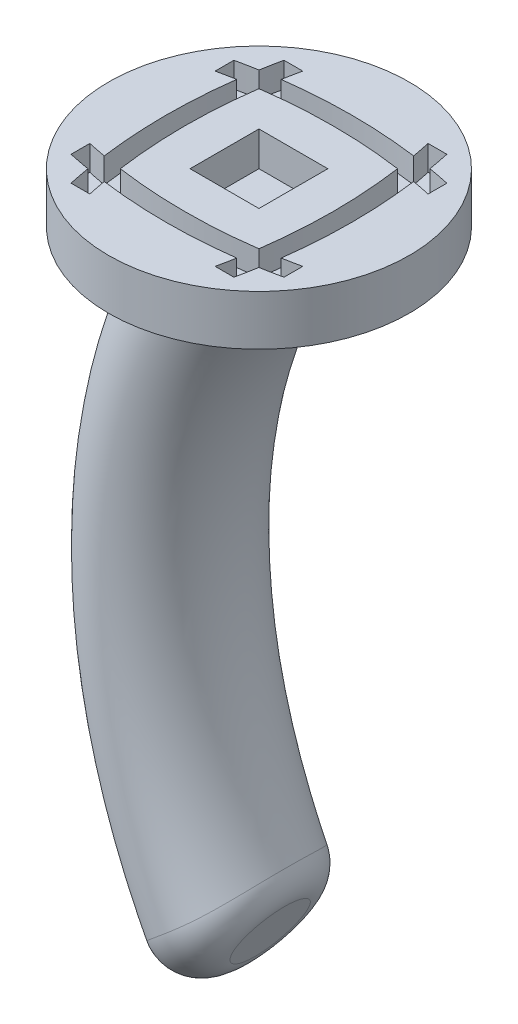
ISO-10303-21;
HEADER;
FILE_DESCRIPTION(('STEP AP214'),'2;1');
FILE_NAME('part.step','',(''),(''),'','','');
FILE_SCHEMA(('AUTOMOTIVE_DESIGN { 1 0 10303 214 1 1 1 1 }'));
ENDSEC;
DATA;
#1=APPLICATION_CONTEXT('core data for automotive mechanical design processes');
#2=APPLICATION_PROTOCOL_DEFINITION('international standard','automotive_design',2000,#1);
#3=PRODUCT_CONTEXT('',#1,'mechanical');
#4=PRODUCT('Part','Part','',(#3));
#5=PRODUCT_RELATED_PRODUCT_CATEGORY('part','',(#4));
#6=PRODUCT_DEFINITION_FORMATION('','',#4);
#7=PRODUCT_DEFINITION_CONTEXT('part definition',#1,'design');
#8=PRODUCT_DEFINITION('design','',#6,#7);
#9=PRODUCT_DEFINITION_SHAPE('','',#8);
#10=(LENGTH_UNIT() NAMED_UNIT(*) SI_UNIT(.MILLI.,.METRE.));
#11=(NAMED_UNIT(*) PLANE_ANGLE_UNIT() SI_UNIT($,.RADIAN.));
#12=(NAMED_UNIT(*) SI_UNIT($,.STERADIAN.) SOLID_ANGLE_UNIT());
#13=UNCERTAINTY_MEASURE_WITH_UNIT(LENGTH_MEASURE(1.E-05),#10,'distance_accuracy_value','');
#14=(GEOMETRIC_REPRESENTATION_CONTEXT(3) GLOBAL_UNCERTAINTY_ASSIGNED_CONTEXT((#13)) GLOBAL_UNIT_ASSIGNED_CONTEXT((#10,
#11,#12)) REPRESENTATION_CONTEXT('',''));
#15=CARTESIAN_POINT('',(0.,0.,0.));
#16=DIRECTION('',(0.,0.,1.));
#17=DIRECTION('',(1.,0.,0.));
#18=AXIS2_PLACEMENT_3D('',#15,#16,#17);
#19=CARTESIAN_POINT('',(0.,8.,0.));
#20=DIRECTION('',(0.,-1.,0.));
#21=DIRECTION('',(0.,0.,-1.));
#22=AXIS2_PLACEMENT_3D('',#19,#20,#21);
#23=CYLINDRICAL_SURFACE('',#22,24.);
#24=CARTESIAN_POINT('',(0.,8.,0.));
#25=DIRECTION('',(0.,1.,0.));
#26=DIRECTION('',(0.,0.,1.));
#27=AXIS2_PLACEMENT_3D('',#24,#25,#26);
#28=CIRCLE('',#27,24.);
#29=CARTESIAN_POINT('',(0.,8.,24.));
#30=VERTEX_POINT('',#29);
#31=EDGE_CURVE('E539',#30,#30,#28,.T.);
#32=ORIENTED_EDGE('',*,*,#31,.F.);
#33=EDGE_LOOP('',(#32));
#34=FACE_BOUND('',#33,.T.);
#35=CARTESIAN_POINT('',(0.,0.,0.));
#36=DIRECTION('',(0.,1.,0.));
#37=DIRECTION('',(0.,0.,1.));
#38=AXIS2_PLACEMENT_3D('',#35,#36,#37);
#39=CIRCLE('',#38,24.);
#40=CARTESIAN_POINT('',(0.,0.,24.));
#41=VERTEX_POINT('',#40);
#42=EDGE_CURVE('E625',#41,#41,#39,.T.);
#43=ORIENTED_EDGE('',*,*,#42,.T.);
#44=EDGE_LOOP('',(#43));
#45=FACE_BOUND('',#44,.T.);
#46=ADVANCED_FACE('F35',(#34,#45),#23,.T.);
#47=CARTESIAN_POINT('',(0.,8.,0.));
#48=DIRECTION('',(0.,1.,0.));
#49=DIRECTION('',(0.,0.,1.));
#50=AXIS2_PLACEMENT_3D('',#47,#48,#49);
#51=PLANE('',#50);
#52=CARTESIAN_POINT('',(0.,8.,65.1728853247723));
#53=DIRECTION('',(0.,1.,0.));
#54=DIRECTION('',(0.,0.,-1.));
#55=AXIS2_PLACEMENT_3D('',#52,#53,#54);
#56=CIRCLE('',#55,80.);
#57=CARTESIAN_POINT('',(-13.6534076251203,8.,-13.6534076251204));
#58=VERTEX_POINT('',#57);
#59=CARTESIAN_POINT('',(-17.,8.,-13.));
#60=VERTEX_POINT('',#59);
#61=EDGE_CURVE('E54',#58,#60,#56,.T.);
#62=ORIENTED_EDGE('',*,*,#61,.F.);
#63=CARTESIAN_POINT('',(65.1728853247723,8.,6.82649738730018E-13));
#64=DIRECTION('',(0.,1.,0.));
#65=DIRECTION('',(0.,0.,-1.));
#66=AXIS2_PLACEMENT_3D('',#63,#64,#65);
#67=CIRCLE('',#66,80.);
#68=CARTESIAN_POINT('',(-12.9999999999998,8.,-17.0000000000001));
#69=VERTEX_POINT('',#68);
#70=EDGE_CURVE('E317',#69,#58,#67,.T.);
#71=ORIENTED_EDGE('',*,*,#70,.F.);
#72=DIRECTION('',(-1.,0.,0.));
#73=VECTOR('',#72,1.);
#74=CARTESIAN_POINT('',(-12.9999999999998,8.,-17.0000000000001));
#75=LINE('',#74,#73);
#76=CARTESIAN_POINT('',(-9.99999999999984,8.,-17.0000000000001));
#77=VERTEX_POINT('',#76);
#78=EDGE_CURVE('E475',#77,#69,#75,.T.);
#79=ORIENTED_EDGE('',*,*,#78,.F.);
#80=CARTESIAN_POINT('',(67.4051839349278,8.,7.06031825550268E-13));
#81=DIRECTION('',(0.,-1.,0.));
#82=DIRECTION('',(0.,0.,-1.));
#83=AXIS2_PLACEMENT_3D('',#80,#81,#82);
#84=CIRCLE('',#83,79.25);
#85=CARTESIAN_POINT('',(-10.5758880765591,8.,-14.1249746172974));
#86=VERTEX_POINT('',#85);
#87=EDGE_CURVE('E472',#86,#77,#84,.T.);
#88=ORIENTED_EDGE('',*,*,#87,.F.);
#89=CARTESIAN_POINT('',(0.,8.,65.1728853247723));
#90=DIRECTION('',(0.,1.,0.));
#91=DIRECTION('',(0.,0.,-1.));
#92=AXIS2_PLACEMENT_3D('',#89,#90,#91);
#93=CIRCLE('',#92,80.);
#94=CARTESIAN_POINT('',(10.5758880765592,8.,-14.1249746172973));
#95=VERTEX_POINT('',#94);
#96=EDGE_CURVE('E469',#95,#86,#93,.T.);
#97=ORIENTED_EDGE('',*,*,#96,.F.);
#98=CARTESIAN_POINT('',(-67.4051839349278,8.,-2.38813388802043E-13));
#99=DIRECTION('',(0.,-1.,0.));
#100=DIRECTION('',(0.,0.,-1.));
#101=AXIS2_PLACEMENT_3D('',#98,#99,#100);
#102=CIRCLE('',#101,79.25);
#103=CARTESIAN_POINT('',(10.0000000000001,8.,-17.));
#104=VERTEX_POINT('',#103);
#105=EDGE_CURVE('E466',#104,#95,#102,.T.);
#106=ORIENTED_EDGE('',*,*,#105,.F.);
#107=DIRECTION('',(-1.,0.,0.));
#108=VECTOR('',#107,1.);
#109=CARTESIAN_POINT('',(13.0000000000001,8.,-17.));
#110=LINE('',#109,#108);
#111=CARTESIAN_POINT('',(13.0000000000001,8.,-17.));
#112=VERTEX_POINT('',#111);
#113=EDGE_CURVE('E463',#112,#104,#110,.T.);
#114=ORIENTED_EDGE('',*,*,#113,.F.);
#115=CARTESIAN_POINT('',(-65.1728853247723,8.,-2.3101935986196E-13));
#116=DIRECTION('',(0.,1.,0.));
#117=DIRECTION('',(0.,0.,-1.));
#118=AXIS2_PLACEMENT_3D('',#115,#116,#117);
#119=CIRCLE('',#118,80.);
#120=CARTESIAN_POINT('',(13.6534076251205,8.,-13.6534076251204));
#121=VERTEX_POINT('',#120);
#122=EDGE_CURVE('E460',#121,#112,#119,.T.);
#123=ORIENTED_EDGE('',*,*,#122,.F.);
#124=CARTESIAN_POINT('',(0.,8.,65.1728853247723));
#125=DIRECTION('',(0.,1.,0.));
#126=DIRECTION('',(0.,0.,-1.));
#127=AXIS2_PLACEMENT_3D('',#124,#125,#126);
#128=CIRCLE('',#127,80.);
#129=CARTESIAN_POINT('',(17.,8.,-13.));
#130=VERTEX_POINT('',#129);
#131=EDGE_CURVE('E457',#130,#121,#128,.T.);
#132=ORIENTED_EDGE('',*,*,#131,.F.);
#133=DIRECTION('',(0.,0.,-1.));
#134=VECTOR('',#133,1.);
#135=CARTESIAN_POINT('',(17.,8.,-13.));
#136=LINE('',#135,#134);
#137=CARTESIAN_POINT('',(17.,8.,-9.99999999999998));
#138=VERTEX_POINT('',#137);
#139=EDGE_CURVE('E454',#138,#130,#136,.T.);
#140=ORIENTED_EDGE('',*,*,#139,.F.);
#141=CARTESIAN_POINT('',(0.,8.,67.4051839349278));
#142=DIRECTION('',(0.,-1.,0.));
#143=DIRECTION('',(0.,0.,-1.));
#144=AXIS2_PLACEMENT_3D('',#141,#142,#143);
#145=CIRCLE('',#144,79.25);
#146=CARTESIAN_POINT('',(14.1249746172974,8.,-10.5758880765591));
#147=VERTEX_POINT('',#146);
#148=EDGE_CURVE('E451',#147,#138,#145,.T.);
#149=ORIENTED_EDGE('',*,*,#148,.F.);
#150=CARTESIAN_POINT('',(-65.1728853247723,8.,-2.3101935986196E-13));
#151=DIRECTION('',(0.,1.,0.));
#152=DIRECTION('',(0.,0.,-1.));
#153=AXIS2_PLACEMENT_3D('',#150,#151,#152);
#154=CIRCLE('',#153,80.);
#155=CARTESIAN_POINT('',(14.1249746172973,8.,10.5758880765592));
#156=VERTEX_POINT('',#155);
#157=EDGE_CURVE('E448',#156,#147,#154,.T.);
#158=ORIENTED_EDGE('',*,*,#157,.F.);
#159=CARTESIAN_POINT('',(4.70687883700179E-13,8.,-67.4051839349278));
#160=DIRECTION('',(0.,-1.,0.));
#161=DIRECTION('',(0.,0.,-1.));
#162=AXIS2_PLACEMENT_3D('',#159,#160,#161);
#163=CIRCLE('',#162,79.25);
#164=CARTESIAN_POINT('',(16.9999999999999,8.,10.0000000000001));
#165=VERTEX_POINT('',#164);
#166=EDGE_CURVE('E445',#165,#156,#163,.T.);
#167=ORIENTED_EDGE('',*,*,#166,.F.);
#168=DIRECTION('',(0.,0.,-1.));
#169=VECTOR('',#168,1.);
#170=CARTESIAN_POINT('',(16.9999999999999,8.,13.0000000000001));
#171=LINE('',#170,#169);
#172=CARTESIAN_POINT('',(16.9999999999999,8.,13.0000000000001));
#173=VERTEX_POINT('',#172);
#174=EDGE_CURVE('E442',#173,#165,#171,.T.);
#175=ORIENTED_EDGE('',*,*,#174,.F.);
#176=CARTESIAN_POINT('',(4.55099825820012E-13,8.,-65.1728853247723));
#177=DIRECTION('',(0.,1.,0.));
#178=DIRECTION('',(0.,0.,-1.));
#179=AXIS2_PLACEMENT_3D('',#176,#177,#178);
#180=CIRCLE('',#179,80.);
#181=CARTESIAN_POINT('',(13.6534076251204,8.,13.6534076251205));
#182=VERTEX_POINT('',#181);
#183=EDGE_CURVE('E439',#182,#173,#180,.T.);
#184=ORIENTED_EDGE('',*,*,#183,.F.);
#185=CARTESIAN_POINT('',(-65.1728853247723,8.,-2.3101935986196E-13));
#186=DIRECTION('',(0.,1.,0.));
#187=DIRECTION('',(0.,0.,-1.));
#188=AXIS2_PLACEMENT_3D('',#185,#186,#187);
#189=CIRCLE('',#188,80.);
#190=CARTESIAN_POINT('',(12.9999999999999,8.,17.));
#191=VERTEX_POINT('',#190);
#192=EDGE_CURVE('E436',#191,#182,#189,.T.);
#193=ORIENTED_EDGE('',*,*,#192,.F.);
#194=DIRECTION('',(1.,0.,0.));
#195=VECTOR('',#194,1.);
#196=CARTESIAN_POINT('',(12.9999999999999,8.,17.));
#197=LINE('',#196,#195);
#198=CARTESIAN_POINT('',(9.99999999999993,8.,17.));
#199=VERTEX_POINT('',#198);
#200=EDGE_CURVE('E433',#199,#191,#197,.T.);
#201=ORIENTED_EDGE('',*,*,#200,.F.);
#202=CARTESIAN_POINT('',(-67.4051839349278,8.,-2.38813388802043E-13));
#203=DIRECTION('',(0.,-1.,0.));
#204=DIRECTION('',(0.,0.,-1.));
#205=AXIS2_PLACEMENT_3D('',#202,#203,#204);
#206=CIRCLE('',#205,79.25);
#207=CARTESIAN_POINT('',(10.575888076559,8.,14.1249746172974));
#208=VERTEX_POINT('',#207);
#209=EDGE_CURVE('E430',#208,#199,#206,.T.);
#210=ORIENTED_EDGE('',*,*,#209,.F.);
#211=CARTESIAN_POINT('',(4.55099825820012E-13,8.,-65.1728853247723));
#212=DIRECTION('',(0.,1.,0.));
#213=DIRECTION('',(0.,0.,-1.));
#214=AXIS2_PLACEMENT_3D('',#211,#212,#213);
#215=CIRCLE('',#214,80.);
#216=CARTESIAN_POINT('',(-10.5758880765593,8.,14.1249746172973));
#217=VERTEX_POINT('',#216);
#218=EDGE_CURVE('E427',#217,#208,#215,.T.);
#219=ORIENTED_EDGE('',*,*,#218,.F.);
#220=CARTESIAN_POINT('',(67.4051839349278,8.,7.06031825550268E-13));
#221=DIRECTION('',(0.,-1.,0.));
#222=DIRECTION('',(0.,0.,-1.));
#223=AXIS2_PLACEMENT_3D('',#220,#221,#222);
#224=CIRCLE('',#223,79.25);
#225=CARTESIAN_POINT('',(-10.0000000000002,8.,16.9999999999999));
#226=VERTEX_POINT('',#225);
#227=EDGE_CURVE('E424',#226,#217,#224,.T.);
#228=ORIENTED_EDGE('',*,*,#227,.F.);
#229=DIRECTION('',(1.,0.,0.));
#230=VECTOR('',#229,1.);
#231=CARTESIAN_POINT('',(-13.0000000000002,8.,16.9999999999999));
#232=LINE('',#231,#230);
#233=CARTESIAN_POINT('',(-13.0000000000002,8.,16.9999999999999));
#234=VERTEX_POINT('',#233);
#235=EDGE_CURVE('E421',#234,#226,#232,.T.);
#236=ORIENTED_EDGE('',*,*,#235,.F.);
#237=CARTESIAN_POINT('',(65.1728853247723,8.,6.82649738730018E-13));
#238=DIRECTION('',(0.,1.,0.));
#239=DIRECTION('',(0.,0.,-1.));
#240=AXIS2_PLACEMENT_3D('',#237,#238,#239);
#241=CIRCLE('',#240,80.);
#242=CARTESIAN_POINT('',(-13.6534076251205,8.,13.6534076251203));
#243=VERTEX_POINT('',#242);
#244=EDGE_CURVE('E418',#243,#234,#241,.T.);
#245=ORIENTED_EDGE('',*,*,#244,.F.);
#246=CARTESIAN_POINT('',(4.55099825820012E-13,8.,-65.1728853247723));
#247=DIRECTION('',(0.,1.,0.));
#248=DIRECTION('',(0.,0.,-1.));
#249=AXIS2_PLACEMENT_3D('',#246,#247,#248);
#250=CIRCLE('',#249,80.);
#251=CARTESIAN_POINT('',(-17.0000000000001,8.,12.9999999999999));
#252=VERTEX_POINT('',#251);
#253=EDGE_CURVE('E415',#252,#243,#250,.T.);
#254=ORIENTED_EDGE('',*,*,#253,.F.);
#255=DIRECTION('',(0.,0.,1.));
#256=VECTOR('',#255,1.);
#257=CARTESIAN_POINT('',(-17.0000000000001,8.,12.9999999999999));
#258=LINE('',#257,#256);
#259=CARTESIAN_POINT('',(-17.,8.,9.99999999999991));
#260=VERTEX_POINT('',#259);
#261=EDGE_CURVE('E412',#260,#252,#258,.T.);
#262=ORIENTED_EDGE('',*,*,#261,.F.);
#263=CARTESIAN_POINT('',(4.70687883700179E-13,8.,-67.4051839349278));
#264=DIRECTION('',(0.,-1.,0.));
#265=DIRECTION('',(0.,0.,-1.));
#266=AXIS2_PLACEMENT_3D('',#263,#264,#265);
#267=CIRCLE('',#266,79.25);
#268=CARTESIAN_POINT('',(-14.1249746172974,8.,10.5758880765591));
#269=VERTEX_POINT('',#268);
#270=EDGE_CURVE('E409',#269,#260,#267,.T.);
#271=ORIENTED_EDGE('',*,*,#270,.F.);
#272=CARTESIAN_POINT('',(65.1728853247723,8.,6.82649738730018E-13));
#273=DIRECTION('',(0.,1.,0.));
#274=DIRECTION('',(0.,0.,-1.));
#275=AXIS2_PLACEMENT_3D('',#272,#273,#274);
#276=CIRCLE('',#275,80.);
#277=CARTESIAN_POINT('',(-14.1249746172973,8.,-10.5758880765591));
#278=VERTEX_POINT('',#277);
#279=EDGE_CURVE('E406',#278,#269,#276,.T.);
#280=ORIENTED_EDGE('',*,*,#279,.F.);
#281=CARTESIAN_POINT('',(0.,8.,67.4051839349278));
#282=DIRECTION('',(0.,-1.,0.));
#283=DIRECTION('',(0.,0.,-1.));
#284=AXIS2_PLACEMENT_3D('',#281,#282,#283);
#285=CIRCLE('',#284,79.25);
#286=CARTESIAN_POINT('',(-17.,8.,-10.));
#287=VERTEX_POINT('',#286);
#288=EDGE_CURVE('E403',#287,#278,#285,.T.);
#289=ORIENTED_EDGE('',*,*,#288,.F.);
#290=DIRECTION('',(0.,0.,1.));
#291=VECTOR('',#290,1.);
#292=CARTESIAN_POINT('',(-17.,8.,-13.));
#293=LINE('',#292,#291);
#294=EDGE_CURVE('E400',#60,#287,#293,.T.);
#295=ORIENTED_EDGE('',*,*,#294,.F.);
#296=EDGE_LOOP('',(#62,#71,#79,#88,#97,#106,#114,#123,#132,#140,#149,#158,#167,#175,#184,#193,
#201,#210,#219,#228,#236,#245,#254,#262,#271,#280,#289,#295));
#297=FACE_BOUND('',#296,.T.);
#298=ORIENTED_EDGE('',*,*,#31,.T.);
#299=EDGE_LOOP('',(#298));
#300=FACE_BOUND('',#299,.T.);
#301=ADVANCED_FACE('F574',(#297,#300),#51,.T.);
#302=CARTESIAN_POINT('',(0.,0.,0.));
#303=DIRECTION('',(0.,1.,0.));
#304=DIRECTION('',(0.,0.,1.));
#305=AXIS2_PLACEMENT_3D('',#302,#303,#304);
#306=PLANE('',#305);
#307=CARTESIAN_POINT('',(0.,0.,0.));
#308=DIRECTION('',(0.,-1.,0.));
#309=DIRECTION('',(0.,0.,-1.));
#310=AXIS2_PLACEMENT_3D('',#307,#308,#309);
#311=CIRCLE('',#310,12.);
#312=CARTESIAN_POINT('',(0.,0.,-12.));
#313=VERTEX_POINT('',#312);
#314=EDGE_CURVE('E536',#313,#313,#311,.T.);
#315=ORIENTED_EDGE('',*,*,#314,.F.);
#316=EDGE_LOOP('',(#315));
#317=FACE_BOUND('',#316,.T.);
#318=ORIENTED_EDGE('',*,*,#42,.F.);
#319=EDGE_LOOP('',(#318));
#320=FACE_BOUND('',#319,.T.);
#321=ADVANCED_FACE('F550',(#317,#320),#306,.F.);
#322=CARTESIAN_POINT('',(0.,-100.,0.));
#323=DIRECTION('',(0.891093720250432,-0.453819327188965,0.));
#324=DIRECTION('',(0.,0.,-1.));
#325=AXIS2_PLACEMENT_3D('',#322,#323,#324);
#326=CIRCLE('',#325,12.);
#327=CARTESIAN_POINT('',(81.5749956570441,-50.,0.));
#328=DIRECTION('',(0.,0.,-1.));
#329=AXIS1_PLACEMENT('',#327,#328);
#330=SURFACE_OF_REVOLUTION('',#326,#329);
#331=CARTESIAN_POINT('',(3.43602904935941,-93.2532095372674,-4.14432950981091));
#332=CARTESIAN_POINT('',(3.99931050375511,-92.1471822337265,-5.14287693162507));
#333=CARTESIAN_POINT('',(3.78427376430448,-90.828212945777,-6.00991704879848));
#334=CARTESIAN_POINT('',(3.56923702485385,-89.5092436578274,-6.8769571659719));
#335=CARTESIAN_POINT('',(2.63252216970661,-88.324745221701,-7.38411402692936));
#336=CARTESIAN_POINT('',(3.39418464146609,-93.3353728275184,-4.25894178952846));
#337=CARTESIAN_POINT('',(3.9514148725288,-92.2412273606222,-5.29800743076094));
#338=CARTESIAN_POINT('',(3.71748615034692,-90.9287201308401,-6.19773611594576));
#339=CARTESIAN_POINT('',(3.48347501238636,-89.6163369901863,-7.09769743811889));
#340=CARTESIAN_POINT('',(2.52097261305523,-88.4373833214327,-7.61721102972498));
#341=CARTESIAN_POINT('',(3.35039402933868,-93.4213575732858,-4.370088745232));
#342=CARTESIAN_POINT('',(3.90095590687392,-92.3403057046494,-5.45085426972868));
#343=CARTESIAN_POINT('',(3.64638672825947,-91.0349723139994,-6.38396469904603));
#344=CARTESIAN_POINT('',(3.39170499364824,-89.7298057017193,-7.31734938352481));
#345=CARTESIAN_POINT('',(2.40136186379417,-88.5568132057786,-7.84832480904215));
#346=CARTESIAN_POINT('',(3.2590116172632,-93.600790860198,-4.58452899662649));
#347=CARTESIAN_POINT('',(3.7946411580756,-92.5490592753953,-5.75161755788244));
#348=CARTESIAN_POINT('',(3.494577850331,-91.2597806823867,-6.75279694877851));
#349=CARTESIAN_POINT('',(3.19440100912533,-89.9706701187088,-7.75425138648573));
#350=CARTESIAN_POINT('',(2.14375042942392,-88.810374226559,-8.30535558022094));
#351=CARTESIAN_POINT('',(3.21142018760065,-93.6942386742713,-4.68782305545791));
#352=CARTESIAN_POINT('',(3.73876344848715,-92.6587775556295,-5.89956788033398));
#353=CARTESIAN_POINT('',(3.41386933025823,-91.3783356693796,-6.93540096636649));
#354=CARTESIAN_POINT('',(3.08882112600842,-90.0981178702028,-7.9715572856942));
#355=CARTESIAN_POINT('',(2.00575153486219,-88.9445039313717,-8.53127307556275));
#356=CARTESIAN_POINT('',(3.11260718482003,-93.8882622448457,-4.88542587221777));
#357=CARTESIAN_POINT('',(3.6213463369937,-92.8893310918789,-6.18979003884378));
#358=CARTESIAN_POINT('',(3.24167728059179,-91.6286746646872,-7.29614520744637));
#359=CARTESIAN_POINT('',(2.86185363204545,-90.3682429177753,-8.40282382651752));
#360=CARTESIAN_POINT('',(1.70877492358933,-89.2286649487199,-8.9758081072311));
#361=CARTESIAN_POINT('',(3.06138876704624,-93.988831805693,-4.97974227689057));
#362=CARTESIAN_POINT('',(3.55978212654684,-93.0102150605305,-6.33210482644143));
#363=CARTESIAN_POINT('',(3.15020307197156,-91.7604472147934,-7.47428913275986));
#364=CARTESIAN_POINT('',(2.74041352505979,-90.5109793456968,-8.61685304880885));
#365=CARTESIAN_POINT('',(1.54981534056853,-89.3786824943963,-9.1944317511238));
#366=CARTESIAN_POINT('',(2.95545798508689,-94.1968314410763,-5.15832470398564));
#367=CARTESIAN_POINT('',(3.43053634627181,-93.2639946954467,-6.61038840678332));
#368=CARTESIAN_POINT('',(2.95487186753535,-92.0386303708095,-7.82521451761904));
#369=CARTESIAN_POINT('',(2.47899504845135,-90.8135682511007,-9.04042066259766));
#370=CARTESIAN_POINT('',(1.20765433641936,-89.6962456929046,-9.62164664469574));
#371=CARTESIAN_POINT('',(2.90074614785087,-94.3042604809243,-5.24259223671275));
#372=CARTESIAN_POINT('',(3.36281617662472,-93.3969661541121,-6.74640091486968));
#373=CARTESIAN_POINT('',(2.85101673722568,-92.1850387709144,-7.99799678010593));
#374=CARTESIAN_POINT('',(2.33892616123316,-90.9735167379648,-9.25003602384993));
#375=CARTESIAN_POINT('',(1.02445656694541,-89.8637887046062,-9.83023939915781));
#376=CARTESIAN_POINT('',(2.79773095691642,-94.5065352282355,-5.38631579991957));
#377=CARTESIAN_POINT('',(3.23295909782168,-93.6519460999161,-6.98818341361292));
#378=CARTESIAN_POINT('',(2.64814281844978,-92.467583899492,-8.30738379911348));
#379=CARTESIAN_POINT('',(2.06312726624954,-91.2834993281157,-9.62688858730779));
#380=CARTESIAN_POINT('',(0.664336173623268,-90.1875689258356,-10.1982864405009));
#381=CARTESIAN_POINT('',(2.74993732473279,-94.6003800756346,-5.44754864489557));
#382=CARTESIAN_POINT('',(3.1717988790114,-93.7720368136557,-7.09521375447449));
#383=CARTESIAN_POINT('',(2.55134815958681,-92.6011773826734,-8.44511187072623));
#384=CARTESIAN_POINT('',(1.93063807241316,-91.4306724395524,-9.7953519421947));
#385=CARTESIAN_POINT('',(0.491723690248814,-90.3408188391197,-10.3600335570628));
#386=CARTESIAN_POINT('',(2.65229387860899,-94.792107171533,-5.56146501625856));
#387=CARTESIAN_POINT('',(3.04459623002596,-94.0218046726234,-7.3031545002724));
#388=CARTESIAN_POINT('',(2.3469637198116,-92.8804782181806,-8.71401309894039));
#389=CARTESIAN_POINT('',(1.64907085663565,-91.73950749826,-10.1252135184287));
#390=CARTESIAN_POINT('',(0.126124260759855,-90.6610699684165,-10.6697148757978));
#391=CARTESIAN_POINT('',(2.60244429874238,-94.8899889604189,-5.61414951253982));
#392=CARTESIAN_POINT('',(2.97851710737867,-94.1515538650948,-7.40409054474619));
#393=CARTESIAN_POINT('',(2.23937516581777,-93.0261841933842,-8.8451869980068));
#394=CARTESIAN_POINT('',(1.4998975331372,-91.9012649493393,-10.2866588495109));
#395=CARTESIAN_POINT('',(-0.06686036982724,-90.8280696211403,-10.8176506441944));
#396=CARTESIAN_POINT('',(2.50097833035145,-95.0892217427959,-5.71013460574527));
#397=CARTESIAN_POINT('',(2.84127834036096,-94.4210280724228,-7.59829837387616));
#398=CARTESIAN_POINT('',(2.01275025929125,-93.3303224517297,-9.09835973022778));
#399=CARTESIAN_POINT('',(1.18388714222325,-92.2400665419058,-10.5987949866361));
#400=CARTESIAN_POINT('',(-0.473370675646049,-91.1756800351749,-11.0945425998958));
#401=CARTESIAN_POINT('',(2.44936398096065,-95.1905687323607,-5.75344563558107));
#402=CARTESIAN_POINT('',(2.77007968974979,-94.5608296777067,-7.69159796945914));
#403=CARTESIAN_POINT('',(1.89372684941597,-93.4887403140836,-9.22036866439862));
#404=CARTESIAN_POINT('',(1.01694925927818,-92.4172120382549,-10.7495333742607));
#405=CARTESIAN_POINT('',(-0.686873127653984,-91.3562753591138,-11.2235198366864));
#406=CARTESIAN_POINT('',(2.34461935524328,-95.3962392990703,-5.83003223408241));
#407=CARTESIAN_POINT('',(2.62245986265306,-94.8506875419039,-7.86859975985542));
#408=CARTESIAN_POINT('',(1.64410369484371,-93.8186075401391,-9.4518605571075));
#409=CARTESIAN_POINT('',(0.665323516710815,-92.7870880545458,-11.0355144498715));
#410=CARTESIAN_POINT('',(-1.1328078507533,-91.7300955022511,-11.4566512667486));
#411=CARTESIAN_POINT('',(2.29148910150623,-95.5005628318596,-5.86330795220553));
#412=CARTESIAN_POINT('',(2.54598917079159,-95.0008410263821,-7.95230744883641));
#413=CARTESIAN_POINT('',(1.51350412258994,-93.9900567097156,-9.56134370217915));
#414=CARTESIAN_POINT('',(0.480499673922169,-92.9799511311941,-11.1707660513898));
#415=CARTESIAN_POINT('',(-1.36523983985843,-91.9233201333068,-11.5608058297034));
#416=CARTESIAN_POINT('',(2.18386517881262,-95.7118870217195,-5.91937139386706));
#417=CARTESIAN_POINT('',(2.38781392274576,-95.3114249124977,-8.10779798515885));
#418=CARTESIAN_POINT('',(1.24144259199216,-94.3457304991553,-9.76386289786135));
#419=CARTESIAN_POINT('',(0.0945490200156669,-93.3807191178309,-11.4203171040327));
#420=CARTESIAN_POINT('',(-1.84510799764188,-92.3203606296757,-11.7386470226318));
#421=CARTESIAN_POINT('',(2.12936677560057,-95.818896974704,-5.94211512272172));
#422=CARTESIAN_POINT('',(2.30604138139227,-95.4719888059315,-8.17951067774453));
#423=CARTESIAN_POINT('',(1.09993789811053,-94.5300050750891,-9.85682897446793));
#424=CARTESIAN_POINT('',(-0.106772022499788,-93.5888105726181,-11.5344894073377));
#425=CARTESIAN_POINT('',(-2.09260230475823,-92.524217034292,-11.8122057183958));
#426=CARTESIAN_POINT('',(2.01965776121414,-96.0343153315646,-5.97660503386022));
#427=CARTESIAN_POINT('',(2.13841104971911,-95.8011381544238,-8.30772528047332));
#428=CARTESIAN_POINT('',(0.809389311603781,-94.9081967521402,-10.021394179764));
#429=CARTESIAN_POINT('',(-0.520238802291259,-94.0160447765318,-11.7354078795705));
#430=CARTESIAN_POINT('',(-2.59376065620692,-92.9372129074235,-11.9240433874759));
#431=CARTESIAN_POINT('',(1.96444714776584,-96.1427237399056,-5.98835118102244));
#432=CARTESIAN_POINT('',(2.05251504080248,-95.9697986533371,-8.36417950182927));
#433=CARTESIAN_POINT('',(0.660345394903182,-95.1021138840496,-10.0929932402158));
#434=CARTESIAN_POINT('',(-0.732481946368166,-94.2352876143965,-11.8220642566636));
#435=CARTESIAN_POINT('',(-2.8474247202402,-93.1463523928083,-11.9623222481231));
#436=CARTESIAN_POINT('',(1.85374292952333,-96.3600962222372,-6.00087433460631));
#437=CARTESIAN_POINT('',(1.87789582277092,-96.3126709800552,-8.45961099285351));
#438=CARTESIAN_POINT('',(0.358477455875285,-95.4960808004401,-10.2117869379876));
#439=CARTESIAN_POINT('',(-1.16160240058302,-94.6803537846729,-11.9642247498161));
#440=CARTESIAN_POINT('',(-3.3521165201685,-93.5648174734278,-12.0028898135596));
#441=CARTESIAN_POINT('',(1.79824918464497,-96.4690605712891,-6.00164524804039));
#442=CARTESIAN_POINT('',(1.78915176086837,-96.4869237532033,-8.49850550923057));
#443=CARTESIAN_POINT('',(0.205651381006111,-95.6961339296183,-10.2589680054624));
#444=CARTESIAN_POINT('',(-1.37851950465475,-94.9062271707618,-12.0195802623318));
#445=CARTESIAN_POINT('',(-3.60314271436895,-93.7741431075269,-12.005158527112));
#446=CARTESIAN_POINT('',(1.68744604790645,-96.6866272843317,-5.99252396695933));
#447=CARTESIAN_POINT('',(1.61032045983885,-96.8380666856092,-8.5576053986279));
#448=CARTESIAN_POINT('',(-0.0999433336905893,-96.0984682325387,-10.3278066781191));
#449=CARTESIAN_POINT('',(-1.81088269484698,-95.3597589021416,-12.0981614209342));
#450=CARTESIAN_POINT('',(-4.09506334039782,-94.1883930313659,-11.9763077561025));
#451=CARTESIAN_POINT('',(1.63213665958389,-96.7952296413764,-5.98263156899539));
#452=CARTESIAN_POINT('',(1.52023400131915,-97.0149553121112,-8.57772549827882));
#453=CARTESIAN_POINT('',(-0.252711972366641,-96.3007494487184,-10.3494637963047));
#454=CARTESIAN_POINT('',(-2.02630592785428,-95.5874080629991,-12.121241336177));
#455=CARTESIAN_POINT('',(-4.33595757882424,-94.3933172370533,-11.9451876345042));
#456=CARTESIAN_POINT('',(1.52508727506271,-97.005425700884,-5.95351731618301));
#457=CARTESIAN_POINT('',(1.34492205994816,-97.3591878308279,-8.59865619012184));
#458=CARTESIAN_POINT('',(-0.547078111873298,-96.693360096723,-10.367453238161));
#459=CARTESIAN_POINT('',(-2.43966277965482,-96.028311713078,-12.1362863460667));
#460=CARTESIAN_POINT('',(-4.79044704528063,-94.7848235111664,-11.8565652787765));
#461=CARTESIAN_POINT('',(1.47331675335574,-97.1070793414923,-5.93483212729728));
#462=CARTESIAN_POINT('',(1.25969391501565,-97.5265369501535,-8.60038762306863));
#463=CARTESIAN_POINT('',(-0.688831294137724,-96.8837412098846,-10.3650988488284));
#464=CARTESIAN_POINT('',(-2.63789895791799,-96.2416795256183,-12.129760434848));
#465=CARTESIAN_POINT('',(-5.00481443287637,-94.9717969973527,-11.8005899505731));
#466=CARTESIAN_POINT('',(1.37057027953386,-97.3088264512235,-5.88890564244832));
#467=CARTESIAN_POINT('',(1.09002577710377,-97.8596876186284,-8.58770805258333));
#468=CARTESIAN_POINT('',(-0.968140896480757,-97.2616591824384,-10.339621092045));
#469=CARTESIAN_POINT('',(-3.02685309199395,-96.6643687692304,-12.0914845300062));
#470=CARTESIAN_POINT('',(-5.41891813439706,-95.3377741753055,-11.6669325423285));
#471=CARTESIAN_POINT('',(1.31959428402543,-97.4089200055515,-5.86166481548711));
#472=CARTESIAN_POINT('',(1.00560781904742,-98.0254459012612,-8.57323623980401));
#473=CARTESIAN_POINT('',(-1.10569754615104,-97.4491961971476,-10.3164988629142));
#474=CARTESIAN_POINT('',(-3.21749851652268,-96.8736272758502,-12.0596415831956));
#475=CARTESIAN_POINT('',(-5.61865524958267,-95.5167783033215,-11.5892516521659));
#476=CARTESIAN_POINT('',(1.21866035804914,-97.6071080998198,-5.79914610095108));
#477=CARTESIAN_POINT('',(0.838166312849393,-98.3542244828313,-8.52903958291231));
#478=CARTESIAN_POINT('',(-1.37574141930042,-97.8201091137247,-10.2511821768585));
#479=CARTESIAN_POINT('',(-3.590147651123,-97.28667839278,-11.9732042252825));
#480=CARTESIAN_POINT('',(-6.00335065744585,-95.8662796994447,-11.4158309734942));
#481=CARTESIAN_POINT('',(1.16870264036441,-97.7052022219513,-5.7638665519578));
#482=CARTESIAN_POINT('',(0.755169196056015,-98.5171928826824,-8.49926074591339));
#483=CARTESIAN_POINT('',(-1.50822758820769,-98.00348414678,-10.2089837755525));
#484=CARTESIAN_POINT('',(-3.77207092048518,-97.4903978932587,-11.9185318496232));
#485=CARTESIAN_POINT('',(-6.1883058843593,-96.0367752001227,-11.3200874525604));
#486=CARTESIAN_POINT('',(1.07001433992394,-97.8989809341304,-5.68578089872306));
#487=CARTESIAN_POINT('',(0.591044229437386,-98.8394592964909,-8.42543229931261));
#488=CARTESIAN_POINT('',(-1.76764277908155,-98.3651204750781,-10.1072021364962));
#489=CARTESIAN_POINT('',(-4.12677825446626,-97.8914068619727,-11.788795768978));
#490=CARTESIAN_POINT('',(-6.54397235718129,-96.3691044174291,-11.1135683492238));
#491=CARTESIAN_POINT('',(1.02128385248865,-97.9946653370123,-5.64297421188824));
#492=CARTESIAN_POINT('',(0.509943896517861,-98.9987032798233,-8.38134157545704));
#493=CARTESIAN_POINT('',(-1.89457136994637,-98.5433813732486,-10.0476175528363));
#494=CARTESIAN_POINT('',(-4.29948479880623,-98.0886225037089,-11.7136764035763));
#495=CARTESIAN_POINT('',(-6.71468249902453,-96.5309374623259,-11.002791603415));
#496=CARTESIAN_POINT('',(0.917662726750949,-98.1981298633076,-5.54301636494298));
#497=CARTESIAN_POINT('',(0.337325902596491,-99.3376461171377,-8.27183456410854));
#498=CARTESIAN_POINT('',(-2.16218804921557,-98.9217557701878,-9.90197481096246));
#499=CARTESIAN_POINT('',(-4.66223775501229,-98.506622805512,-11.5318239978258));
#500=CARTESIAN_POINT('',(-7.06857859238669,-96.8708410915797,-10.750168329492));
#501=CARTESIAN_POINT('',(0.863009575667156,-98.3054436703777,-5.48466792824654));
#502=CARTESIAN_POINT('',(0.246267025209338,-99.516444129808,-8.20414248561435));
#503=CARTESIAN_POINT('',(-2.3018978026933,-99.1208932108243,-9.81322606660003));
#504=CARTESIAN_POINT('',(-4.8505261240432,-98.7260075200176,-11.4219745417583));
#505=CARTESIAN_POINT('',(-7.24949979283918,-97.0474588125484,-10.6061758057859));
#506=CARTESIAN_POINT('',(0.755816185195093,-98.5159224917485,-5.35921253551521));
#507=CARTESIAN_POINT('',(0.0675406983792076,-99.8673809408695,-8.0523185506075));
#508=CARTESIAN_POINT('',(-2.57348091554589,-99.5107322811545,-9.61658528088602));
#509=CARTESIAN_POINT('',(-5.21496772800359,-99.1547514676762,-11.1805146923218));
#510=CARTESIAN_POINT('',(-7.5949796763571,-97.3895096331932,-10.3041159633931));
#511=CARTESIAN_POINT('',(0.703276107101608,-98.6190871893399,-5.29210491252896));
#512=CARTESIAN_POINT('',(-0.0200866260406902,-100.039440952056,-7.96815300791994));
#513=CARTESIAN_POINT('',(-2.70535367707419,-99.7014332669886,-9.50869178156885));
#514=CARTESIAN_POINT('',(-5.39102083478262,-99.364007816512,-11.0488661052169));
#515=CARTESIAN_POINT('',(-7.75953711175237,-97.5549418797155,-10.1460475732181));
#516=CARTESIAN_POINT('',(0.600500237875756,-98.820892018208,-5.14973831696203));
#517=CARTESIAN_POINT('',(-0.191630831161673,-100.37627535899,-7.78459284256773));
#518=CARTESIAN_POINT('',(-2.96129668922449,-100.073899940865,-9.27549318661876));
#519=CARTESIAN_POINT('',(-5.7313640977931,-99.7721089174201,-10.7660275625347));
#520=CARTESIAN_POINT('',(-8.07377066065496,-97.8749816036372,-9.81791874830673));
#521=CARTESIAN_POINT('',(0.55026520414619,-98.9195306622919,-5.07447669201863));
#522=CARTESIAN_POINT('',(-0.27550935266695,-100.54097443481,-7.68517264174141));
#523=CARTESIAN_POINT('',(-3.08536438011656,-100.255662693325,-9.15018242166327));
#524=CARTESIAN_POINT('',(-5.89556287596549,-99.9708569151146,-10.6148118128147));
#525=CARTESIAN_POINT('',(-8.22344190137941,-98.029585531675,-9.64785441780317));
#526=CARTESIAN_POINT('',(0.452302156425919,-99.1118853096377,-4.91640437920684));
#527=CARTESIAN_POINT('',(-0.439225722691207,-100.862438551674,-7.47224159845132));
#528=CARTESIAN_POINT('',(-3.32567206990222,-100.609712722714,-8.88369547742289));
#529=CARTESIAN_POINT('',(-6.21246271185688,-100.357494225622,-10.2947670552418));
#530=CARTESIAN_POINT('',(-8.50910041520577,-98.328182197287,-9.29741535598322));
#531=CARTESIAN_POINT('',(0.404574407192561,-99.2056007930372,-4.83359289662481));
#532=CARTESIAN_POINT('',(-0.519028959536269,-101.019135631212,-7.3587181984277));
#533=CARTESIAN_POINT('',(-3.44191124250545,-100.781998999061,-8.74251762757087));
#534=CARTESIAN_POINT('',(-6.36508583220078,-100.545297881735,-10.1259297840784));
#535=CARTESIAN_POINT('',(-8.64508624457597,-98.4721738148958,-9.11703954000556));
#536=CARTESIAN_POINT('',(0.304162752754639,-99.4027633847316,-4.6467616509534));
#537=CARTESIAN_POINT('',(-0.687130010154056,-101.349209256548,-7.09878353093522));
#538=CARTESIAN_POINT('',(-3.6850538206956,-101.14418582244,-8.42118965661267));
#539=CARTESIAN_POINT('',(-6.68337585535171,-100.939755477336,-9.74307063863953));
#540=CARTESIAN_POINT('',(-8.92577394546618,-98.7725913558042,-8.71683655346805));
#541=CARTESIAN_POINT('',(0.251955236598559,-99.5052750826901,-4.54149411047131));
#542=CARTESIAN_POINT('',(-0.774577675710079,-101.520916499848,-6.95009442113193));
#543=CARTESIAN_POINT('',(-3.81056564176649,-101.332321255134,-8.23844901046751));
#544=CARTESIAN_POINT('',(-6.84688012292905,-101.144217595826,-9.52628590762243));
#545=CARTESIAN_POINT('',(-9.06822928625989,-98.9271657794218,-8.4954009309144));
#546=CARTESIAN_POINT('',(0.151432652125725,-99.7026554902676,-4.3223298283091));
#547=CARTESIAN_POINT('',(-0.943182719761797,-101.851979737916,-6.6365484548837));
#548=CARTESIAN_POINT('',(-4.05091346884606,-101.694402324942,-7.85519440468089));
#549=CARTESIAN_POINT('',(-7.1589700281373,-101.537316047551,-9.07331785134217));
#550=CARTESIAN_POINT('',(-9.33733165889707,-99.2223746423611,-8.04199794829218));
#551=CARTESIAN_POINT('',(0.103117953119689,-99.797523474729,-4.20843226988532));
#552=CARTESIAN_POINT('',(-1.02429495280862,-102.011247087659,-6.47169706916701));
#553=CARTESIAN_POINT('',(-4.16574846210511,-101.868346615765,-7.65467876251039));
#554=CARTESIAN_POINT('',(-7.30746287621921,-101.725843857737,-8.83715357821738));
#555=CARTESIAN_POINT('',(-9.46397719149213,-99.3630077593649,-7.81002959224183));
#556=CARTESIAN_POINT('',(-0.0356668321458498,-100.070033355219,-3.85490668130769));
#557=CARTESIAN_POINT('',(-1.25792324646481,-102.469986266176,-5.95429100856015));
#558=CARTESIAN_POINT('',(-4.49418212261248,-102.367970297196,-7.02889978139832));
#559=CARTESIAN_POINT('',(-7.73150495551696,-102.267571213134,-8.10150094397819));
#560=CARTESIAN_POINT('',(-9.82191912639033,-99.7642574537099,-7.10020139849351));
#561=CARTESIAN_POINT('',(-0.120013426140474,-100.235651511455,-3.60337863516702));
#562=CARTESIAN_POINT('',(-1.39999354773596,-102.748947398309,-5.58014026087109));
#563=CARTESIAN_POINT('',(-4.69179554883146,-102.67156947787,-6.57928849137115));
#564=CARTESIAN_POINT('',(-7.98424695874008,-102.595193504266,-7.57668365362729));
#565=CARTESIAN_POINT('',(-10.031318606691,-100.004330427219,-6.60827507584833));
#566=CARTESIAN_POINT('',(-0.277424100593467,-100.544734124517,-3.05127365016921));
#567=CARTESIAN_POINT('',(-1.66608245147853,-103.271424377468,-4.74767493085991));
#568=CARTESIAN_POINT('',(-5.05874184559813,-103.238566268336,-5.58553369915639));
#569=CARTESIAN_POINT('',(-8.45217536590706,-103.2069059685,-6.42128981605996));
#570=CARTESIAN_POINT('',(-10.4138013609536,-100.448506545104,-5.5505594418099));
#571=CARTESIAN_POINT('',(-0.348762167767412,-100.684809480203,-2.74831606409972));
#572=CARTESIAN_POINT('',(-1.78692191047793,-103.508697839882,-4.28527497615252));
#573=CARTESIAN_POINT('',(-5.22386274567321,-103.495788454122,-5.03651060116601));
#574=CARTESIAN_POINT('',(-8.66119136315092,-103.483484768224,-5.78614587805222));
#575=CARTESIAN_POINT('',(-10.5818435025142,-100.647345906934,-4.98212272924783));
#576=CARTESIAN_POINT('',(-0.468221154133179,-100.919372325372,-2.12088807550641));
#577=CARTESIAN_POINT('',(-1.98992697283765,-103.907306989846,-3.31859464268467));
#578=CARTESIAN_POINT('',(-5.4995747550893,-103.926939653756,-3.8940889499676));
#579=CARTESIAN_POINT('',(-9.00960898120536,-103.947177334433,-4.46797555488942));
#580=CARTESIAN_POINT('',(-10.859237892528,-100.978457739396,-3.82188966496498));
#581=CARTESIAN_POINT('',(-0.516337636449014,-101.013851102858,-1.79641357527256));
#582=CARTESIAN_POINT('',(-2.07185391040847,-104.068174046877,-2.81477101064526));
#583=CARTESIAN_POINT('',(-5.61015544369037,-104.100852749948,-3.30068194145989));
#584=CARTESIAN_POINT('',(-9.14859124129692,-104.133742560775,-3.78559973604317));
#585=CARTESIAN_POINT('',(-10.9685789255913,-101.110717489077,-3.23008887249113));
#586=CARTESIAN_POINT('',(-0.589380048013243,-101.15727301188,-1.12337806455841));
#587=CARTESIAN_POINT('',(-2.19650696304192,-104.312935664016,-1.76397277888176));
#588=CARTESIAN_POINT('',(-5.77782578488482,-104.365022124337,-2.06655770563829));
#589=CARTESIAN_POINT('',(-9.35929023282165,-104.417338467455,-2.3680758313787));
#590=CARTESIAN_POINT('',(-11.1334660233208,-101.310984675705,-2.01241944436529));
#591=CARTESIAN_POINT('',(-0.613466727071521,-101.204568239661,-0.774373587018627));
#592=CARTESIAN_POINT('',(-2.23766029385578,-104.39374199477,-1.216745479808));
#593=CARTESIAN_POINT('',(-5.83298009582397,-104.452250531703,-1.42491920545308));
#594=CARTESIAN_POINT('',(-9.42831216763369,-104.510778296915,-1.6327835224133));
#595=CARTESIAN_POINT('',(-11.1870678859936,-101.376668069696,-1.38607551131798));
#596=CARTESIAN_POINT('',(-0.634913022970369,-101.246678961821,-0.0724268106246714));
#597=CARTESIAN_POINT('',(-2.27434160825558,-104.465767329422,-0.113906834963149));
#598=CARTESIAN_POINT('',(-5.88209399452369,-104.529910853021,-0.133416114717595));
#599=CARTESIAN_POINT('',(-9.48985784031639,-104.594072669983,-0.152610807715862));
#600=CARTESIAN_POINT('',(-11.2348280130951,-101.435167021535,-0.129217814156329));
#601=CARTESIAN_POINT('',(-0.632273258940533,-101.241495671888,0.280515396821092));
#602=CARTESIAN_POINT('',(-2.26982654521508,-104.456901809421,0.441045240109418));
#603=CARTESIAN_POINT('',(-5.87605499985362,-104.520345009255,0.516448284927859));
#604=CARTESIAN_POINT('',(-9.48230937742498,-104.583829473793,0.591383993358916));
#605=CARTESIAN_POINT('',(-11.2289876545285,-101.427984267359,0.501295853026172));
#606=CARTESIAN_POINT('',(-0.600221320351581,-101.178560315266,0.982988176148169));
#607=CARTESIAN_POINT('',(-2.21501951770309,-104.349285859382,1.54395478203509));
#608=CARTESIAN_POINT('',(-5.80263509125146,-104.404296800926,1.80844388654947));
#609=CARTESIAN_POINT('',(-9.39027784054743,-104.459350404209,2.07246600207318));
#610=CARTESIAN_POINT('',(-11.1575042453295,-101.340507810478,1.76050873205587));
#611=CARTESIAN_POINT('',(-0.570620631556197,-101.120438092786,1.33247718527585));
#612=CARTESIAN_POINT('',(-2.16447203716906,-104.250033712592,2.09117288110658));
#613=CARTESIAN_POINT('',(-5.73482224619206,-104.297132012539,2.45048833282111));
#614=CARTESIAN_POINT('',(-9.30536528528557,-104.344534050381,2.80857607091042));
#615=CARTESIAN_POINT('',(-11.0914400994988,-101.259699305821,2.38916385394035));
#616=CARTESIAN_POINT('',(-0.485168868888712,-100.952649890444,2.01565933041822));
#617=CARTESIAN_POINT('',(-2.0187535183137,-103.963909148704,3.15546115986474));
#618=CARTESIAN_POINT('',(-5.53849925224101,-103.988201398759,3.70176019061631));
#619=CARTESIAN_POINT('',(-9.05843720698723,-104.012795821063,4.24683280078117));
#620=CARTESIAN_POINT('',(-10.8976396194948,-101.024991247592,3.62963625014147));
#621=CARTESIAN_POINT('',(-0.429304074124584,-100.842956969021,2.34934410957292));
#622=CARTESIAN_POINT('',(-1.92373762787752,-103.777341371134,3.67190946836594));
#623=CARTESIAN_POINT('',(-5.40995737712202,-103.786386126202,4.3109702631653));
#624=CARTESIAN_POINT('',(-8.89668672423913,-103.79622789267,4.94812934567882));
#625=CARTESIAN_POINT('',(-10.7698710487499,-100.871053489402,4.24144454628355));
#626=CARTESIAN_POINT('',(-0.292779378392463,-100.5748848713,2.99088356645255));
#627=CARTESIAN_POINT('',(-1.69203493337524,-103.322383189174,4.65580186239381));
#628=CARTESIAN_POINT('',(-5.09422783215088,-103.293922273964,5.47624990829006));
#629=CARTESIAN_POINT('',(-8.49693430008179,-103.266260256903,6.29482331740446));
#630=CARTESIAN_POINT('',(-10.4497638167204,-100.491209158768,5.43680007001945));
#631=CARTESIAN_POINT('',(-0.212149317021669,-100.41656428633,3.29876876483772));
#632=CARTESIAN_POINT('',(-1.55568623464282,-103.054656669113,5.12280905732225));
#633=CARTESIAN_POINT('',(-4.90711073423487,-103.003380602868,6.03238238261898));
#634=CARTESIAN_POINT('',(-8.25953494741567,-102.953640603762,6.93957335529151));
#635=CARTESIAN_POINT('',(-10.2575028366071,-100.265389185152,6.02038033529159));
#636=CARTESIAN_POINT('',(-0.0743561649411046,-100.146001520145,3.73384670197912));
#637=CARTESIAN_POINT('',(-1.32291734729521,-102.597604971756,5.7739195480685));
#638=CARTESIAN_POINT('',(-4.584562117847,-102.507221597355,6.81195122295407));
#639=CARTESIAN_POINT('',(-7.84644898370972,-102.417211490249,7.84938092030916));
#640=CARTESIAN_POINT('',(-9.91689084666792,-99.8738757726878,6.86506772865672));
#641=CARTESIAN_POINT('',(-0.0256415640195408,-100.050348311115,3.87435992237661));
#642=CARTESIAN_POINT('',(-1.24086752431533,-102.436496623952,5.98220858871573));
#643=CARTESIAN_POINT('',(-4.47012503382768,-102.331865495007,7.06260687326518));
#644=CARTESIAN_POINT('',(-7.6997044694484,-102.2277254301,8.14236219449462));
#645=CARTESIAN_POINT('',(-9.79471357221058,-99.7346449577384,7.14140459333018));
#646=CARTESIAN_POINT('',(0.0771337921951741,-99.848544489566,4.14552129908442));
#647=CARTESIAN_POINT('',(-1.06797115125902,-102.097007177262,6.38026156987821));
#648=CARTESIAN_POINT('',(-4.22741607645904,-101.961895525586,7.54370962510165));
#649=CARTESIAN_POINT('',(-7.38718427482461,-101.827276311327,8.70652170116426));
#650=CARTESIAN_POINT('',(-9.53171050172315,-99.438465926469,7.68255788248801));
#651=CARTESIAN_POINT('',(0.131192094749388,-99.7423986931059,4.27617393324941));
#652=CARTESIAN_POINT('',(-0.977185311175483,-101.918745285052,6.57000615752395));
#653=CARTESIAN_POINT('',(-4.09915054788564,-101.767290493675,7.77416590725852));
#654=CARTESIAN_POINT('',(-7.22152805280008,-101.616457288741,8.97765867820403));
#655=CARTESIAN_POINT('',(-9.39089325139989,-99.281525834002,7.947379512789));
#656=CARTESIAN_POINT('',(0.238712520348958,-99.5312777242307,4.51402574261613));
#657=CARTESIAN_POINT('',(-0.796776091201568,-101.564504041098,6.9110996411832));
#658=CARTESIAN_POINT('',(-3.84233802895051,-101.380033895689,8.19063335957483));
#659=CARTESIAN_POINT('',(-6.88823288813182,-101.196065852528,9.46962576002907));
#660=CARTESIAN_POINT('',(-9.10411208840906,-98.9662571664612,8.43797391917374));
#661=CARTESIAN_POINT('',(0.29170206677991,-99.4272304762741,4.62226585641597));
#662=CARTESIAN_POINT('',(-0.70800415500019,-101.390196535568,7.06433511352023));
#663=CARTESIAN_POINT('',(-3.71508053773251,-101.189102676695,8.37878567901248));
#664=CARTESIAN_POINT('',(-6.7225658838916,-100.988618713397,9.69268699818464));
#665=CARTESIAN_POINT('',(-8.96004363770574,-98.8096099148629,8.66501466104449));
#666=CARTESIAN_POINT('',(0.401492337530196,-99.2116525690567,4.82891920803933));
#667=CARTESIAN_POINT('',(-0.524216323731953,-101.029321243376,7.35244849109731));
#668=CARTESIAN_POINT('',(-3.44949260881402,-100.793139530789,8.73470127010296));
#669=CARTESIAN_POINT('',(-6.3751770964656,-100.557566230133,10.1164082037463));
#670=CARTESIAN_POINT('',(-8.65415666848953,-98.4816068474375,9.1065027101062));
#671=CARTESIAN_POINT('',(0.458292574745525,-99.1001228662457,4.9273336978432));
#672=CARTESIAN_POINT('',(-0.429253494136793,-100.842857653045,7.487333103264));
#673=CARTESIAN_POINT('',(-3.31116358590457,-100.588109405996,8.90246713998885));
#674=CARTESIAN_POINT('',(-6.19356919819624,-100.334090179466,10.31706335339));
#675=CARTESIAN_POINT('',(-8.49234041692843,-98.3102529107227,9.3209516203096));
#676=CARTESIAN_POINT('',(0.5645644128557,-98.8914535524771,5.09616810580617));
#677=CARTESIAN_POINT('',(-0.251620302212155,-100.494067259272,7.71393017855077));
#678=CARTESIAN_POINT('',(-3.05008442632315,-100.203932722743,9.18637238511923));
#679=CARTESIAN_POINT('',(-5.84887603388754,-99.9142801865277,10.6584576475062));
#680=CARTESIAN_POINT('',(-8.18097259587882,-97.9856406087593,9.69670208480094));
#681=CARTESIAN_POINT('',(0.613446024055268,-98.7954724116,5.16839767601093));
#682=CARTESIAN_POINT('',(-0.17000975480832,-100.333821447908,7.80896554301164));
#683=CARTESIAN_POINT('',(-2.92919118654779,-100.027021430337,9.30631949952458));
#684=CARTESIAN_POINT('',(-5.68875377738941,-99.7207756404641,10.8033311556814));
#685=CARTESIAN_POINT('',(-8.03469647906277,-97.834905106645,9.86049294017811));
#686=CARTESIAN_POINT('',(0.713387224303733,-98.5992335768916,5.30519459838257));
#687=CARTESIAN_POINT('',(-0.00321117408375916,-100.00630527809,7.98465522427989));
#688=CARTESIAN_POINT('',(-2.68000585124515,-99.6647422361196,9.52980245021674));
#689=CARTESIAN_POINT('',(-5.35718083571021,-99.3237320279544,11.0746090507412));
#690=CARTESIAN_POINT('',(-7.72798363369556,-97.5231586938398,10.1767616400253));
#691=CARTESIAN_POINT('',(0.764447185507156,-98.4989751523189,5.36976063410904));
#692=CARTESIAN_POINT('',(0.0819435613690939,-99.8391003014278,8.0653266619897));
#693=CARTESIAN_POINT('',(-2.55171249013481,-99.4793728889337,9.63333546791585));
#694=CARTESIAN_POINT('',(-5.18580846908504,-99.1202765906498,11.2010291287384));
#695=CARTESIAN_POINT('',(-7.56754448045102,-97.3621460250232,10.3292375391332));
#696=CARTESIAN_POINT('',(0.868603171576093,-98.2944604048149,5.49070202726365));
#697=CARTESIAN_POINT('',(0.255597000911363,-99.4981243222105,8.21118402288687));
#698=CARTESIAN_POINT('',(-2.28761265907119,-99.1005166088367,9.82243509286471));
#699=CARTESIAN_POINT('',(-4.83126172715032,-98.7035392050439,11.4333716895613));
#700=CARTESIAN_POINT('',(-7.23103370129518,-97.0294061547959,10.6210194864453));
#701=CARTESIAN_POINT('',(0.921701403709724,-98.1901997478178,5.54706816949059));
#702=CARTESIAN_POINT('',(0.344063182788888,-99.3244171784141,8.27638305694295));
#703=CARTESIAN_POINT('',(-2.15179796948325,-98.9070208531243,9.90798153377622));
#704=CARTESIAN_POINT('',(-4.64816474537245,-98.4903392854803,11.5393058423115));
#705=CARTESIAN_POINT('',(-7.05494484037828,-96.857667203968,10.7603106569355));
#706=CARTESIAN_POINT('',(1.02966314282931,-97.9782122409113,5.65089419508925));
#707=CARTESIAN_POINT('',(0.523863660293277,-98.9713712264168,8.38988614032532));
#708=CARTESIAN_POINT('',(-1.87288843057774,-98.5127713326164,10.0590495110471));
#709=CARTESIAN_POINT('',(-4.27014394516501,-98.0548830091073,11.7279405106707));
#710=CARTESIAN_POINT('',(-6.68589809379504,-96.5033739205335,11.0229100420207));
#711=CARTESIAN_POINT('',(1.08452652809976,-97.8704856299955,5.69835469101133));
#712=CARTESIAN_POINT('',(0.615159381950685,-98.79210815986,8.43823454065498));
#713=CARTESIAN_POINT('',(-1.72979408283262,-98.3120180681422,10.1245724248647));
#714=CARTESIAN_POINT('',(-4.07532251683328,-97.8327278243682,11.8106969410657));
#715=CARTESIAN_POINT('',(-6.49294136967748,-96.3208203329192,11.146219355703));
#716=CARTESIAN_POINT('',(1.19365732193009,-97.6562026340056,5.78206940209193));
#717=CARTESIAN_POINT('',(0.796616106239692,-98.4358100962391,8.51515440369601));
#718=CARTESIAN_POINT('',(-1.44220998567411,-97.9119318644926,10.2313258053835));
#719=CARTESIAN_POINT('',(-3.68156548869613,-97.3887901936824,11.9473006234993));
#720=CARTESIAN_POINT('',(-6.09657943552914,-95.951915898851,11.3690854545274));
#721=CARTESIAN_POINT('',(1.24786814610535,-97.5497573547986,5.81868094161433));
#722=CARTESIAN_POINT('',(0.886640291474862,-98.2590437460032,8.54445545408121));
#723=CARTESIAN_POINT('',(-1.29797991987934,-97.7128348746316,10.2733848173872));
#724=CARTESIAN_POINT('',(-3.48319520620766,-97.1674405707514,12.0021899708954));
#725=CARTESIAN_POINT('',(-5.89384995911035,-95.7659729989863,11.4693668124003));
#726=CARTESIAN_POINT('',(1.35743503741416,-97.3346180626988,5.88238694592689));
#727=CARTESIAN_POINT('',(1.0682603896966,-97.9024248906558,8.58486546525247));
#728=CARTESIAN_POINT('',(-1.00373730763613,-97.3100270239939,10.3347805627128));
#729=CARTESIAN_POINT('',(-3.07632639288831,-96.7184388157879,12.0845723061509));
#730=CARTESIAN_POINT('',(-5.47101474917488,-95.3841899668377,11.6479765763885));
#731=CARTESIAN_POINT('',(1.41279108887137,-97.2259240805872,5.90948154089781));
#732=CARTESIAN_POINT('',(1.15982406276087,-97.722635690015,8.59604196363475));
#733=CARTESIAN_POINT('',(-0.853724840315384,-97.1063162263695,10.3541176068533));
#734=CARTESIAN_POINT('',(-2.86792670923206,-96.4908761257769,12.1121639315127));
#735=CARTESIAN_POINT('',(-5.25090925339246,-95.1883499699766,11.7263052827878));
#736=CARTESIAN_POINT('',(1.52427134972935,-97.0070278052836,5.95346246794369));
#737=CARTESIAN_POINT('',(1.34354580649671,-97.3618901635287,8.59910895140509));
#738=CARTESIAN_POINT('',(-0.549429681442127,-96.6964233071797,10.3679530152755));
#739=CARTESIAN_POINT('',(-2.44305165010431,-96.0318274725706,12.1367673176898));
#740=CARTESIAN_POINT('',(-4.79420529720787,-94.7879517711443,11.856113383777));
#741=CARTESIAN_POINT('',(1.58039457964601,-96.8968274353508,5.97036076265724));
#742=CARTESIAN_POINT('',(1.43567709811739,-97.1809864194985,8.59110351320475));
#743=CARTESIAN_POINT('',(-0.395152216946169,-96.4902443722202,10.3624805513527));
#744=CARTESIAN_POINT('',(-2.22667450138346,-95.8004216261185,12.1339415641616));
#745=CARTESIAN_POINT('',(-4.55762652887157,-94.5834040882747,11.9076242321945));
#746=CARTESIAN_POINT('',(1.69309880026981,-96.6755278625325,5.99337400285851));
#747=CARTESIAN_POINT('',(1.61944784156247,-96.8201446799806,8.55529696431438));
#748=CARTESIAN_POINT('',(-0.0844885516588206,-96.077977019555,10.3252355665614));
#749=CARTESIAN_POINT('',(-1.78911206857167,-95.3367215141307,12.095255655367));
#750=CARTESIAN_POINT('',(-4.07057939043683,-94.1675416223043,11.9787547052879));
#751=CARTESIAN_POINT('',(1.74967977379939,-96.564428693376,5.99948935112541));
#752=CARTESIAN_POINT('',(1.71107478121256,-96.6402312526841,8.52758699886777));
#753=CARTESIAN_POINT('',(0.0718975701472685,-95.8718885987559,10.2934640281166));
#754=CARTESIAN_POINT('',(-1.56798324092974,-95.1044683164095,12.0595459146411));
#755=CARTESIAN_POINT('',(-3.82011153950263,-93.9562270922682,11.9983755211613));
#756=CARTESIAN_POINT('',(1.86319515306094,-96.3415363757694,6.00045185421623));
#757=CARTESIAN_POINT('',(1.89287624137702,-96.2832562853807,8.45260860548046));
#758=CARTESIAN_POINT('',(0.384223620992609,-95.4623122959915,10.2032243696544));
#759=CARTESIAN_POINT('',(-1.12513554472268,-94.6422951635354,11.9540427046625));
#760=CARTESIAN_POINT('',(-3.30972205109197,-93.5293810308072,12.0014362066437));
#761=CARTESIAN_POINT('',(1.92012970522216,-96.2297429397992,5.9952334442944));
#762=CARTESIAN_POINT('',(1.98304883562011,-96.1061985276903,8.40531536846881));
#763=CARTESIAN_POINT('',(0.540155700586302,-95.2588464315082,10.1446024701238));
#764=CARTESIAN_POINT('',(-0.90341612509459,-94.4123783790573,11.8842059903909));
#765=CARTESIAN_POINT('',(-3.04975400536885,-93.3138321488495,11.9846655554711));
#766=CARTESIAN_POINT('',(2.03353409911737,-96.0070685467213,5.97316193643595));
#767=CARTESIAN_POINT('',(2.15979907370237,-95.7591418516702,8.2929803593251));
#768=CARTESIAN_POINT('',(0.846403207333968,-94.8599211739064,10.0026455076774));
#769=CARTESIAN_POINT('',(-0.467669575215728,-93.9615822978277,11.7126226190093));
#770=CARTESIAN_POINT('',(-2.53067995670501,-92.8850383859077,11.9129403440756));
#771=CARTESIAN_POINT('',(2.09000394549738,-95.8961875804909,5.95630895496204));
#772=CARTESIAN_POINT('',(2.24640683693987,-95.5890837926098,8.22800793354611));
#773=CARTESIAN_POINT('',(0.996718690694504,-94.6644617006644,9.91931069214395));
#774=CARTESIAN_POINT('',(-0.253573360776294,-93.740626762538,11.6110030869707));
#775=CARTESIAN_POINT('',(-2.27157394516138,-92.6717934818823,11.857986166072));
#776=CARTESIAN_POINT('',(2.20199496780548,-95.6762884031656,5.91109060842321));
#777=CARTESIAN_POINT('',(2.414762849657,-95.258509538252,8.08321266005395));
#778=CARTESIAN_POINT('',(1.28791937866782,-94.2850283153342,9.73198557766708));
#779=CARTESIAN_POINT('',(0.160470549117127,-93.3123356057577,11.3811467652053));
#780=CARTESIAN_POINT('',(-1.76378743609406,-92.2531165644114,11.7123615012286));
#781=CARTESIAN_POINT('',(2.25751596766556,-95.5672705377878,5.88272313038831));
#782=CARTESIAN_POINT('',(2.49655815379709,-95.09790094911,8.00342458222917));
#783=CARTESIAN_POINT('',(1.42880284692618,-94.1010565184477,9.627991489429));
#784=CARTESIAN_POINT('',(0.360542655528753,-93.1048753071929,11.2529772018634));
#785=CARTESIAN_POINT('',(-1.51510886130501,-92.047685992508,11.6216844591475));
#786=CARTESIAN_POINT('',(2.36714897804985,-95.3520014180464,5.81495089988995));
#787=CARTESIAN_POINT('',(2.65459413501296,-94.7875905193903,7.83217302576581));
#788=CARTESIAN_POINT('',(1.69876142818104,-93.746614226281,9.40426989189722));
#789=CARTESIAN_POINT('',(0.742422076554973,-92.7063028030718,10.9767862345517));
#790=CARTESIAN_POINT('',(-1.03556689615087,-91.6488964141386,11.4103608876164));
#791=CARTESIAN_POINT('',(2.4212609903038,-95.2457501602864,5.77554616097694));
#792=CARTESIAN_POINT('',(2.73088975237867,-94.6377808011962,7.74071609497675));
#793=CARTESIAN_POINT('',(1.8278365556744,-93.5761437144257,9.28454240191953));
#794=CARTESIAN_POINT('',(0.924380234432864,-92.5150433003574,10.8287792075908));
#795=CARTESIAN_POINT('',(-0.804703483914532,-91.4555373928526,11.28971439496));
#796=CARTESIAN_POINT('',(2.52319456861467,-95.0455992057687,5.69019852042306));
#797=CARTESIAN_POINT('',(2.87161895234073,-94.3614529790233,7.55689211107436));
#798=CARTESIAN_POINT('',(2.06313745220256,-93.2629521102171,9.04436682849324));
#799=CARTESIAN_POINT('',(1.25431823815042,-92.164900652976,10.5321871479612));
#800=CARTESIAN_POINT('',(-0.383081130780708,-91.0988387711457,11.0364763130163));
#801=CARTESIAN_POINT('',(2.57116107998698,-94.9514149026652,5.64509048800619));
#802=CARTESIAN_POINT('',(2.93653419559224,-94.2339891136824,7.46526789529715));
#803=CARTESIAN_POINT('',(2.17037244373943,-93.1191034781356,8.92483616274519));
#804=CARTESIAN_POINT('',(1.40394318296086,-92.0045796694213,10.3847261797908));
#805=CARTESIAN_POINT('',(-0.190581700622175,-90.9343433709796,10.9057580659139));
#806=CARTESIAN_POINT('',(2.66536985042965,-94.7664319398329,5.54688133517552));
#807=CARTESIAN_POINT('',(3.06179630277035,-93.9880315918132,7.27596296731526));
#808=CARTESIAN_POINT('',(2.37479414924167,-92.8426214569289,8.67881803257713));
#809=CARTESIAN_POINT('',(1.68752499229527,-91.6975724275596,10.0819946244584));
#810=CARTESIAN_POINT('',(0.17591788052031,-90.617716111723,10.6296774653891));
#811=CARTESIAN_POINT('',(2.71161223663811,-94.675633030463,5.49378080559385));
#812=CARTESIAN_POINT('',(3.12217828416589,-93.869468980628,7.17826393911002));
#813=CARTESIAN_POINT('',(2.47198160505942,-92.7099872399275,8.55233108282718));
#814=CARTESIAN_POINT('',(1.82157564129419,-91.5507935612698,9.92668971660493));
#815=CARTESIAN_POINT('',(0.349919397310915,-90.4655833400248,10.4843161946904));
#816=CARTESIAN_POINT('',(2.80221345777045,-94.497733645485,5.38022634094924));
#817=CARTESIAN_POINT('',(3.23866479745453,-93.6407427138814,6.97781073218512));
#818=CARTESIAN_POINT('',(2.65712382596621,-92.4551377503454,8.29412392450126));
#819=CARTESIAN_POINT('',(2.07537397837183,-91.2698203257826,9.61072881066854));
#820=CARTESIAN_POINT('',(0.680280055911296,-90.1733267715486,10.1826745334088));
#821=CARTESIAN_POINT('',(2.84657166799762,-94.4106343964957,5.31976999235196));
#822=CARTESIAN_POINT('',(3.29479676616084,-93.5305251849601,6.87503325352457));
#823=CARTESIAN_POINT('',(2.7450755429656,-92.3329259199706,8.16240200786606));
#824=CARTESIAN_POINT('',(2.19519104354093,-91.135555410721,9.45003104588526));
#825=CARTESIAN_POINT('',(0.836633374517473,-90.0332069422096,10.0263905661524));
#826=CARTESIAN_POINT('',(2.93325482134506,-94.2404283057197,5.19215518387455));
#827=CARTESIAN_POINT('',(3.40304514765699,-93.3179748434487,6.66516159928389));
#828=CARTESIAN_POINT('',(2.91261151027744,-92.098150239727,7.89493341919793));
#829=CARTESIAN_POINT('',(2.42201528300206,-90.8785535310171,9.12496519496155));
#830=CARTESIAN_POINT('',(1.13305817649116,-89.7643745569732,9.70575039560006));
#831=CARTESIAN_POINT('',(2.97557960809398,-94.1573217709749,5.12499620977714));
#832=CARTESIAN_POINT('',(3.45518451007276,-93.2155969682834,6.55804549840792));
#833=CARTESIAN_POINT('',(2.99219511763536,-91.9855871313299,7.75918643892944));
#834=CARTESIAN_POINT('',(2.52907874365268,-90.755758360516,8.96055752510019));
#835=CARTESIAN_POINT('',(1.27312840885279,-89.6356628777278,9.54139357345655));
#836=CARTESIAN_POINT('',(3.06379384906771,-93.9841093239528,4.97486826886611));
#837=CARTESIAN_POINT('',(3.56263523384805,-93.0046128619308,6.32495850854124));
#838=CARTESIAN_POINT('',(3.15433383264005,-91.7544106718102,7.46545169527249));
#839=CARTESIAN_POINT('',(2.74586787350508,-90.5044430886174,8.60624288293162));
#840=CARTESIAN_POINT('',(1.55691932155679,-89.371834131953,9.18349469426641));
#841=CARTESIAN_POINT('',(3.1093672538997,-93.8946239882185,4.89099715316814));
#842=CARTESIAN_POINT('',(3.61742853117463,-92.8970238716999,6.19836934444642));
#843=CARTESIAN_POINT('',(3.23577887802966,-91.6371120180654,7.30698351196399));
#844=CARTESIAN_POINT('',(2.85400454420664,-90.3773811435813,8.41585608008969));
#845=CARTESIAN_POINT('',(1.6984679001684,-89.238291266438,8.98905895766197));
#846=CARTESIAN_POINT('',(3.19761948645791,-93.7213369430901,4.71616931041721));
#847=CARTESIAN_POINT('',(3.72243917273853,-92.6908309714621,5.94082536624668));
#848=CARTESIAN_POINT('',(3.39002826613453,-91.4131104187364,6.98659968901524));
#849=CARTESIAN_POINT('',(3.0574934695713,-90.1355698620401,8.03263190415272));
#850=CARTESIAN_POINT('',(1.9647440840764,-88.9839363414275,8.5944501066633));
#851=CARTESIAN_POINT('',(3.2402981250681,-93.6375356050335,4.62521212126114));
#852=CARTESIAN_POINT('',(3.7726774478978,-92.5921859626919,5.80984328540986));
#853=CARTESIAN_POINT('',(3.46283204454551,-91.3064081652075,6.82468382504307));
#854=CARTESIAN_POINT('',(3.15289233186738,-90.0207695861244,7.83974771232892));
#855=CARTESIAN_POINT('',(2.08947059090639,-88.8631251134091,8.39427661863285));
#856=CARTESIAN_POINT('',(3.32267673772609,-93.4757816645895,4.43693500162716));
#857=CARTESIAN_POINT('',(3.86882799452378,-92.4033902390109,5.54392435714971));
#858=CARTESIAN_POINT('',(3.60071064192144,-91.1028277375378,6.49786880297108));
#859=CARTESIAN_POINT('',(3.33249927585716,-89.8024040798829,7.45203628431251));
#860=CARTESIAN_POINT('',(2.32408152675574,-88.6332575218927,7.98955474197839));
#861=CARTESIAN_POINT('',(3.36237600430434,-93.3978304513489,4.33961357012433));
#862=CARTESIAN_POINT('',(3.91475578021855,-92.3132090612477,5.4089625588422));
#863=CARTESIAN_POINT('',(3.66578362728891,-91.0059518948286,6.33296894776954));
#864=CARTESIAN_POINT('',(3.41673984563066,-89.6988020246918,7.25716835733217));
#865=CARTESIAN_POINT('',(2.43396243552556,-88.5242039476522,7.7850053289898));
#866=CARTESIAN_POINT('',(3.43871390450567,-93.2479377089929,4.13930237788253));
#867=CARTESIAN_POINT('',(4.002458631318,-92.141000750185,5.13548516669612));
#868=CARTESIAN_POINT('',(3.78890314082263,-90.8214579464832,6.0005790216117));
#869=CARTESIAN_POINT('',(3.57527643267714,-89.5020219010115,6.8658655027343));
#870=CARTESIAN_POINT('',(2.64049517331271,-88.317077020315,7.37254366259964));
#871=CARTESIAN_POINT('',(3.47535216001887,-93.1759969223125,4.0363119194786));
#872=CARTESIAN_POINT('',(4.04424616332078,-92.0589491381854,4.99694779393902));
#873=CARTESIAN_POINT('',(3.84694880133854,-90.7338409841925,5.83308863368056));
#874=CARTESIAN_POINT('',(3.64959751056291,-89.4088147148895,6.66939576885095));
#875=CARTESIAN_POINT('',(2.73714536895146,-88.2190050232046,7.16463099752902));
#876=CARTESIAN_POINT('',(3.55233596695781,-93.0248359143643,3.80474411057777));
#877=CARTESIAN_POINT('',(4.13154296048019,-91.887538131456,4.68940608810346));
#878=CARTESIAN_POINT('',(3.96725623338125,-90.5512066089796,5.46297192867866));
#879=CARTESIAN_POINT('',(3.80289215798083,-89.2149924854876,6.23677526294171));
#880=CARTESIAN_POINT('',(2.93623195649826,-88.0150948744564,6.70540204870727));
#881=CARTESIAN_POINT('',(3.5920154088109,-92.9469236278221,3.67508783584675));
#882=CARTESIAN_POINT('',(4.17621989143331,-91.7998130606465,4.51965441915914));
#883=CARTESIAN_POINT('',(4.02814016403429,-90.4580672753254,5.25985113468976));
#884=CARTESIAN_POINT('',(3.88000492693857,-89.1164068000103,6.00024677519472));
#885=CARTESIAN_POINT('',(3.03613401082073,-87.9114595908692,6.45351321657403));
#886=CARTESIAN_POINT('',(3.66683139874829,-92.8000192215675,3.40958828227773));
#887=CARTESIAN_POINT('',(4.26000943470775,-91.6352886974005,4.17616135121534));
#888=CARTESIAN_POINT('',(4.14143094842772,-90.2837751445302,4.8507868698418));
#889=CARTESIAN_POINT('',(4.02279812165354,-88.9323452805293,5.52561010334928));
#890=CARTESIAN_POINT('',(3.22080841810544,-87.7180472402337,5.94683454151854));
#891=CARTESIAN_POINT('',(3.70196746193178,-92.7310280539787,3.27374434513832));
#892=CARTESIAN_POINT('',(4.29913476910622,-91.5584644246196,4.00239090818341));
#893=CARTESIAN_POINT('',(4.19383689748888,-90.2026236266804,4.64484310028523));
#894=CARTESIAN_POINT('',(4.0885019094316,-88.8468407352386,5.28745839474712));
#895=CARTESIAN_POINT('',(3.30557915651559,-87.6282716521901,5.69204439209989));
#896=CARTESIAN_POINT('',(3.80048657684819,-92.5375815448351,2.85816907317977));
#897=CARTESIAN_POINT('',(4.40834259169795,-91.3440301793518,3.47592911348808));
#898=CARTESIAN_POINT('',(4.33925458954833,-89.9764117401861,4.02314451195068));
#899=CARTESIAN_POINT('',(4.27000994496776,-88.6090366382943,4.57102076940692));
#900=CARTESIAN_POINT('',(3.53947628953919,-87.3785942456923,4.92402862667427));
#901=CARTESIAN_POINT('',(3.85698986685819,-92.4266349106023,2.57036595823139));
#902=CARTESIAN_POINT('',(4.47041331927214,-91.2221516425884,3.11748052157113));
#903=CARTESIAN_POINT('',(4.42048040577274,-89.8485722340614,3.60347763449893));
#904=CARTESIAN_POINT('',(4.37047754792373,-88.4751029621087,4.08990999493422));
#905=CARTESIAN_POINT('',(3.66821091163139,-87.2383175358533,4.40710204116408));
#906=CARTESIAN_POINT('',(3.95788289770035,-92.2285271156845,1.93805435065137));
#907=CARTESIAN_POINT('',(4.5807314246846,-91.0055373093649,2.33896438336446));
#908=CARTESIAN_POINT('',(4.5639034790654,-89.6216981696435,2.69662309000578));
#909=CARTESIAN_POINT('',(4.54698795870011,-88.2379981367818,3.05484352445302));
#910=CARTESIAN_POINT('',(3.89397467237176,-86.9900519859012,3.2932429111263));
#911=CARTESIAN_POINT('',(3.99938710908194,-92.1470318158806,1.591320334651));
#912=CARTESIAN_POINT('',(4.62580937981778,-90.9170248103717,1.91711202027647));
#913=CARTESIAN_POINT('',(4.6217218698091,-89.5293919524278,2.20835773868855));
#914=CARTESIAN_POINT('',(4.6176095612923,-88.1417986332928,2.49989255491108));
#915=CARTESIAN_POINT('',(3.98384262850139,-86.8895433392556,2.69543500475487));
#916=CARTESIAN_POINT('',(4.05749008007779,-92.0329441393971,0.887868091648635));
#917=CARTESIAN_POINT('',(4.68877846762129,-90.7933823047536,1.0666583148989));
#918=CARTESIAN_POINT('',(4.70228882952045,-89.4004927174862,1.22681734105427));
#919=CARTESIAN_POINT('',(4.7157768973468,-88.0076389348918,1.3872609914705));
#920=CARTESIAN_POINT('',(4.1086876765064,-86.7493579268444,1.49601184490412));
#921=CARTESIAN_POINT('',(4.07407967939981,-92.0003697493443,0.531146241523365));
#922=CARTESIAN_POINT('',(4.70669205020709,-90.7582082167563,0.637834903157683));
#923=CARTESIAN_POINT('',(4.72502449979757,-89.3639201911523,0.733540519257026));
#924=CARTESIAN_POINT('',(4.74335777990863,-87.9696308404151,0.82928854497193));
#925=CARTESIAN_POINT('',(4.14364457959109,-86.7097035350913,0.894395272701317));
#926=CARTESIAN_POINT('',(4.08248423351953,-91.9838670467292,-0.211250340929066));
#927=CARTESIAN_POINT('',(4.71577317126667,-90.7403770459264,-0.253680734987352));
#928=CARTESIAN_POINT('',(4.73658415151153,-89.3453562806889,-0.291789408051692));
#929=CARTESIAN_POINT('',(4.75739325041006,-87.9503385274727,-0.329856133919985));
#930=CARTESIAN_POINT('',(4.1614607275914,-86.6895566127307,-0.35578913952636));
#931=CARTESIAN_POINT('',(4.07231133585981,-92.0038419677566,-0.597056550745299));
#932=CARTESIAN_POINT('',(4.70479951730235,-90.7619242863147,-0.716712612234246));
#933=CARTESIAN_POINT('',(4.72268698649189,-89.3677444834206,-0.823928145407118));
#934=CARTESIAN_POINT('',(4.74055522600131,-87.973595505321,-0.931403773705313));
#935=CARTESIAN_POINT('',(4.14013937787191,-86.7138112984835,-1.00443534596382));
#936=CARTESIAN_POINT('',(4.03536436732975,-92.0763889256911,-1.16867058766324));
#937=CARTESIAN_POINT('',(4.66481010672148,-90.8404452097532,-1.40587164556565));
#938=CARTESIAN_POINT('',(4.67161743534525,-89.449570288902,-1.61832338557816));
#939=CARTESIAN_POINT('',(4.6784218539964,-88.0587000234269,-1.83083994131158));
#940=CARTESIAN_POINT('',(4.06116844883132,-86.8027289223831,-1.97434588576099));
#941=CARTESIAN_POINT('',(4.01941313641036,-92.1077098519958,-1.35817139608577));
#942=CARTESIAN_POINT('',(4.64752821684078,-90.874378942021,-1.63496274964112));
#943=CARTESIAN_POINT('',(4.64952783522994,-89.4849326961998,-1.88269147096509));
#944=CARTESIAN_POINT('',(4.65151693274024,-88.0955032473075,-2.13052552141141));
#945=CARTESIAN_POINT('',(4.02696816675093,-86.8411747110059,-2.29739091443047));
#946=CARTESIAN_POINT('',(3.98030720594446,-92.1844960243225,-1.73350697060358));
#947=CARTESIAN_POINT('',(4.60506313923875,-90.9577609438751,-2.09055987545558));
#948=CARTESIAN_POINT('',(4.59499984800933,-89.5719492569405,-2.40959770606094));
#949=CARTESIAN_POINT('',(4.58492525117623,-88.1861556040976,-2.72874111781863));
#950=CARTESIAN_POINT('',(3.94216759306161,-86.9359432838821,-2.94204989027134));
#951=CARTESIAN_POINT('',(3.95715550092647,-92.2299553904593,-1.91934322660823));
#952=CARTESIAN_POINT('',(4.57987664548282,-91.0072157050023,-2.31710268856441));
#953=CARTESIAN_POINT('',(4.56256576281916,-89.6235966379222,-2.67213657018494));
#954=CARTESIAN_POINT('',(4.54523331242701,-88.2400117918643,-3.02731940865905));
#955=CARTESIAN_POINT('',(3.89157411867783,-86.9922586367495,-3.26366437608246));
#956=CARTESIAN_POINT('',(3.9034957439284,-92.3353186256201,-2.28733987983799));
#957=CARTESIAN_POINT('',(4.52131478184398,-91.1222044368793,-2.76838355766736));
#958=CARTESIAN_POINT('',(4.48669561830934,-89.7439049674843,-3.19672747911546));
#959=CARTESIAN_POINT('',(4.45205454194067,-88.365640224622,-3.62522308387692));
#960=CARTESIAN_POINT('',(3.77254225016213,-87.1237372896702,-3.90732825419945));
#961=CARTESIAN_POINT('',(3.87293314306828,-92.3953296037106,-2.46946162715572));
#962=CARTESIAN_POINT('',(4.4878687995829,-91.1878770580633,-2.99313297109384));
#963=CARTESIAN_POINT('',(4.44317785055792,-89.8126921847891,-3.45876067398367));
#964=CARTESIAN_POINT('',(4.39844907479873,-88.4375668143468,-3.92458927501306));
#965=CARTESIAN_POINT('',(3.70397121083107,-87.1990405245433,-4.22936238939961));
#966=CARTESIAN_POINT('',(3.80461565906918,-92.5294739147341,-2.82707186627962));
#967=CARTESIAN_POINT('',(4.41277908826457,-91.3353189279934,-3.43812928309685));
#968=CARTESIAN_POINT('',(4.34469706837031,-89.9675010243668,-3.9796915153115));
#969=CARTESIAN_POINT('',(4.2765768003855,-88.5997432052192,-4.52145525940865));
#970=CARTESIAN_POINT('',(3.54766214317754,-87.3690025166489,-4.87074785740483));
#971=CARTESIAN_POINT('',(3.76686011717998,-92.6036085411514,-3.00255974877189));
#972=CARTESIAN_POINT('',(4.37112035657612,-91.4171176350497,-3.65841917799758));
#973=CARTESIAN_POINT('',(4.28973300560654,-90.053524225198,-4.23858887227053));
#974=CARTESIAN_POINT('',(4.20828447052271,-88.6900259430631,-4.81901633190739));
#975=CARTESIAN_POINT('',(3.45992235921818,-87.4636630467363,-5.19009894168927));
#976=CARTESIAN_POINT('',(3.68428876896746,-92.7657409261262,-3.34512379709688));
#977=CARTESIAN_POINT('',(4.2794814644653,-91.5970545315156,-4.09330584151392));
#978=CARTESIAN_POINT('',(4.16760374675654,-90.2433371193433,-4.7523315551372));
#979=CARTESIAN_POINT('',(4.05566457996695,-88.889715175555,-5.41161536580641));
#980=CARTESIAN_POINT('',(3.26326164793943,-87.6732615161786,-5.82493058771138));
#981=CARTESIAN_POINT('',(3.63947816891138,-92.8537284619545,-3.51220604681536));
#982=CARTESIAN_POINT('',(4.22948752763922,-91.6952197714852,-4.30795581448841));
#983=CARTESIAN_POINT('',(4.10044754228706,-90.3471137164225,-5.00717971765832));
#984=CARTESIAN_POINT('',(3.97131348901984,-88.9991519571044,-5.70672723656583));
#985=CARTESIAN_POINT('',(3.1543563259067,-87.7881845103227,-6.14041382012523));
#986=CARTESIAN_POINT('',(3.54291277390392,-93.0433387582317,-3.83630512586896));
#987=CARTESIAN_POINT('',(4.12092115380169,-91.9083945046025,-4.73066464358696));
#988=CARTESIAN_POINT('',(3.95277768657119,-90.5733441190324,-5.51224363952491));
#989=CARTESIAN_POINT('',(3.78453863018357,-89.2384399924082,-6.2941476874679));
#990=CARTESIAN_POINT('',(2.91246757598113,-88.0397279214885,-6.7664492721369));
#991=CARTESIAN_POINT('',(3.49116009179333,-93.1449573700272,-3.99332499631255));
#992=CARTESIAN_POINT('',(4.06232357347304,-92.0234533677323,-4.93878213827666));
#993=CARTESIAN_POINT('',(3.87226809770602,-90.6957922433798,-5.76246078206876));
#994=CARTESIAN_POINT('',(3.68206835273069,-89.3683481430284,-6.58654399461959));
#995=CARTESIAN_POINT('',(2.77949146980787,-88.1763417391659,-7.07700296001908));
#996=CARTESIAN_POINT('',(3.43602904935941,-93.2532095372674,-4.14432950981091));
#997=CARTESIAN_POINT('',(3.99931050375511,-92.1471822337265,-5.14287693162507));
#998=CARTESIAN_POINT('',(3.78427376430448,-90.828212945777,-6.00991704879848));
#999=CARTESIAN_POINT('',(3.56923702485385,-89.5092436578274,-6.8769571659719));
#1000=CARTESIAN_POINT('',(2.63252216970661,-88.324745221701,-7.38411402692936));
#1001=(BOUNDED_SURFACE() B_SPLINE_SURFACE(3,2,((#331,#332,#333,#334,#335),(#336,#337,#338,#339,
#340),(#341,#342,#343,#344,#345),(#346,#347,#348,#349,#350),(#351,#352,#353,#354,#355),(#356,
#357,#358,#359,#360),(#361,#362,#363,#364,#365),(#366,#367,#368,#369,#370),(#371,#372,#373,#374,
#375),(#376,#377,#378,#379,#380),(#381,#382,#383,#384,#385),(#386,#387,#388,#389,#390),(#391,
#392,#393,#394,#395),(#396,#397,#398,#399,#400),(#401,#402,#403,#404,#405),(#406,#407,#408,#409,
#410),(#411,#412,#413,#414,#415),(#416,#417,#418,#419,#420),(#421,#422,#423,#424,#425),(#426,
#427,#428,#429,#430),(#431,#432,#433,#434,#435),(#436,#437,#438,#439,#440),(#441,#442,#443,#444,
#445),(#446,#447,#448,#449,#450),(#451,#452,#453,#454,#455),(#456,#457,#458,#459,#460),(#461,
#462,#463,#464,#465),(#466,#467,#468,#469,#470),(#471,#472,#473,#474,#475),(#476,#477,#478,#479,
#480),(#481,#482,#483,#484,#485),(#486,#487,#488,#489,#490),(#491,#492,#493,#494,#495),(#496,
#497,#498,#499,#500),(#501,#502,#503,#504,#505),(#506,#507,#508,#509,#510),(#511,#512,#513,#514,
#515),(#516,#517,#518,#519,#520),(#521,#522,#523,#524,#525),(#526,#527,#528,#529,#530),(#531,
#532,#533,#534,#535),(#536,#537,#538,#539,#540),(#541,#542,#543,#544,#545),(#546,#547,#548,#549,
#550),(#551,#552,#553,#554,#555),(#556,#557,#558,#559,#560),(#561,#562,#563,#564,#565),(#566,
#567,#568,#569,#570),(#571,#572,#573,#574,#575),(#576,#577,#578,#579,#580),(#581,#582,#583,#584,
#585),(#586,#587,#588,#589,#590),(#591,#592,#593,#594,#595),(#596,#597,#598,#599,#600),(#601,
#602,#603,#604,#605),(#606,#607,#608,#609,#610),(#611,#612,#613,#614,#615),(#616,#617,#618,#619,
#620),(#621,#622,#623,#624,#625),(#626,#627,#628,#629,#630),(#631,#632,#633,#634,#635),(#636,
#637,#638,#639,#640),(#641,#642,#643,#644,#645),(#646,#647,#648,#649,#650),(#651,#652,#653,#654,
#655),(#656,#657,#658,#659,#660),(#661,#662,#663,#664,#665),(#666,#667,#668,#669,#670),(#671,
#672,#673,#674,#675),(#676,#677,#678,#679,#680),(#681,#682,#683,#684,#685),(#686,#687,#688,#689,
#690),(#691,#692,#693,#694,#695),(#696,#697,#698,#699,#700),(#701,#702,#703,#704,#705),(#706,
#707,#708,#709,#710),(#711,#712,#713,#714,#715),(#716,#717,#718,#719,#720),(#721,#722,#723,#724,
#725),(#726,#727,#728,#729,#730),(#731,#732,#733,#734,#735),(#736,#737,#738,#739,#740),(#741,
#742,#743,#744,#745),(#746,#747,#748,#749,#750),(#751,#752,#753,#754,#755),(#756,#757,#758,#759,
#760),(#761,#762,#763,#764,#765),(#766,#767,#768,#769,#770),(#771,#772,#773,#774,#775),(#776,
#777,#778,#779,#780),(#781,#782,#783,#784,#785),(#786,#787,#788,#789,#790),(#791,#792,#793,#794,
#795),(#796,#797,#798,#799,#800),(#801,#802,#803,#804,#805),(#806,#807,#808,#809,#810),(#811,
#812,#813,#814,#815),(#816,#817,#818,#819,#820),(#821,#822,#823,#824,#825),(#826,#827,#828,#829,
#830),(#831,#832,#833,#834,#835),(#836,#837,#838,#839,#840),(#841,#842,#843,#844,#845),(#846,
#847,#848,#849,#850),(#851,#852,#853,#854,#855),(#856,#857,#858,#859,#860),(#861,#862,#863,#864,
#865),(#866,#867,#868,#869,#870),(#871,#872,#873,#874,#875),(#876,#877,#878,#879,#880),(#881,
#882,#883,#884,#885),(#886,#887,#888,#889,#890),(#891,#892,#893,#894,#895),(#896,#897,#898,#899,
#900),(#901,#902,#903,#904,#905),(#906,#907,#908,#909,#910),(#911,#912,#913,#914,#915),(#916,
#917,#918,#919,#920),(#921,#922,#923,#924,#925),(#926,#927,#928,#929,#930),(#931,#932,#933,#934,
#935),(#936,#937,#938,#939,#940),(#941,#942,#943,#944,#945),(#946,#947,#948,#949,#950),(#951,
#952,#953,#954,#955),(#956,#957,#958,#959,#960),(#961,#962,#963,#964,#965),(#966,#967,#968,#969,
#970),(#971,#972,#973,#974,#975),(#976,#977,#978,#979,#980),(#981,#982,#983,#984,#985),(#986,
#987,#988,#989,#990),(#991,#992,#993,#994,#995),(#996,#997,#998,#999,#1000)),.UNSPECIFIED.,.T.,
.F.,.F.) B_SPLINE_SURFACE_WITH_KNOTS((4,2,2,2,2,2,2,2,2,2,2,2,2,2,2,2,2,2,2,2,2,2,2,2,2,2,2,2,2,
2,2,2,2,2,2,2,2,2,2,2,2,2,2,2,2,2,2,2,2,2,2,2,2,2,2,2,2,2,2,2,2,2,2,2,2,2,4),(3,2,3),(0.,
0.441160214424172,0.882277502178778,1.32301564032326,1.76368745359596,2.12879909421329,
2.49386928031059,2.85853101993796,3.22318732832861,3.58935345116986,3.95552074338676,
4.32189130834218,4.68826886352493,5.03472011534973,5.38115237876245,5.72765630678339,
6.0741870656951,6.47525454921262,6.87635258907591,7.27758149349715,7.67885268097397,
8.1461386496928,8.61346889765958,9.5478219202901,10.5672301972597,11.5868331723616,
12.6409156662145,13.6949737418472,14.7564589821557,15.8184993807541,16.8792651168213,
17.4091943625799,17.93888149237,18.4160367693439,18.8931311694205,19.2819004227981,
19.6707363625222,20.0600059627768,20.4492487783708,20.8236994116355,21.1981449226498,
21.572150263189,21.94614163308,22.3223022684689,22.6984591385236,23.0746850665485,
23.4509105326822,23.7953154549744,24.1396949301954,24.4841877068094,24.828706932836,
25.2208520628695,25.6130227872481,26.0052863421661,26.3975982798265,26.8662574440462,
27.3349665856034,28.2722809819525,29.3435602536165,30.41523330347,31.5687129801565,
32.1463565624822,32.7237602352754,33.3055503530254,33.8873937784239,34.4688098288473,
35.0500493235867),(0.,0.5,1.),
.UNSPECIFIED.) GEOMETRIC_REPRESENTATION_ITEM() RATIONAL_B_SPLINE_SURFACE(((1.,0.966514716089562,
1.,0.966514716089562,1.),(1.,0.965915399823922,1.,0.965915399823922,1.),(1.,0.965262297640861,
1.,0.965262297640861,1.),(1.,0.963825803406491,1.,0.963825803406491,1.),(1.,0.963042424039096,
1.,0.963042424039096,1.),(1.,0.96131758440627,1.,0.96131758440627,1.),(1.,0.960376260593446,1.,
0.960376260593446,1.),(1.,0.95829959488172,1.,0.95829959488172,1.),(1.,0.957164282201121,1.,
0.957164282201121,1.),(1.,0.954873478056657,1.,0.954873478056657,1.),(1.,0.953754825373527,1.,
0.953754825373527,1.),(1.,0.951332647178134,1.,0.951332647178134,1.),(1.,0.950029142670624,1.,
0.950029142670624,1.),(1.,0.947221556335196,1.,0.947221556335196,1.),(1.,0.945717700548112,1.,
0.945717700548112,1.),(1.,0.942507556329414,1.,0.942507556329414,1.),(1.,0.940801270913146,1.,
0.940801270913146,1.),(1.,0.937206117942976,1.,0.937206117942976,1.),(1.,0.935316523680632,1.,
0.935316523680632,1.),(1.,0.931420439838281,1.,0.931420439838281,1.),(1.,0.929413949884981,1.,
0.929413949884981,1.),(1.,0.925361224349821,1.,0.925361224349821,1.),(1.,0.923314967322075,1.,
0.923314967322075,1.),(1.,0.919256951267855,1.,0.919256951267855,1.),(1.,0.917245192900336,1.,
0.917245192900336,1.),(1.,0.913415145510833,1.,0.913415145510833,1.),(1.,0.911592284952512,1.,
0.911592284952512,1.),(1.,0.90804834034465,1.,0.90804834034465,1.),(1.,0.906327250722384,1.,
0.906327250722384,1.),(1.,0.902996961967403,1.,0.902996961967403,1.),(1.,0.901387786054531,1.,
0.901387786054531,1.),(1.,0.898283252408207,1.,0.898283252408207,1.),(1.,0.896787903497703,1.,
0.896787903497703,1.),(1.,0.893681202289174,1.,0.893681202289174,1.),(1.,0.892088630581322,1.,
0.892088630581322,1.),(1.,0.889043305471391,1.,0.889043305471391,1.),(1.,0.887590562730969,1.,
0.887590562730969,1.),(1.,0.884814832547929,1.,0.884814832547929,1.),(1.,0.883491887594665,1.,
0.883491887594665,1.),(1.,0.880966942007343,1.,0.880966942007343,1.),(1.,0.879764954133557,1.,
0.879764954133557,1.),(1.,0.877284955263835,1.,0.877284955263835,1.),(1.,0.876026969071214,1.,
0.876026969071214,1.),(1.,0.873652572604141,1.,0.873652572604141,1.),(1.,0.872536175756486,1.,
0.872536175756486,1.),(1.,0.869384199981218,1.,0.869384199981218,1.),(1.,0.867544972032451,1.,
0.867544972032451,1.),(1.,0.8641926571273,1.,0.8641926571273,1.),(1.,0.862724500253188,1.,
0.862724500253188,1.),(1.,0.86030527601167,1.,0.86030527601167,1.),(1.,0.859354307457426,1.,
0.859354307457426,1.),(1.,0.85792159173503,1.,0.85792159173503,1.),(1.,0.857456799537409,1.,
0.857456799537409,1.),(1.,0.857042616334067,1.,0.857042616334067,1.),(1.,0.857093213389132,1.,
0.857093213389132,1.),(1.,0.85771326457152,1.,0.85771326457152,1.),(1.,0.858286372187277,1.,
0.858286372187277,1.),(1.,0.859971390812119,1.,0.859971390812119,1.),(1.,0.861083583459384,1.,
0.861083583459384,1.),(1.,0.863878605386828,1.,0.863878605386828,1.),(1.,0.865560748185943,1.,
0.865560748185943,1.),(1.,0.868550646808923,1.,0.868550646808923,1.),(1.,0.869624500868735,1.,
0.869624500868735,1.),(1.,0.871939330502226,1.,0.871939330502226,1.),(1.,0.873180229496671,1.,
0.873180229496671,1.),(1.,0.875710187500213,1.,0.875710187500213,1.),(1.,0.876982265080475,1.,
0.876982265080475,1.),(1.,0.879684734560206,1.,0.879684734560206,1.),(1.,0.881115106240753,1.,
0.881115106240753,1.),(1.,0.883867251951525,1.,0.883867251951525,1.),(1.,0.885160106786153,1.,
0.885160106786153,1.),(1.,0.887869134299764,1.,0.887869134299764,1.),(1.,0.889285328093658,1.,
0.889285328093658,1.),(1.,0.892251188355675,1.,0.892251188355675,1.),(1.,0.893801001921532,1.,
0.893801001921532,1.),(1.,0.897040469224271,1.,0.897040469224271,1.),(1.,0.898730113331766,1.,
0.898730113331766,1.),(1.,0.902186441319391,1.,0.902186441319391,1.),(1.,0.903947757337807,1.,
0.903947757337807,1.),(1.,0.907600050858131,1.,0.907600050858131,1.),(1.,0.909491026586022,1.,
0.909491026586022,1.),(1.,0.913383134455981,1.,0.913383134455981,1.),(1.,0.915384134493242,1.,
0.915384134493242,1.),(1.,0.919459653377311,1.,0.919459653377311,1.),(1.,0.921534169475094,1.,
0.921534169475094,1.),(1.,0.925704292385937,1.,0.925704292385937,1.),(1.,0.927799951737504,1.,
0.927799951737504,1.),(1.,0.931915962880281,1.,0.931915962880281,1.),(1.,0.933936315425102,1.,
0.933936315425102,1.),(1.,0.937822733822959,1.,0.937822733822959,1.),(1.,0.93968877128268,1.,
0.93968877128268,1.),(1.,0.943216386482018,1.,0.943216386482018,1.),(1.,0.944877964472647,1.,
0.944877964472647,1.),(1.,0.94785154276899,1.,0.94785154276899,1.),(1.,0.949181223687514,1.,
0.949181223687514,1.),(1.,0.951666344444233,1.,0.951666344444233,1.),(1.,0.952821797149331,1.,
0.952821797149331,1.),(1.,0.9549762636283,1.,0.9549762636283,1.),(1.,0.955975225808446,1.,
0.955975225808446,1.),(1.,0.957836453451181,1.,0.957836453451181,1.),(1.,0.958698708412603,1.,
0.958698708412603,1.),(1.,0.960416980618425,1.,0.960416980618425,1.),(1.,0.961255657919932,1.,
0.961255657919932,1.),(1.,0.962805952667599,1.,0.962805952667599,1.),(1.,0.963517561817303,1.,
0.963517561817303,1.),(1.,0.964834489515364,1.,0.964834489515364,1.),(1.,0.965439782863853,1.,
0.965439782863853,1.),(1.,0.966560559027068,1.,0.966560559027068,1.),(1.,0.967076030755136,1.,
0.967076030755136,1.),(1.,0.968123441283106,1.,0.968123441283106,1.),(1.,0.96863906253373,1.,
0.96863906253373,1.),(1.,0.969578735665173,1.,0.969578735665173,1.),(1.,0.970002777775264,1.,
0.970002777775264,1.),(1.,0.971158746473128,1.,0.971158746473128,1.),(1.,0.971774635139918,1.,
0.971774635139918,1.),(1.,0.972839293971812,1.,0.972839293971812,1.),(1.,0.973251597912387,1.,
0.973251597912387,1.),(1.,0.973820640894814,1.,0.973820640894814,1.),(1.,0.973977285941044,1.,
0.973977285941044,1.),(1.,0.974057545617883,1.,0.974057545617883,1.),(1.,0.973962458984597,1.,
0.973962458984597,1.),(1.,0.973604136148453,1.,0.973604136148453,1.),(1.,0.973448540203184,1.,
0.973448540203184,1.),(1.,0.973058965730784,1.,0.973058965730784,1.),(1.,0.972825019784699,1.,
0.972825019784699,1.),(1.,0.972267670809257,1.,0.972267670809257,1.),(1.,0.971943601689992,1.,
0.971943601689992,1.),(1.,0.971193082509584,1.,0.971193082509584,1.),(1.,0.97076662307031,1.,
0.97076662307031,1.),(1.,0.969792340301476,1.,0.969792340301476,1.),(1.,0.969244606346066,1.,
0.969244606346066,1.),(1.,0.968000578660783,1.,0.968000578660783,1.),(1.,0.967304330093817,1.,
0.967304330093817,1.),(1.,0.966514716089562,1.,0.966514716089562,1.))) REPRESENTATION_ITEM('') SURFACE());
#1002=CARTESIAN_POINT('',(2.63252216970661,-88.324745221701,-7.38411402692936));
#1003=CARTESIAN_POINT('',(2.52097261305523,-88.4373833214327,-7.61721102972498));
#1004=CARTESIAN_POINT('',(2.40136186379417,-88.5568132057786,-7.84832480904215));
#1005=CARTESIAN_POINT('',(2.14375042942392,-88.810374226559,-8.30535558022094));
#1006=CARTESIAN_POINT('',(2.00575153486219,-88.9445039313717,-8.53127307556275));
#1007=CARTESIAN_POINT('',(1.70877492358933,-89.2286649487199,-8.97580810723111));
#1008=CARTESIAN_POINT('',(1.54981534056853,-89.3786824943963,-9.1944317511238));
#1009=CARTESIAN_POINT('',(1.20765433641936,-89.6962456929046,-9.62164664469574));
#1010=CARTESIAN_POINT('',(1.02445656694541,-89.8637887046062,-9.83023939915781));
#1011=CARTESIAN_POINT('',(0.664336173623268,-90.1875689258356,-10.1982864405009));
#1012=CARTESIAN_POINT('',(0.491723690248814,-90.3408188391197,-10.3600335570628));
#1013=CARTESIAN_POINT('',(0.126124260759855,-90.6610699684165,-10.6697148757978));
#1014=CARTESIAN_POINT('',(-0.0668603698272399,-90.8280696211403,-10.8176506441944));
#1015=CARTESIAN_POINT('',(-0.473370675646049,-91.1756800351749,-11.0945425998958));
#1016=CARTESIAN_POINT('',(-0.686873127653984,-91.3562753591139,-11.2235198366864));
#1017=CARTESIAN_POINT('',(-1.1328078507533,-91.7300955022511,-11.4566512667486));
#1018=CARTESIAN_POINT('',(-1.36523983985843,-91.9233201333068,-11.5608058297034));
#1019=CARTESIAN_POINT('',(-1.84510799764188,-92.3203606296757,-11.7386470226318));
#1020=CARTESIAN_POINT('',(-2.09260230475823,-92.524217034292,-11.8122057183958));
#1021=CARTESIAN_POINT('',(-2.59376065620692,-92.9372129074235,-11.9240433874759));
#1022=CARTESIAN_POINT('',(-2.8474247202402,-93.1463523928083,-11.9623222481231));
#1023=CARTESIAN_POINT('',(-3.3521165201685,-93.5648174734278,-12.0028898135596));
#1024=CARTESIAN_POINT('',(-3.60314271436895,-93.7741431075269,-12.005158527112));
#1025=CARTESIAN_POINT('',(-4.09506334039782,-94.1883930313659,-11.9763077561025));
#1026=CARTESIAN_POINT('',(-4.33595757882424,-94.3933172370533,-11.9451876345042));
#1027=CARTESIAN_POINT('',(-4.79044704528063,-94.7848235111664,-11.8565652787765));
#1028=CARTESIAN_POINT('',(-5.00481443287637,-94.9717969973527,-11.8005899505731));
#1029=CARTESIAN_POINT('',(-5.41891813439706,-95.3377741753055,-11.6669325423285));
#1030=CARTESIAN_POINT('',(-5.61865524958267,-95.5167783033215,-11.5892516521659));
#1031=CARTESIAN_POINT('',(-6.00335065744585,-95.8662796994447,-11.4158309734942));
#1032=CARTESIAN_POINT('',(-6.1883058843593,-96.0367752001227,-11.3200874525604));
#1033=CARTESIAN_POINT('',(-6.54397235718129,-96.3691044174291,-11.1135683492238));
#1034=CARTESIAN_POINT('',(-6.71468249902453,-96.5309374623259,-11.002791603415));
#1035=CARTESIAN_POINT('',(-7.06857859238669,-96.8708410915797,-10.750168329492));
#1036=CARTESIAN_POINT('',(-7.24949979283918,-97.0474588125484,-10.6061758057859));
#1037=CARTESIAN_POINT('',(-7.5949796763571,-97.3895096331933,-10.3041159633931));
#1038=CARTESIAN_POINT('',(-7.75953711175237,-97.5549418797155,-10.1460475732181));
#1039=CARTESIAN_POINT('',(-8.07377066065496,-97.8749816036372,-9.81791874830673));
#1040=CARTESIAN_POINT('',(-8.22344190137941,-98.029585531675,-9.64785441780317));
#1041=CARTESIAN_POINT('',(-8.50910041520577,-98.328182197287,-9.29741535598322));
#1042=CARTESIAN_POINT('',(-8.64508624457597,-98.4721738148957,-9.11703954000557));
#1043=CARTESIAN_POINT('',(-8.92577394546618,-98.7725913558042,-8.71683655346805));
#1044=CARTESIAN_POINT('',(-9.06822928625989,-98.9271657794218,-8.4954009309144));
#1045=CARTESIAN_POINT('',(-9.33733165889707,-99.2223746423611,-8.04199794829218));
#1046=CARTESIAN_POINT('',(-9.46397719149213,-99.3630077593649,-7.81002959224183));
#1047=CARTESIAN_POINT('',(-9.82191912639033,-99.7642574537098,-7.10020139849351));
#1048=CARTESIAN_POINT('',(-10.031318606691,-100.004330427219,-6.60827507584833));
#1049=CARTESIAN_POINT('',(-10.4138013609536,-100.448506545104,-5.5505594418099));
#1050=CARTESIAN_POINT('',(-10.5818435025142,-100.647345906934,-4.98212272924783));
#1051=CARTESIAN_POINT('',(-10.859237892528,-100.978457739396,-3.82188966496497));
#1052=CARTESIAN_POINT('',(-10.9685789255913,-101.110717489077,-3.23008887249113));
#1053=CARTESIAN_POINT('',(-11.1334660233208,-101.310984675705,-2.01241944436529));
#1054=CARTESIAN_POINT('',(-11.1870678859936,-101.376668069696,-1.38607551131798));
#1055=CARTESIAN_POINT('',(-11.2348280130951,-101.435167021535,-0.129217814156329));
#1056=CARTESIAN_POINT('',(-11.2289876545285,-101.427984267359,0.501295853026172));
#1057=CARTESIAN_POINT('',(-11.1575042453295,-101.340507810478,1.76050873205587));
#1058=CARTESIAN_POINT('',(-11.0914400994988,-101.259699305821,2.38916385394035));
#1059=CARTESIAN_POINT('',(-10.8976396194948,-101.024991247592,3.62963625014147));
#1060=CARTESIAN_POINT('',(-10.7698710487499,-100.871053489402,4.24144454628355));
#1061=CARTESIAN_POINT('',(-10.4497638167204,-100.491209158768,5.43680007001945));
#1062=CARTESIAN_POINT('',(-10.2575028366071,-100.265389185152,6.02038033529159));
#1063=CARTESIAN_POINT('',(-9.91689084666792,-99.8738757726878,6.86506772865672));
#1064=CARTESIAN_POINT('',(-9.79471357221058,-99.7346449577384,7.14140459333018));
#1065=CARTESIAN_POINT('',(-9.53171050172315,-99.438465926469,7.68255788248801));
#1066=CARTESIAN_POINT('',(-9.39089325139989,-99.281525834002,7.947379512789));
#1067=CARTESIAN_POINT('',(-9.10411208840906,-98.9662571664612,8.43797391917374));
#1068=CARTESIAN_POINT('',(-8.96004363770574,-98.809609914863,8.66501466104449));
#1069=CARTESIAN_POINT('',(-8.65415666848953,-98.4816068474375,9.1065027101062));
#1070=CARTESIAN_POINT('',(-8.49234041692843,-98.3102529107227,9.3209516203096));
#1071=CARTESIAN_POINT('',(-8.18097259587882,-97.9856406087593,9.69670208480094));
#1072=CARTESIAN_POINT('',(-8.03469647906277,-97.834905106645,9.8604929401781));
#1073=CARTESIAN_POINT('',(-7.72798363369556,-97.5231586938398,10.1767616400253));
#1074=CARTESIAN_POINT('',(-7.56754448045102,-97.3621460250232,10.3292375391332));
#1075=CARTESIAN_POINT('',(-7.23103370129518,-97.0294061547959,10.6210194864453));
#1076=CARTESIAN_POINT('',(-7.05494484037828,-96.857667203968,10.7603106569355));
#1077=CARTESIAN_POINT('',(-6.68589809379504,-96.5033739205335,11.0229100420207));
#1078=CARTESIAN_POINT('',(-6.49294136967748,-96.3208203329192,11.146219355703));
#1079=CARTESIAN_POINT('',(-6.09657943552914,-95.951915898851,11.3690854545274));
#1080=CARTESIAN_POINT('',(-5.89384995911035,-95.7659729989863,11.4693668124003));
#1081=CARTESIAN_POINT('',(-5.47101474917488,-95.3841899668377,11.6479765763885));
#1082=CARTESIAN_POINT('',(-5.25090925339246,-95.1883499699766,11.7263052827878));
#1083=CARTESIAN_POINT('',(-4.79420529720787,-94.7879517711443,11.856113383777));
#1084=CARTESIAN_POINT('',(-4.55762652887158,-94.5834040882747,11.9076242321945));
#1085=CARTESIAN_POINT('',(-4.07057939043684,-94.1675416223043,11.9787547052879));
#1086=CARTESIAN_POINT('',(-3.82011153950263,-93.9562270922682,11.9983755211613));
#1087=CARTESIAN_POINT('',(-3.30972205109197,-93.5293810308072,12.0014362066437));
#1088=CARTESIAN_POINT('',(-3.04975400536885,-93.3138321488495,11.9846655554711));
#1089=CARTESIAN_POINT('',(-2.53067995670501,-92.8850383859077,11.9129403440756));
#1090=CARTESIAN_POINT('',(-2.27157394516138,-92.6717934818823,11.857986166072));
#1091=CARTESIAN_POINT('',(-1.76378743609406,-92.2531165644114,11.7123615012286));
#1092=CARTESIAN_POINT('',(-1.51510886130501,-92.047685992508,11.6216844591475));
#1093=CARTESIAN_POINT('',(-1.03556689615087,-91.6488964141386,11.4103608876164));
#1094=CARTESIAN_POINT('',(-0.804703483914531,-91.4555373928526,11.28971439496));
#1095=CARTESIAN_POINT('',(-0.383081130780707,-91.0988387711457,11.0364763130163));
#1096=CARTESIAN_POINT('',(-0.190581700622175,-90.9343433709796,10.9057580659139));
#1097=CARTESIAN_POINT('',(0.175917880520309,-90.617716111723,10.6296774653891));
#1098=CARTESIAN_POINT('',(0.349919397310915,-90.4655833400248,10.4843161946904));
#1099=CARTESIAN_POINT('',(0.680280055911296,-90.1733267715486,10.1826745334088));
#1100=CARTESIAN_POINT('',(0.836633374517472,-90.0332069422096,10.0263905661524));
#1101=CARTESIAN_POINT('',(1.13305817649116,-89.7643745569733,9.70575039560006));
#1102=CARTESIAN_POINT('',(1.27312840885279,-89.6356628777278,9.54139357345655));
#1103=CARTESIAN_POINT('',(1.55691932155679,-89.371834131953,9.18349469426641));
#1104=CARTESIAN_POINT('',(1.6984679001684,-89.238291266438,8.98905895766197));
#1105=CARTESIAN_POINT('',(1.9647440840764,-88.9839363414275,8.5944501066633));
#1106=CARTESIAN_POINT('',(2.08947059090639,-88.8631251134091,8.39427661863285));
#1107=CARTESIAN_POINT('',(2.32408152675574,-88.6332575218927,7.98955474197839));
#1108=CARTESIAN_POINT('',(2.43396243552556,-88.5242039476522,7.7850053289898));
#1109=CARTESIAN_POINT('',(2.64049517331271,-88.317077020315,7.37254366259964));
#1110=CARTESIAN_POINT('',(2.73714536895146,-88.2190050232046,7.16463099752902));
#1111=CARTESIAN_POINT('',(2.93623195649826,-88.0150948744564,6.70540204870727));
#1112=CARTESIAN_POINT('',(3.03613401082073,-87.9114595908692,6.45351321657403));
#1113=CARTESIAN_POINT('',(3.22080841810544,-87.7180472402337,5.94683454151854));
#1114=CARTESIAN_POINT('',(3.30557915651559,-87.6282716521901,5.69204439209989));
#1115=CARTESIAN_POINT('',(3.53947628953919,-87.3785942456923,4.92402862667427));
#1116=CARTESIAN_POINT('',(3.66821091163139,-87.2383175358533,4.40710204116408));
#1117=CARTESIAN_POINT('',(3.89397467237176,-86.9900519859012,3.2932429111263));
#1118=CARTESIAN_POINT('',(3.98384262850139,-86.8895433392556,2.69543500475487));
#1119=CARTESIAN_POINT('',(4.1086876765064,-86.7493579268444,1.49601184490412));
#1120=CARTESIAN_POINT('',(4.14364457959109,-86.7097035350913,0.894395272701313));
#1121=CARTESIAN_POINT('',(4.1614607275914,-86.6895566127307,-0.35578913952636));
#1122=CARTESIAN_POINT('',(4.14013937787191,-86.7138112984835,-1.00443534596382));
#1123=CARTESIAN_POINT('',(4.06116844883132,-86.8027289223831,-1.97434588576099));
#1124=CARTESIAN_POINT('',(4.02696816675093,-86.8411747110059,-2.29739091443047));
#1125=CARTESIAN_POINT('',(3.94216759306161,-86.9359432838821,-2.94204989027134));
#1126=CARTESIAN_POINT('',(3.89157411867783,-86.9922586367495,-3.26366437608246));
#1127=CARTESIAN_POINT('',(3.77254225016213,-87.1237372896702,-3.90732825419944));
#1128=CARTESIAN_POINT('',(3.70397121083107,-87.1990405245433,-4.22936238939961));
#1129=CARTESIAN_POINT('',(3.54766214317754,-87.3690025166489,-4.87074785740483));
#1130=CARTESIAN_POINT('',(3.45992235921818,-87.4636630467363,-5.19009894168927));
#1131=CARTESIAN_POINT('',(3.26326164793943,-87.6732615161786,-5.82493058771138));
#1132=CARTESIAN_POINT('',(3.1543563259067,-87.7881845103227,-6.14041382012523));
#1133=CARTESIAN_POINT('',(2.91246757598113,-88.0397279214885,-6.7664492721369));
#1134=CARTESIAN_POINT('',(2.77949146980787,-88.1763417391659,-7.07700296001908));
#1135=CARTESIAN_POINT('',(2.63252216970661,-88.324745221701,-7.38411402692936));
#1136=B_SPLINE_CURVE_WITH_KNOTS('',3,(#1002,#1003,#1004,#1005,#1006,#1007,#1008,#1009,#1010,
#1011,#1012,#1013,#1014,#1015,#1016,#1017,#1018,#1019,#1020,#1021,#1022,#1023,#1024,#1025,#1026,
#1027,#1028,#1029,#1030,#1031,#1032,#1033,#1034,#1035,#1036,#1037,#1038,#1039,#1040,#1041,#1042,
#1043,#1044,#1045,#1046,#1047,#1048,#1049,#1050,#1051,#1052,#1053,#1054,#1055,#1056,#1057,#1058,
#1059,#1060,#1061,#1062,#1063,#1064,#1065,#1066,#1067,#1068,#1069,#1070,#1071,#1072,#1073,#1074,
#1075,#1076,#1077,#1078,#1079,#1080,#1081,#1082,#1083,#1084,#1085,#1086,#1087,#1088,#1089,#1090,
#1091,#1092,#1093,#1094,#1095,#1096,#1097,#1098,#1099,#1100,#1101,#1102,#1103,#1104,#1105,#1106,
#1107,#1108,#1109,#1110,#1111,#1112,#1113,#1114,#1115,#1116,#1117,#1118,#1119,#1120,#1121,#1122,
#1123,#1124,#1125,#1126,#1127,#1128,#1129,#1130,#1131,#1132,#1133,#1134,#1135),.UNSPECIFIED.,
.T.,.F.,(4,2,2,2,2,2,2,2,2,2,2,2,2,2,2,2,2,2,2,2,2,2,2,2,2,2,2,2,2,2,2,2,2,2,2,2,2,2,2,2,2,2,2,
2,2,2,2,2,2,2,2,2,2,2,2,2,2,2,2,2,2,2,2,2,2,2,4),(0.,0.441160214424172,0.882277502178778,
1.32301564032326,1.76368745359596,2.12879909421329,2.49386928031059,2.85853101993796,
3.22318732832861,3.58935345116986,3.95552074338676,4.32189130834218,4.68826886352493,
5.03472011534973,5.38115237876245,5.72765630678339,6.0741870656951,6.47525454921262,
6.87635258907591,7.27758149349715,7.67885268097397,8.1461386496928,8.61346889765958,
9.5478219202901,10.5672301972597,11.5868331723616,12.6409156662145,13.6949737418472,
14.7564589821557,15.8184993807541,16.8792651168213,17.4091943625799,17.93888149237,
18.4160367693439,18.8931311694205,19.2819004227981,19.6707363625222,20.0600059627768,
20.4492487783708,20.8236994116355,21.1981449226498,21.572150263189,21.94614163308,
22.3223022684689,22.6984591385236,23.0746850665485,23.4509105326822,23.7953154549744,
24.1396949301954,24.4841877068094,24.828706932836,25.2208520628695,25.6130227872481,
26.0052863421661,26.3975982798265,26.8662574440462,27.3349665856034,28.2722809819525,
29.3435602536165,30.41523330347,31.5687129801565,32.1463565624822,32.7237602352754,
33.3055503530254,33.8873937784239,34.4688098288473,35.0500493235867),.UNSPECIFIED.);
#1137=CARTESIAN_POINT('',(2.63252216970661,-88.324745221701,-7.38411402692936));
#1138=VERTEX_POINT('',#1137);
#1139=EDGE_CURVE('E11',#1138,#1138,#1136,.T.);
#1140=ORIENTED_EDGE('',*,*,#1139,.T.);
#1141=EDGE_LOOP('',(#1140));
#1142=FACE_BOUND('',#1141,.T.);
#1143=ORIENTED_EDGE('',*,*,#314,.T.);
#1144=EDGE_LOOP('',(#1143));
#1145=FACE_BOUND('',#1144,.T.);
#1146=ADVANCED_FACE('F544',(#1142,#1145),#330,.T.);
#1147=CARTESIAN_POINT('',(0.,-100.,0.));
#1148=DIRECTION('',(0.891093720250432,-0.453819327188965,0.));
#1149=DIRECTION('',(0.,0.,-1.));
#1150=AXIS2_PLACEMENT_3D('',#1147,#1148,#1149);
#1151=PLANE('',#1150);
#1152=CARTESIAN_POINT('',(3.43602904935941,-93.2532095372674,-4.14432950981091));
#1153=CARTESIAN_POINT('',(3.49116009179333,-93.1449573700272,-3.99332499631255));
#1154=CARTESIAN_POINT('',(3.54291277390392,-93.0433387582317,-3.83630512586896));
#1155=CARTESIAN_POINT('',(3.63947816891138,-92.8537284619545,-3.51220604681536));
#1156=CARTESIAN_POINT('',(3.68428876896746,-92.7657409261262,-3.34512379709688));
#1157=CARTESIAN_POINT('',(3.76686011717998,-92.6036085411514,-3.00255974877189));
#1158=CARTESIAN_POINT('',(3.80461565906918,-92.5294739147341,-2.82707186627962));
#1159=CARTESIAN_POINT('',(3.87293314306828,-92.3953296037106,-2.46946162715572));
#1160=CARTESIAN_POINT('',(3.9034957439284,-92.3353186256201,-2.28733987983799));
#1161=CARTESIAN_POINT('',(3.95715550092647,-92.2299553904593,-1.91934322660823));
#1162=CARTESIAN_POINT('',(3.98030720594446,-92.1844960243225,-1.73350697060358));
#1163=CARTESIAN_POINT('',(4.01941313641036,-92.1077098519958,-1.35817139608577));
#1164=CARTESIAN_POINT('',(4.03536436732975,-92.0763889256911,-1.16867058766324));
#1165=CARTESIAN_POINT('',(4.07231133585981,-92.0038419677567,-0.597056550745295));
#1166=CARTESIAN_POINT('',(4.08248423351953,-91.9838670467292,-0.211250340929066));
#1167=CARTESIAN_POINT('',(4.07407967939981,-92.0003697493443,0.531146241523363));
#1168=CARTESIAN_POINT('',(4.05749008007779,-92.0329441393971,0.887868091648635));
#1169=CARTESIAN_POINT('',(3.99938710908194,-92.1470318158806,1.591320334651));
#1170=CARTESIAN_POINT('',(3.95788289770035,-92.2285271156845,1.93805435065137));
#1171=CARTESIAN_POINT('',(3.85698986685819,-92.4266349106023,2.57036595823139));
#1172=CARTESIAN_POINT('',(3.80048657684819,-92.5375815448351,2.85816907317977));
#1173=CARTESIAN_POINT('',(3.70196746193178,-92.7310280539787,3.27374434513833));
#1174=CARTESIAN_POINT('',(3.66683139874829,-92.8000192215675,3.40958828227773));
#1175=CARTESIAN_POINT('',(3.5920154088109,-92.9469236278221,3.67508783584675));
#1176=CARTESIAN_POINT('',(3.55233596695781,-93.0248359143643,3.80474411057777));
#1177=CARTESIAN_POINT('',(3.47535216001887,-93.1759969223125,4.0363119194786));
#1178=CARTESIAN_POINT('',(3.43871390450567,-93.2479377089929,4.13930237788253));
#1179=CARTESIAN_POINT('',(3.36237600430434,-93.3978304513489,4.33961357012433));
#1180=CARTESIAN_POINT('',(3.32267673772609,-93.4757816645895,4.43693500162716));
#1181=CARTESIAN_POINT('',(3.2402981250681,-93.6375356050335,4.62521212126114));
#1182=CARTESIAN_POINT('',(3.19761948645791,-93.7213369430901,4.71616931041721));
#1183=CARTESIAN_POINT('',(3.1093672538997,-93.8946239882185,4.89099715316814));
#1184=CARTESIAN_POINT('',(3.06379384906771,-93.9841093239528,4.97486826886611));
#1185=CARTESIAN_POINT('',(2.97557960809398,-94.1573217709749,5.12499620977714));
#1186=CARTESIAN_POINT('',(2.93325482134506,-94.2404283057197,5.19215518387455));
#1187=CARTESIAN_POINT('',(2.84657166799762,-94.4106343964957,5.31976999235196));
#1188=CARTESIAN_POINT('',(2.80221345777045,-94.497733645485,5.38022634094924));
#1189=CARTESIAN_POINT('',(2.71161223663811,-94.675633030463,5.49378080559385));
#1190=CARTESIAN_POINT('',(2.66536985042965,-94.7664319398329,5.54688133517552));
#1191=CARTESIAN_POINT('',(2.57116107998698,-94.9514149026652,5.64509048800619));
#1192=CARTESIAN_POINT('',(2.52319456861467,-95.0455992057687,5.69019852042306));
#1193=CARTESIAN_POINT('',(2.4212609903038,-95.2457501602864,5.77554616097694));
#1194=CARTESIAN_POINT('',(2.36714897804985,-95.3520014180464,5.81495089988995));
#1195=CARTESIAN_POINT('',(2.25751596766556,-95.5672705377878,5.88272313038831));
#1196=CARTESIAN_POINT('',(2.20199496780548,-95.6762884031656,5.91109060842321));
#1197=CARTESIAN_POINT('',(2.09000394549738,-95.8961875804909,5.95630895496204));
#1198=CARTESIAN_POINT('',(2.03353409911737,-96.0070685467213,5.97316193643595));
#1199=CARTESIAN_POINT('',(1.92012970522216,-96.2297429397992,5.9952334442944));
#1200=CARTESIAN_POINT('',(1.86319515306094,-96.3415363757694,6.00045185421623));
#1201=CARTESIAN_POINT('',(1.74967977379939,-96.564428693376,5.99948935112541));
#1202=CARTESIAN_POINT('',(1.69309880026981,-96.6755278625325,5.99337400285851));
#1203=CARTESIAN_POINT('',(1.58039457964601,-96.8968274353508,5.97036076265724));
#1204=CARTESIAN_POINT('',(1.52427134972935,-97.0070278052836,5.95346246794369));
#1205=CARTESIAN_POINT('',(1.41279108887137,-97.2259240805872,5.90948154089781));
#1206=CARTESIAN_POINT('',(1.35743503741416,-97.3346180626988,5.88238694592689));
#1207=CARTESIAN_POINT('',(1.24786814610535,-97.5497573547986,5.81868094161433));
#1208=CARTESIAN_POINT('',(1.19365732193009,-97.6562026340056,5.78206940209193));
#1209=CARTESIAN_POINT('',(1.08452652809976,-97.8704856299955,5.69835469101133));
#1210=CARTESIAN_POINT('',(1.02966314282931,-97.9782122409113,5.65089419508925));
#1211=CARTESIAN_POINT('',(0.921701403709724,-98.1901997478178,5.54706816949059));
#1212=CARTESIAN_POINT('',(0.868603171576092,-98.2944604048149,5.49070202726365));
#1213=CARTESIAN_POINT('',(0.764447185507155,-98.4989751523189,5.36976063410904));
#1214=CARTESIAN_POINT('',(0.713387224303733,-98.5992335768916,5.30519459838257));
#1215=CARTESIAN_POINT('',(0.613446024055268,-98.7954724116,5.16839767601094));
#1216=CARTESIAN_POINT('',(0.5645644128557,-98.8914535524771,5.09616810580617));
#1217=CARTESIAN_POINT('',(0.458292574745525,-99.1001228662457,4.9273336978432));
#1218=CARTESIAN_POINT('',(0.401492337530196,-99.2116525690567,4.82891920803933));
#1219=CARTESIAN_POINT('',(0.29170206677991,-99.4272304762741,4.62226585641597));
#1220=CARTESIAN_POINT('',(0.238712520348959,-99.5312777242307,4.51402574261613));
#1221=CARTESIAN_POINT('',(0.131192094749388,-99.7423986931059,4.27617393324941));
#1222=CARTESIAN_POINT('',(0.0771337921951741,-99.848544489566,4.14552129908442));
#1223=CARTESIAN_POINT('',(-0.0256415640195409,-100.050348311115,3.87435992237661));
#1224=CARTESIAN_POINT('',(-0.0743561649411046,-100.146001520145,3.73384670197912));
#1225=CARTESIAN_POINT('',(-0.212149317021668,-100.41656428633,3.29876876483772));
#1226=CARTESIAN_POINT('',(-0.292779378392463,-100.5748848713,2.99088356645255));
#1227=CARTESIAN_POINT('',(-0.429304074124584,-100.842956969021,2.34934410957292));
#1228=CARTESIAN_POINT('',(-0.485168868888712,-100.952649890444,2.01565933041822));
#1229=CARTESIAN_POINT('',(-0.570620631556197,-101.120438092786,1.33247718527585));
#1230=CARTESIAN_POINT('',(-0.600221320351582,-101.178560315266,0.982988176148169));
#1231=CARTESIAN_POINT('',(-0.632273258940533,-101.241495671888,0.280515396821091));
#1232=CARTESIAN_POINT('',(-0.634913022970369,-101.246678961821,-0.072426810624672));
#1233=CARTESIAN_POINT('',(-0.613466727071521,-101.204568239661,-0.774373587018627));
#1234=CARTESIAN_POINT('',(-0.589380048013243,-101.15727301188,-1.12337806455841));
#1235=CARTESIAN_POINT('',(-0.516337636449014,-101.013851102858,-1.79641357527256));
#1236=CARTESIAN_POINT('',(-0.468221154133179,-100.919372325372,-2.12088807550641));
#1237=CARTESIAN_POINT('',(-0.348762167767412,-100.684809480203,-2.74831606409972));
#1238=CARTESIAN_POINT('',(-0.277424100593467,-100.544734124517,-3.05127365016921));
#1239=CARTESIAN_POINT('',(-0.120013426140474,-100.235651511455,-3.60337863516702));
#1240=CARTESIAN_POINT('',(-0.03566683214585,-100.070033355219,-3.85490668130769));
#1241=CARTESIAN_POINT('',(0.103117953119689,-99.797523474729,-4.20843226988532));
#1242=CARTESIAN_POINT('',(0.151432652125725,-99.7026554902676,-4.3223298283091));
#1243=CARTESIAN_POINT('',(0.251955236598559,-99.5052750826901,-4.54149411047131));
#1244=CARTESIAN_POINT('',(0.304162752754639,-99.4027633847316,-4.6467616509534));
#1245=CARTESIAN_POINT('',(0.404574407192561,-99.2056007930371,-4.83359289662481));
#1246=CARTESIAN_POINT('',(0.452302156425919,-99.1118853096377,-4.91640437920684));
#1247=CARTESIAN_POINT('',(0.55026520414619,-98.9195306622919,-5.07447669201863));
#1248=CARTESIAN_POINT('',(0.600500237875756,-98.820892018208,-5.14973831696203));
#1249=CARTESIAN_POINT('',(0.703276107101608,-98.6190871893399,-5.29210491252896));
#1250=CARTESIAN_POINT('',(0.755816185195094,-98.5159224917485,-5.35921253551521));
#1251=CARTESIAN_POINT('',(0.863009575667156,-98.3054436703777,-5.48466792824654));
#1252=CARTESIAN_POINT('',(0.917662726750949,-98.1981298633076,-5.54301636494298));
#1253=CARTESIAN_POINT('',(1.02128385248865,-97.9946653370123,-5.64297421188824));
#1254=CARTESIAN_POINT('',(1.07001433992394,-97.8989809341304,-5.68578089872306));
#1255=CARTESIAN_POINT('',(1.16870264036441,-97.7052022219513,-5.7638665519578));
#1256=CARTESIAN_POINT('',(1.21866035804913,-97.6071080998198,-5.79914610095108));
#1257=CARTESIAN_POINT('',(1.31959428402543,-97.4089200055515,-5.86166481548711));
#1258=CARTESIAN_POINT('',(1.37057027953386,-97.3088264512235,-5.88890564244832));
#1259=CARTESIAN_POINT('',(1.47331675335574,-97.1070793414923,-5.93483212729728));
#1260=CARTESIAN_POINT('',(1.52508727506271,-97.005425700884,-5.95351731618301));
#1261=CARTESIAN_POINT('',(1.63213665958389,-96.7952296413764,-5.98263156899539));
#1262=CARTESIAN_POINT('',(1.68744604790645,-96.6866272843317,-5.99252396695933));
#1263=CARTESIAN_POINT('',(1.79824918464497,-96.4690605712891,-6.00164524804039));
#1264=CARTESIAN_POINT('',(1.85374292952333,-96.3600962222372,-6.00087433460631));
#1265=CARTESIAN_POINT('',(1.96444714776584,-96.1427237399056,-5.98835118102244));
#1266=CARTESIAN_POINT('',(2.01965776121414,-96.0343153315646,-5.97660503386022));
#1267=CARTESIAN_POINT('',(2.12936677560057,-95.818896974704,-5.94211512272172));
#1268=CARTESIAN_POINT('',(2.18386517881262,-95.7118870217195,-5.91937139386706));
#1269=CARTESIAN_POINT('',(2.29148910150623,-95.5005628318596,-5.86330795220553));
#1270=CARTESIAN_POINT('',(2.34461935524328,-95.3962392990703,-5.83003223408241));
#1271=CARTESIAN_POINT('',(2.44936398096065,-95.1905687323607,-5.75344563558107));
#1272=CARTESIAN_POINT('',(2.50097833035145,-95.0892217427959,-5.71013460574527));
#1273=CARTESIAN_POINT('',(2.60244429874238,-94.8899889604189,-5.61414951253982));
#1274=CARTESIAN_POINT('',(2.65229387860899,-94.792107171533,-5.56146501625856));
#1275=CARTESIAN_POINT('',(2.74993732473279,-94.6003800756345,-5.44754864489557));
#1276=CARTESIAN_POINT('',(2.79773095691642,-94.5065352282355,-5.38631579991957));
#1277=CARTESIAN_POINT('',(2.90074614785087,-94.3042604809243,-5.24259223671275));
#1278=CARTESIAN_POINT('',(2.95545798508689,-94.1968314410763,-5.15832470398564));
#1279=CARTESIAN_POINT('',(3.06138876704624,-93.988831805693,-4.97974227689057));
#1280=CARTESIAN_POINT('',(3.11260718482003,-93.8882622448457,-4.88542587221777));
#1281=CARTESIAN_POINT('',(3.21142018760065,-93.6942386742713,-4.68782305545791));
#1282=CARTESIAN_POINT('',(3.2590116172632,-93.600790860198,-4.58452899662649));
#1283=CARTESIAN_POINT('',(3.35039402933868,-93.4213575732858,-4.370088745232));
#1284=CARTESIAN_POINT('',(3.39418464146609,-93.3353728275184,-4.25894178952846));
#1285=CARTESIAN_POINT('',(3.43602904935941,-93.2532095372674,-4.14432950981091));
#1286=B_SPLINE_CURVE_WITH_KNOTS('',3,(#1152,#1153,#1154,#1155,#1156,#1157,#1158,#1159,#1160,
#1161,#1162,#1163,#1164,#1165,#1166,#1167,#1168,#1169,#1170,#1171,#1172,#1173,#1174,#1175,#1176,
#1177,#1178,#1179,#1180,#1181,#1182,#1183,#1184,#1185,#1186,#1187,#1188,#1189,#1190,#1191,#1192,
#1193,#1194,#1195,#1196,#1197,#1198,#1199,#1200,#1201,#1202,#1203,#1204,#1205,#1206,#1207,#1208,
#1209,#1210,#1211,#1212,#1213,#1214,#1215,#1216,#1217,#1218,#1219,#1220,#1221,#1222,#1223,#1224,
#1225,#1226,#1227,#1228,#1229,#1230,#1231,#1232,#1233,#1234,#1235,#1236,#1237,#1238,#1239,#1240,
#1241,#1242,#1243,#1244,#1245,#1246,#1247,#1248,#1249,#1250,#1251,#1252,#1253,#1254,#1255,#1256,
#1257,#1258,#1259,#1260,#1261,#1262,#1263,#1264,#1265,#1266,#1267,#1268,#1269,#1270,#1271,#1272,
#1273,#1274,#1275,#1276,#1277,#1278,#1279,#1280,#1281,#1282,#1283,#1284,#1285),.UNSPECIFIED.,
.T.,.F.,(4,2,2,2,2,2,2,2,2,2,2,2,2,2,2,2,2,2,2,2,2,2,2,2,2,2,2,2,2,2,2,2,2,2,2,2,2,2,2,2,2,2,2,
2,2,2,2,2,2,2,2,2,2,2,2,2,2,2,2,2,2,2,2,2,2,2,4),(0.,0.581239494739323,1.16265554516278,
1.74449897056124,2.32628908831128,2.90369276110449,3.4813363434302,4.63481602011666,
5.70648906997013,6.77776834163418,7.71508273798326,8.1837918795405,8.65245104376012,
9.04476298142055,9.43702653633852,9.82919726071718,10.2213423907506,10.5658616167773,
10.9103543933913,11.2547338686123,11.5991387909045,11.9753642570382,12.351590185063,
12.7277470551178,13.1039076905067,13.4778990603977,13.8519044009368,14.2263499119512,
14.6008005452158,14.9900433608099,15.3793129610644,15.7681489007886,16.1569181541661,
16.6340125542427,17.1111678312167,17.6408549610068,18.1707842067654,19.2315499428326,
20.293590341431,21.3550755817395,22.4091336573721,23.4632161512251,24.482819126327,
25.5022274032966,26.4365804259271,26.9039106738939,27.3711966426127,27.7724678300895,
28.1736967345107,28.574794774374,28.9758622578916,29.3223930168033,29.6688969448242,
30.0153292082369,30.3617804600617,30.7281580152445,31.0945285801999,31.4606958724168,
31.826861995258,32.1915183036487,32.5561800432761,32.9212502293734,33.2863618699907,
33.7270336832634,34.1677718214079,34.6088891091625,35.0500493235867),.UNSPECIFIED.);
#1287=CARTESIAN_POINT('',(3.43602904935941,-93.2532095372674,-4.14432950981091));
#1288=VERTEX_POINT('',#1287);
#1289=EDGE_CURVE('E47',#1288,#1288,#1286,.T.);
#1290=ORIENTED_EDGE('',*,*,#1289,.T.);
#1291=EDGE_LOOP('',(#1290));
#1292=FACE_BOUND('',#1291,.T.);
#1293=ADVANCED_FACE('F549',(#1292),#1151,.T.);
#1294=CARTESIAN_POINT('',(-1.91053327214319,-90.5302935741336,-4.14432950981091));
#1295=DIRECTION('',(-0.284467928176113,-0.558564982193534,-0.779155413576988));
#1296=DIRECTION('',(0.757175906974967,0.367591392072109,-0.53996408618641));
#1297=AXIS2_PLACEMENT_3D('',#1294,#1295,#1296);
#1298=CIRCLE('',#1297,6.);
#1299=EDGE_CURVE('',#1138,#1288,#1298,.T.);
#1300=ORIENTED_EDGE('',*,*,#1139,.F.);
#1301=ORIENTED_EDGE('',*,*,#1289,.F.);
#1302=ORIENTED_EDGE('',*,*,#1299,.T.);
#1303=ORIENTED_EDGE('',*,*,#1299,.F.);
#1304=EDGE_LOOP('',(#1300,#1302,#1301,#1303));
#1305=FACE_BOUND('',#1304,.T.);
#1306=ADVANCED_FACE('F559',(#1305),#1001,.T.);
#1307=CARTESIAN_POINT('',(0.,4.,65.1728853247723));
#1308=DIRECTION('',(0.,1.,0.));
#1309=DIRECTION('',(0.,0.,1.));
#1310=AXIS2_PLACEMENT_3D('',#1307,#1308,#1309);
#1311=CYLINDRICAL_SURFACE('',#1310,80.);
#1312=ORIENTED_EDGE('',*,*,#61,.T.);
#1313=DIRECTION('',(0.,1.,0.));
#1314=VECTOR('',#1313,1.);
#1315=CARTESIAN_POINT('',(-17.,4.,-13.));
#1316=LINE('',#1315,#1314);
#1317=CARTESIAN_POINT('',(-17.,4.,-13.));
#1318=VERTEX_POINT('',#1317);
#1319=EDGE_CURVE('E398',#1318,#60,#1316,.T.);
#1320=ORIENTED_EDGE('',*,*,#1319,.F.);
#1321=CARTESIAN_POINT('',(0.,4.,65.1728853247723));
#1322=DIRECTION('',(0.,1.,0.));
#1323=DIRECTION('',(0.,0.,-1.));
#1324=AXIS2_PLACEMENT_3D('',#1321,#1322,#1323);
#1325=CIRCLE('',#1324,80.);
#1326=CARTESIAN_POINT('',(-13.6534076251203,4.,-13.6534076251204));
#1327=VERTEX_POINT('',#1326);
#1328=EDGE_CURVE('E313',#1327,#1318,#1325,.T.);
#1329=ORIENTED_EDGE('',*,*,#1328,.F.);
#1330=DIRECTION('',(0.,1.,0.));
#1331=VECTOR('',#1330,1.);
#1332=CARTESIAN_POINT('',(-13.6534076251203,4.,-13.6534076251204));
#1333=LINE('',#1332,#1331);
#1334=EDGE_CURVE('E480',#1327,#58,#1333,.T.);
#1335=ORIENTED_EDGE('',*,*,#1334,.T.);
#1336=EDGE_LOOP('',(#1312,#1320,#1329,#1335));
#1337=FACE_BOUND('',#1336,.T.);
#1338=ADVANCED_FACE('F669',(#1337),#1311,.F.);
#1339=CARTESIAN_POINT('',(65.1728853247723,4.,6.82649738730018E-13));
#1340=DIRECTION('',(0.,1.,0.));
#1341=DIRECTION('',(0.,0.,1.));
#1342=AXIS2_PLACEMENT_3D('',#1339,#1340,#1341);
#1343=CYLINDRICAL_SURFACE('',#1342,80.);
#1344=ORIENTED_EDGE('',*,*,#70,.T.);
#1345=ORIENTED_EDGE('',*,*,#1334,.F.);
#1346=CARTESIAN_POINT('',(65.1728853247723,4.,6.82649738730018E-13));
#1347=DIRECTION('',(0.,1.,0.));
#1348=DIRECTION('',(0.,0.,-1.));
#1349=AXIS2_PLACEMENT_3D('',#1346,#1347,#1348);
#1350=CIRCLE('',#1349,80.);
#1351=CARTESIAN_POINT('',(-12.9999999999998,4.,-17.0000000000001));
#1352=VERTEX_POINT('',#1351);
#1353=EDGE_CURVE('E395',#1352,#1327,#1350,.T.);
#1354=ORIENTED_EDGE('',*,*,#1353,.F.);
#1355=DIRECTION('',(0.,1.,0.));
#1356=VECTOR('',#1355,1.);
#1357=CARTESIAN_POINT('',(-12.9999999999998,4.,-17.0000000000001));
#1358=LINE('',#1357,#1356);
#1359=EDGE_CURVE('E483',#1352,#69,#1358,.T.);
#1360=ORIENTED_EDGE('',*,*,#1359,.T.);
#1361=EDGE_LOOP('',(#1344,#1345,#1354,#1360));
#1362=FACE_BOUND('',#1361,.T.);
#1363=ADVANCED_FACE('F665',(#1362),#1343,.F.);
#1364=CARTESIAN_POINT('',(-12.9999999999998,4.,-17.0000000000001));
#1365=DIRECTION('',(0.,0.,-1.));
#1366=DIRECTION('',(-1.,0.,0.));
#1367=AXIS2_PLACEMENT_3D('',#1364,#1365,#1366);
#1368=PLANE('',#1367);
#1369=ORIENTED_EDGE('',*,*,#78,.T.);
#1370=ORIENTED_EDGE('',*,*,#1359,.F.);
#1371=DIRECTION('',(-1.,0.,0.));
#1372=VECTOR('',#1371,1.);
#1373=CARTESIAN_POINT('',(-12.9999999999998,4.,-17.0000000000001));
#1374=LINE('',#1373,#1372);
#1375=CARTESIAN_POINT('',(-9.99999999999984,4.,-17.0000000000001));
#1376=VERTEX_POINT('',#1375);
#1377=EDGE_CURVE('E392',#1376,#1352,#1374,.T.);
#1378=ORIENTED_EDGE('',*,*,#1377,.F.);
#1379=DIRECTION('',(0.,1.,0.));
#1380=VECTOR('',#1379,1.);
#1381=CARTESIAN_POINT('',(-9.99999999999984,4.,-17.0000000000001));
#1382=LINE('',#1381,#1380);
#1383=EDGE_CURVE('E485',#1376,#77,#1382,.T.);
#1384=ORIENTED_EDGE('',*,*,#1383,.T.);
#1385=EDGE_LOOP('',(#1369,#1370,#1378,#1384));
#1386=FACE_BOUND('',#1385,.T.);
#1387=ADVANCED_FACE('F668',(#1386),#1368,.F.);
#1388=CARTESIAN_POINT('',(67.4051839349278,4.,7.06031825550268E-13));
#1389=DIRECTION('',(0.,1.,0.));
#1390=DIRECTION('',(0.,0.,1.));
#1391=AXIS2_PLACEMENT_3D('',#1388,#1389,#1390);
#1392=CYLINDRICAL_SURFACE('',#1391,79.25);
#1393=ORIENTED_EDGE('',*,*,#87,.T.);
#1394=ORIENTED_EDGE('',*,*,#1383,.F.);
#1395=CARTESIAN_POINT('',(67.4051839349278,4.,7.06031825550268E-13));
#1396=DIRECTION('',(0.,-1.,0.));
#1397=DIRECTION('',(0.,0.,-1.));
#1398=AXIS2_PLACEMENT_3D('',#1395,#1396,#1397);
#1399=CIRCLE('',#1398,79.25);
#1400=CARTESIAN_POINT('',(-10.5758880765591,4.,-14.1249746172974));
#1401=VERTEX_POINT('',#1400);
#1402=EDGE_CURVE('E389',#1401,#1376,#1399,.T.);
#1403=ORIENTED_EDGE('',*,*,#1402,.F.);
#1404=DIRECTION('',(0.,1.,0.));
#1405=VECTOR('',#1404,1.);
#1406=CARTESIAN_POINT('',(-10.5758880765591,4.,-14.1249746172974));
#1407=LINE('',#1406,#1405);
#1408=EDGE_CURVE('E487',#1401,#86,#1407,.T.);
#1409=ORIENTED_EDGE('',*,*,#1408,.T.);
#1410=EDGE_LOOP('',(#1393,#1394,#1403,#1409));
#1411=FACE_BOUND('',#1410,.T.);
#1412=ADVANCED_FACE('F673',(#1411),#1392,.T.);
#1413=CARTESIAN_POINT('',(0.,4.,65.1728853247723));
#1414=DIRECTION('',(0.,1.,0.));
#1415=DIRECTION('',(0.,0.,1.));
#1416=AXIS2_PLACEMENT_3D('',#1413,#1414,#1415);
#1417=CYLINDRICAL_SURFACE('',#1416,80.);
#1418=ORIENTED_EDGE('',*,*,#96,.T.);
#1419=ORIENTED_EDGE('',*,*,#1408,.F.);
#1420=CARTESIAN_POINT('',(0.,4.,65.1728853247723));
#1421=DIRECTION('',(0.,1.,0.));
#1422=DIRECTION('',(0.,0.,-1.));
#1423=AXIS2_PLACEMENT_3D('',#1420,#1421,#1422);
#1424=CIRCLE('',#1423,80.);
#1425=CARTESIAN_POINT('',(10.5758880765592,4.,-14.1249746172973));
#1426=VERTEX_POINT('',#1425);
#1427=EDGE_CURVE('E386',#1426,#1401,#1424,.T.);
#1428=ORIENTED_EDGE('',*,*,#1427,.F.);
#1429=DIRECTION('',(0.,1.,0.));
#1430=VECTOR('',#1429,1.);
#1431=CARTESIAN_POINT('',(10.5758880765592,4.,-14.1249746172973));
#1432=LINE('',#1431,#1430);
#1433=EDGE_CURVE('E489',#1426,#95,#1432,.T.);
#1434=ORIENTED_EDGE('',*,*,#1433,.T.);
#1435=EDGE_LOOP('',(#1418,#1419,#1428,#1434));
#1436=FACE_BOUND('',#1435,.T.);
#1437=ADVANCED_FACE('F677',(#1436),#1417,.F.);
#1438=CARTESIAN_POINT('',(-67.4051839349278,4.,-2.38813388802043E-13));
#1439=DIRECTION('',(0.,1.,0.));
#1440=DIRECTION('',(0.,0.,1.));
#1441=AXIS2_PLACEMENT_3D('',#1438,#1439,#1440);
#1442=CYLINDRICAL_SURFACE('',#1441,79.25);
#1443=ORIENTED_EDGE('',*,*,#105,.T.);
#1444=ORIENTED_EDGE('',*,*,#1433,.F.);
#1445=CARTESIAN_POINT('',(-67.4051839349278,4.,-2.38813388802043E-13));
#1446=DIRECTION('',(0.,-1.,0.));
#1447=DIRECTION('',(0.,0.,-1.));
#1448=AXIS2_PLACEMENT_3D('',#1445,#1446,#1447);
#1449=CIRCLE('',#1448,79.25);
#1450=CARTESIAN_POINT('',(10.0000000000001,4.,-17.));
#1451=VERTEX_POINT('',#1450);
#1452=EDGE_CURVE('E383',#1451,#1426,#1449,.T.);
#1453=ORIENTED_EDGE('',*,*,#1452,.F.);
#1454=DIRECTION('',(0.,1.,0.));
#1455=VECTOR('',#1454,1.);
#1456=CARTESIAN_POINT('',(10.0000000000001,4.,-17.));
#1457=LINE('',#1456,#1455);
#1458=EDGE_CURVE('E491',#1451,#104,#1457,.T.);
#1459=ORIENTED_EDGE('',*,*,#1458,.T.);
#1460=EDGE_LOOP('',(#1443,#1444,#1453,#1459));
#1461=FACE_BOUND('',#1460,.T.);
#1462=ADVANCED_FACE('F681',(#1461),#1442,.T.);
#1463=CARTESIAN_POINT('',(13.0000000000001,4.,-17.));
#1464=DIRECTION('',(0.,0.,-1.));
#1465=DIRECTION('',(-1.,0.,0.));
#1466=AXIS2_PLACEMENT_3D('',#1463,#1464,#1465);
#1467=PLANE('',#1466);
#1468=ORIENTED_EDGE('',*,*,#113,.T.);
#1469=ORIENTED_EDGE('',*,*,#1458,.F.);
#1470=DIRECTION('',(-1.,0.,0.));
#1471=VECTOR('',#1470,1.);
#1472=CARTESIAN_POINT('',(13.0000000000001,4.,-17.));
#1473=LINE('',#1472,#1471);
#1474=CARTESIAN_POINT('',(13.0000000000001,4.,-17.));
#1475=VERTEX_POINT('',#1474);
#1476=EDGE_CURVE('E380',#1475,#1451,#1473,.T.);
#1477=ORIENTED_EDGE('',*,*,#1476,.F.);
#1478=DIRECTION('',(0.,1.,0.));
#1479=VECTOR('',#1478,1.);
#1480=CARTESIAN_POINT('',(13.0000000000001,4.,-17.));
#1481=LINE('',#1480,#1479);
#1482=EDGE_CURVE('E493',#1475,#112,#1481,.T.);
#1483=ORIENTED_EDGE('',*,*,#1482,.T.);
#1484=EDGE_LOOP('',(#1468,#1469,#1477,#1483));
#1485=FACE_BOUND('',#1484,.T.);
#1486=ADVANCED_FACE('F685',(#1485),#1467,.F.);
#1487=CARTESIAN_POINT('',(-65.1728853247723,4.,-2.3101935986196E-13));
#1488=DIRECTION('',(0.,1.,0.));
#1489=DIRECTION('',(0.,0.,1.));
#1490=AXIS2_PLACEMENT_3D('',#1487,#1488,#1489);
#1491=CYLINDRICAL_SURFACE('',#1490,80.);
#1492=ORIENTED_EDGE('',*,*,#122,.T.);
#1493=ORIENTED_EDGE('',*,*,#1482,.F.);
#1494=CARTESIAN_POINT('',(-65.1728853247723,4.,-2.3101935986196E-13));
#1495=DIRECTION('',(0.,1.,0.));
#1496=DIRECTION('',(0.,0.,-1.));
#1497=AXIS2_PLACEMENT_3D('',#1494,#1495,#1496);
#1498=CIRCLE('',#1497,80.);
#1499=CARTESIAN_POINT('',(13.6534076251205,4.,-13.6534076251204));
#1500=VERTEX_POINT('',#1499);
#1501=EDGE_CURVE('E377',#1500,#1475,#1498,.T.);
#1502=ORIENTED_EDGE('',*,*,#1501,.F.);
#1503=DIRECTION('',(0.,1.,0.));
#1504=VECTOR('',#1503,1.);
#1505=CARTESIAN_POINT('',(13.6534076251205,4.,-13.6534076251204));
#1506=LINE('',#1505,#1504);
#1507=EDGE_CURVE('E495',#1500,#121,#1506,.T.);
#1508=ORIENTED_EDGE('',*,*,#1507,.T.);
#1509=EDGE_LOOP('',(#1492,#1493,#1502,#1508));
#1510=FACE_BOUND('',#1509,.T.);
#1511=ADVANCED_FACE('F689',(#1510),#1491,.F.);
#1512=CARTESIAN_POINT('',(0.,4.,65.1728853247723));
#1513=DIRECTION('',(0.,1.,0.));
#1514=DIRECTION('',(0.,0.,1.));
#1515=AXIS2_PLACEMENT_3D('',#1512,#1513,#1514);
#1516=CYLINDRICAL_SURFACE('',#1515,80.);
#1517=ORIENTED_EDGE('',*,*,#131,.T.);
#1518=ORIENTED_EDGE('',*,*,#1507,.F.);
#1519=CARTESIAN_POINT('',(0.,4.,65.1728853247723));
#1520=DIRECTION('',(0.,1.,0.));
#1521=DIRECTION('',(0.,0.,-1.));
#1522=AXIS2_PLACEMENT_3D('',#1519,#1520,#1521);
#1523=CIRCLE('',#1522,80.);
#1524=CARTESIAN_POINT('',(17.,4.,-13.));
#1525=VERTEX_POINT('',#1524);
#1526=EDGE_CURVE('E374',#1525,#1500,#1523,.T.);
#1527=ORIENTED_EDGE('',*,*,#1526,.F.);
#1528=DIRECTION('',(0.,1.,0.));
#1529=VECTOR('',#1528,1.);
#1530=CARTESIAN_POINT('',(17.,4.,-13.));
#1531=LINE('',#1530,#1529);
#1532=EDGE_CURVE('E497',#1525,#130,#1531,.T.);
#1533=ORIENTED_EDGE('',*,*,#1532,.T.);
#1534=EDGE_LOOP('',(#1517,#1518,#1527,#1533));
#1535=FACE_BOUND('',#1534,.T.);
#1536=ADVANCED_FACE('F693',(#1535),#1516,.F.);
#1537=CARTESIAN_POINT('',(17.,4.,-13.));
#1538=DIRECTION('',(1.,0.,0.));
#1539=DIRECTION('',(0.,0.,-1.));
#1540=AXIS2_PLACEMENT_3D('',#1537,#1538,#1539);
#1541=PLANE('',#1540);
#1542=ORIENTED_EDGE('',*,*,#139,.T.);
#1543=ORIENTED_EDGE('',*,*,#1532,.F.);
#1544=DIRECTION('',(0.,0.,-1.));
#1545=VECTOR('',#1544,1.);
#1546=CARTESIAN_POINT('',(17.,4.,-13.));
#1547=LINE('',#1546,#1545);
#1548=CARTESIAN_POINT('',(17.,4.,-9.99999999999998));
#1549=VERTEX_POINT('',#1548);
#1550=EDGE_CURVE('E371',#1549,#1525,#1547,.T.);
#1551=ORIENTED_EDGE('',*,*,#1550,.F.);
#1552=DIRECTION('',(0.,1.,0.));
#1553=VECTOR('',#1552,1.);
#1554=CARTESIAN_POINT('',(17.,4.,-9.99999999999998));
#1555=LINE('',#1554,#1553);
#1556=EDGE_CURVE('E499',#1549,#138,#1555,.T.);
#1557=ORIENTED_EDGE('',*,*,#1556,.T.);
#1558=EDGE_LOOP('',(#1542,#1543,#1551,#1557));
#1559=FACE_BOUND('',#1558,.T.);
#1560=ADVANCED_FACE('F697',(#1559),#1541,.F.);
#1561=CARTESIAN_POINT('',(0.,4.,67.4051839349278));
#1562=DIRECTION('',(0.,1.,0.));
#1563=DIRECTION('',(0.,0.,1.));
#1564=AXIS2_PLACEMENT_3D('',#1561,#1562,#1563);
#1565=CYLINDRICAL_SURFACE('',#1564,79.25);
#1566=ORIENTED_EDGE('',*,*,#148,.T.);
#1567=ORIENTED_EDGE('',*,*,#1556,.F.);
#1568=CARTESIAN_POINT('',(0.,4.,67.4051839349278));
#1569=DIRECTION('',(0.,-1.,0.));
#1570=DIRECTION('',(0.,0.,-1.));
#1571=AXIS2_PLACEMENT_3D('',#1568,#1569,#1570);
#1572=CIRCLE('',#1571,79.25);
#1573=CARTESIAN_POINT('',(14.1249746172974,4.,-10.5758880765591));
#1574=VERTEX_POINT('',#1573);
#1575=EDGE_CURVE('E368',#1574,#1549,#1572,.T.);
#1576=ORIENTED_EDGE('',*,*,#1575,.F.);
#1577=DIRECTION('',(0.,1.,0.));
#1578=VECTOR('',#1577,1.);
#1579=CARTESIAN_POINT('',(14.1249746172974,4.,-10.5758880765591));
#1580=LINE('',#1579,#1578);
#1581=EDGE_CURVE('E501',#1574,#147,#1580,.T.);
#1582=ORIENTED_EDGE('',*,*,#1581,.T.);
#1583=EDGE_LOOP('',(#1566,#1567,#1576,#1582));
#1584=FACE_BOUND('',#1583,.T.);
#1585=ADVANCED_FACE('F701',(#1584),#1565,.T.);
#1586=CARTESIAN_POINT('',(-65.1728853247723,4.,-2.3101935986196E-13));
#1587=DIRECTION('',(0.,1.,0.));
#1588=DIRECTION('',(0.,0.,1.));
#1589=AXIS2_PLACEMENT_3D('',#1586,#1587,#1588);
#1590=CYLINDRICAL_SURFACE('',#1589,80.);
#1591=ORIENTED_EDGE('',*,*,#157,.T.);
#1592=ORIENTED_EDGE('',*,*,#1581,.F.);
#1593=CARTESIAN_POINT('',(-65.1728853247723,4.,-2.3101935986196E-13));
#1594=DIRECTION('',(0.,1.,0.));
#1595=DIRECTION('',(0.,0.,-1.));
#1596=AXIS2_PLACEMENT_3D('',#1593,#1594,#1595);
#1597=CIRCLE('',#1596,80.);
#1598=CARTESIAN_POINT('',(14.1249746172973,4.,10.5758880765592));
#1599=VERTEX_POINT('',#1598);
#1600=EDGE_CURVE('E365',#1599,#1574,#1597,.T.);
#1601=ORIENTED_EDGE('',*,*,#1600,.F.);
#1602=DIRECTION('',(0.,1.,0.));
#1603=VECTOR('',#1602,1.);
#1604=CARTESIAN_POINT('',(14.1249746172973,4.,10.5758880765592));
#1605=LINE('',#1604,#1603);
#1606=EDGE_CURVE('E503',#1599,#156,#1605,.T.);
#1607=ORIENTED_EDGE('',*,*,#1606,.T.);
#1608=EDGE_LOOP('',(#1591,#1592,#1601,#1607));
#1609=FACE_BOUND('',#1608,.T.);
#1610=ADVANCED_FACE('F705',(#1609),#1590,.F.);
#1611=CARTESIAN_POINT('',(4.70687883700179E-13,4.,-67.4051839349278));
#1612=DIRECTION('',(0.,1.,0.));
#1613=DIRECTION('',(0.,0.,1.));
#1614=AXIS2_PLACEMENT_3D('',#1611,#1612,#1613);
#1615=CYLINDRICAL_SURFACE('',#1614,79.25);
#1616=ORIENTED_EDGE('',*,*,#166,.T.);
#1617=ORIENTED_EDGE('',*,*,#1606,.F.);
#1618=CARTESIAN_POINT('',(4.70687883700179E-13,4.,-67.4051839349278));
#1619=DIRECTION('',(0.,-1.,0.));
#1620=DIRECTION('',(0.,0.,-1.));
#1621=AXIS2_PLACEMENT_3D('',#1618,#1619,#1620);
#1622=CIRCLE('',#1621,79.25);
#1623=CARTESIAN_POINT('',(16.9999999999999,4.,10.0000000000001));
#1624=VERTEX_POINT('',#1623);
#1625=EDGE_CURVE('E362',#1624,#1599,#1622,.T.);
#1626=ORIENTED_EDGE('',*,*,#1625,.F.);
#1627=DIRECTION('',(0.,1.,0.));
#1628=VECTOR('',#1627,1.);
#1629=CARTESIAN_POINT('',(16.9999999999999,4.,10.0000000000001));
#1630=LINE('',#1629,#1628);
#1631=EDGE_CURVE('E505',#1624,#165,#1630,.T.);
#1632=ORIENTED_EDGE('',*,*,#1631,.T.);
#1633=EDGE_LOOP('',(#1616,#1617,#1626,#1632));
#1634=FACE_BOUND('',#1633,.T.);
#1635=ADVANCED_FACE('F709',(#1634),#1615,.T.);
#1636=CARTESIAN_POINT('',(16.9999999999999,4.,13.0000000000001));
#1637=DIRECTION('',(1.,0.,0.));
#1638=DIRECTION('',(0.,0.,-1.));
#1639=AXIS2_PLACEMENT_3D('',#1636,#1637,#1638);
#1640=PLANE('',#1639);
#1641=ORIENTED_EDGE('',*,*,#174,.T.);
#1642=ORIENTED_EDGE('',*,*,#1631,.F.);
#1643=DIRECTION('',(0.,0.,-1.));
#1644=VECTOR('',#1643,1.);
#1645=CARTESIAN_POINT('',(16.9999999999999,4.,13.0000000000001));
#1646=LINE('',#1645,#1644);
#1647=CARTESIAN_POINT('',(16.9999999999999,4.,13.0000000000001));
#1648=VERTEX_POINT('',#1647);
#1649=EDGE_CURVE('E359',#1648,#1624,#1646,.T.);
#1650=ORIENTED_EDGE('',*,*,#1649,.F.);
#1651=DIRECTION('',(0.,1.,0.));
#1652=VECTOR('',#1651,1.);
#1653=CARTESIAN_POINT('',(16.9999999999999,4.,13.0000000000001));
#1654=LINE('',#1653,#1652);
#1655=EDGE_CURVE('E507',#1648,#173,#1654,.T.);
#1656=ORIENTED_EDGE('',*,*,#1655,.T.);
#1657=EDGE_LOOP('',(#1641,#1642,#1650,#1656));
#1658=FACE_BOUND('',#1657,.T.);
#1659=ADVANCED_FACE('F713',(#1658),#1640,.F.);
#1660=CARTESIAN_POINT('',(4.55099825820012E-13,4.,-65.1728853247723));
#1661=DIRECTION('',(0.,1.,0.));
#1662=DIRECTION('',(0.,0.,1.));
#1663=AXIS2_PLACEMENT_3D('',#1660,#1661,#1662);
#1664=CYLINDRICAL_SURFACE('',#1663,80.);
#1665=ORIENTED_EDGE('',*,*,#183,.T.);
#1666=ORIENTED_EDGE('',*,*,#1655,.F.);
#1667=CARTESIAN_POINT('',(4.55099825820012E-13,4.,-65.1728853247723));
#1668=DIRECTION('',(0.,1.,0.));
#1669=DIRECTION('',(0.,0.,-1.));
#1670=AXIS2_PLACEMENT_3D('',#1667,#1668,#1669);
#1671=CIRCLE('',#1670,80.);
#1672=CARTESIAN_POINT('',(13.6534076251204,4.,13.6534076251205));
#1673=VERTEX_POINT('',#1672);
#1674=EDGE_CURVE('E356',#1673,#1648,#1671,.T.);
#1675=ORIENTED_EDGE('',*,*,#1674,.F.);
#1676=DIRECTION('',(0.,1.,0.));
#1677=VECTOR('',#1676,1.);
#1678=CARTESIAN_POINT('',(13.6534076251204,4.,13.6534076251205));
#1679=LINE('',#1678,#1677);
#1680=EDGE_CURVE('E509',#1673,#182,#1679,.T.);
#1681=ORIENTED_EDGE('',*,*,#1680,.T.);
#1682=EDGE_LOOP('',(#1665,#1666,#1675,#1681));
#1683=FACE_BOUND('',#1682,.T.);
#1684=ADVANCED_FACE('F717',(#1683),#1664,.F.);
#1685=CARTESIAN_POINT('',(-65.1728853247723,4.,-2.3101935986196E-13));
#1686=DIRECTION('',(0.,1.,0.));
#1687=DIRECTION('',(0.,0.,1.));
#1688=AXIS2_PLACEMENT_3D('',#1685,#1686,#1687);
#1689=CYLINDRICAL_SURFACE('',#1688,80.);
#1690=ORIENTED_EDGE('',*,*,#192,.T.);
#1691=ORIENTED_EDGE('',*,*,#1680,.F.);
#1692=CARTESIAN_POINT('',(-65.1728853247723,4.,-2.3101935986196E-13));
#1693=DIRECTION('',(0.,1.,0.));
#1694=DIRECTION('',(0.,0.,-1.));
#1695=AXIS2_PLACEMENT_3D('',#1692,#1693,#1694);
#1696=CIRCLE('',#1695,80.);
#1697=CARTESIAN_POINT('',(12.9999999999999,4.,17.));
#1698=VERTEX_POINT('',#1697);
#1699=EDGE_CURVE('E353',#1698,#1673,#1696,.T.);
#1700=ORIENTED_EDGE('',*,*,#1699,.F.);
#1701=DIRECTION('',(0.,1.,0.));
#1702=VECTOR('',#1701,1.);
#1703=CARTESIAN_POINT('',(12.9999999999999,4.,17.));
#1704=LINE('',#1703,#1702);
#1705=EDGE_CURVE('E511',#1698,#191,#1704,.T.);
#1706=ORIENTED_EDGE('',*,*,#1705,.T.);
#1707=EDGE_LOOP('',(#1690,#1691,#1700,#1706));
#1708=FACE_BOUND('',#1707,.T.);
#1709=ADVANCED_FACE('F721',(#1708),#1689,.F.);
#1710=CARTESIAN_POINT('',(12.9999999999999,4.,17.));
#1711=DIRECTION('',(0.,0.,1.));
#1712=DIRECTION('',(1.,0.,0.));
#1713=AXIS2_PLACEMENT_3D('',#1710,#1711,#1712);
#1714=PLANE('',#1713);
#1715=ORIENTED_EDGE('',*,*,#200,.T.);
#1716=ORIENTED_EDGE('',*,*,#1705,.F.);
#1717=DIRECTION('',(1.,0.,0.));
#1718=VECTOR('',#1717,1.);
#1719=CARTESIAN_POINT('',(12.9999999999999,4.,17.));
#1720=LINE('',#1719,#1718);
#1721=CARTESIAN_POINT('',(9.99999999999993,4.,17.));
#1722=VERTEX_POINT('',#1721);
#1723=EDGE_CURVE('E350',#1722,#1698,#1720,.T.);
#1724=ORIENTED_EDGE('',*,*,#1723,.F.);
#1725=DIRECTION('',(0.,1.,0.));
#1726=VECTOR('',#1725,1.);
#1727=CARTESIAN_POINT('',(9.99999999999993,4.,17.));
#1728=LINE('',#1727,#1726);
#1729=EDGE_CURVE('E513',#1722,#199,#1728,.T.);
#1730=ORIENTED_EDGE('',*,*,#1729,.T.);
#1731=EDGE_LOOP('',(#1715,#1716,#1724,#1730));
#1732=FACE_BOUND('',#1731,.T.);
#1733=ADVANCED_FACE('F725',(#1732),#1714,.F.);
#1734=CARTESIAN_POINT('',(-67.4051839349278,4.,-2.38813388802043E-13));
#1735=DIRECTION('',(0.,1.,0.));
#1736=DIRECTION('',(0.,0.,1.));
#1737=AXIS2_PLACEMENT_3D('',#1734,#1735,#1736);
#1738=CYLINDRICAL_SURFACE('',#1737,79.25);
#1739=ORIENTED_EDGE('',*,*,#209,.T.);
#1740=ORIENTED_EDGE('',*,*,#1729,.F.);
#1741=CARTESIAN_POINT('',(-67.4051839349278,4.,-2.38813388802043E-13));
#1742=DIRECTION('',(0.,-1.,0.));
#1743=DIRECTION('',(0.,0.,-1.));
#1744=AXIS2_PLACEMENT_3D('',#1741,#1742,#1743);
#1745=CIRCLE('',#1744,79.25);
#1746=CARTESIAN_POINT('',(10.575888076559,4.,14.1249746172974));
#1747=VERTEX_POINT('',#1746);
#1748=EDGE_CURVE('E347',#1747,#1722,#1745,.T.);
#1749=ORIENTED_EDGE('',*,*,#1748,.F.);
#1750=DIRECTION('',(0.,1.,0.));
#1751=VECTOR('',#1750,1.);
#1752=CARTESIAN_POINT('',(10.575888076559,4.,14.1249746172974));
#1753=LINE('',#1752,#1751);
#1754=EDGE_CURVE('E515',#1747,#208,#1753,.T.);
#1755=ORIENTED_EDGE('',*,*,#1754,.T.);
#1756=EDGE_LOOP('',(#1739,#1740,#1749,#1755));
#1757=FACE_BOUND('',#1756,.T.);
#1758=ADVANCED_FACE('F729',(#1757),#1738,.T.);
#1759=CARTESIAN_POINT('',(4.55099825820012E-13,4.,-65.1728853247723));
#1760=DIRECTION('',(0.,1.,0.));
#1761=DIRECTION('',(0.,0.,1.));
#1762=AXIS2_PLACEMENT_3D('',#1759,#1760,#1761);
#1763=CYLINDRICAL_SURFACE('',#1762,80.);
#1764=ORIENTED_EDGE('',*,*,#218,.T.);
#1765=ORIENTED_EDGE('',*,*,#1754,.F.);
#1766=CARTESIAN_POINT('',(4.55099825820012E-13,4.,-65.1728853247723));
#1767=DIRECTION('',(0.,1.,0.));
#1768=DIRECTION('',(0.,0.,-1.));
#1769=AXIS2_PLACEMENT_3D('',#1766,#1767,#1768);
#1770=CIRCLE('',#1769,80.);
#1771=CARTESIAN_POINT('',(-10.5758880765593,4.,14.1249746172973));
#1772=VERTEX_POINT('',#1771);
#1773=EDGE_CURVE('E344',#1772,#1747,#1770,.T.);
#1774=ORIENTED_EDGE('',*,*,#1773,.F.);
#1775=DIRECTION('',(0.,1.,0.));
#1776=VECTOR('',#1775,1.);
#1777=CARTESIAN_POINT('',(-10.5758880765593,4.,14.1249746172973));
#1778=LINE('',#1777,#1776);
#1779=EDGE_CURVE('E517',#1772,#217,#1778,.T.);
#1780=ORIENTED_EDGE('',*,*,#1779,.T.);
#1781=EDGE_LOOP('',(#1764,#1765,#1774,#1780));
#1782=FACE_BOUND('',#1781,.T.);
#1783=ADVANCED_FACE('F733',(#1782),#1763,.F.);
#1784=CARTESIAN_POINT('',(67.4051839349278,4.,7.06031825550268E-13));
#1785=DIRECTION('',(0.,1.,0.));
#1786=DIRECTION('',(0.,0.,1.));
#1787=AXIS2_PLACEMENT_3D('',#1784,#1785,#1786);
#1788=CYLINDRICAL_SURFACE('',#1787,79.25);
#1789=ORIENTED_EDGE('',*,*,#227,.T.);
#1790=ORIENTED_EDGE('',*,*,#1779,.F.);
#1791=CARTESIAN_POINT('',(67.4051839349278,4.,7.06031825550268E-13));
#1792=DIRECTION('',(0.,-1.,0.));
#1793=DIRECTION('',(0.,0.,-1.));
#1794=AXIS2_PLACEMENT_3D('',#1791,#1792,#1793);
#1795=CIRCLE('',#1794,79.25);
#1796=CARTESIAN_POINT('',(-10.0000000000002,4.,16.9999999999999));
#1797=VERTEX_POINT('',#1796);
#1798=EDGE_CURVE('E341',#1797,#1772,#1795,.T.);
#1799=ORIENTED_EDGE('',*,*,#1798,.F.);
#1800=DIRECTION('',(0.,1.,0.));
#1801=VECTOR('',#1800,1.);
#1802=CARTESIAN_POINT('',(-10.0000000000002,4.,16.9999999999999));
#1803=LINE('',#1802,#1801);
#1804=EDGE_CURVE('E519',#1797,#226,#1803,.T.);
#1805=ORIENTED_EDGE('',*,*,#1804,.T.);
#1806=EDGE_LOOP('',(#1789,#1790,#1799,#1805));
#1807=FACE_BOUND('',#1806,.T.);
#1808=ADVANCED_FACE('F737',(#1807),#1788,.T.);
#1809=CARTESIAN_POINT('',(-13.0000000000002,4.,16.9999999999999));
#1810=DIRECTION('',(0.,0.,1.));
#1811=DIRECTION('',(1.,0.,0.));
#1812=AXIS2_PLACEMENT_3D('',#1809,#1810,#1811);
#1813=PLANE('',#1812);
#1814=ORIENTED_EDGE('',*,*,#235,.T.);
#1815=ORIENTED_EDGE('',*,*,#1804,.F.);
#1816=DIRECTION('',(1.,0.,0.));
#1817=VECTOR('',#1816,1.);
#1818=CARTESIAN_POINT('',(-13.0000000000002,4.,16.9999999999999));
#1819=LINE('',#1818,#1817);
#1820=CARTESIAN_POINT('',(-13.0000000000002,4.,16.9999999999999));
#1821=VERTEX_POINT('',#1820);
#1822=EDGE_CURVE('E338',#1821,#1797,#1819,.T.);
#1823=ORIENTED_EDGE('',*,*,#1822,.F.);
#1824=DIRECTION('',(0.,1.,0.));
#1825=VECTOR('',#1824,1.);
#1826=CARTESIAN_POINT('',(-13.0000000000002,4.,16.9999999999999));
#1827=LINE('',#1826,#1825);
#1828=EDGE_CURVE('E521',#1821,#234,#1827,.T.);
#1829=ORIENTED_EDGE('',*,*,#1828,.T.);
#1830=EDGE_LOOP('',(#1814,#1815,#1823,#1829));
#1831=FACE_BOUND('',#1830,.T.);
#1832=ADVANCED_FACE('F741',(#1831),#1813,.F.);
#1833=CARTESIAN_POINT('',(65.1728853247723,4.,6.82649738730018E-13));
#1834=DIRECTION('',(0.,1.,0.));
#1835=DIRECTION('',(0.,0.,1.));
#1836=AXIS2_PLACEMENT_3D('',#1833,#1834,#1835);
#1837=CYLINDRICAL_SURFACE('',#1836,80.);
#1838=ORIENTED_EDGE('',*,*,#244,.T.);
#1839=ORIENTED_EDGE('',*,*,#1828,.F.);
#1840=CARTESIAN_POINT('',(65.1728853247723,4.,6.82649738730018E-13));
#1841=DIRECTION('',(0.,1.,0.));
#1842=DIRECTION('',(0.,0.,-1.));
#1843=AXIS2_PLACEMENT_3D('',#1840,#1841,#1842);
#1844=CIRCLE('',#1843,80.);
#1845=CARTESIAN_POINT('',(-13.6534076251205,4.,13.6534076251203));
#1846=VERTEX_POINT('',#1845);
#1847=EDGE_CURVE('E335',#1846,#1821,#1844,.T.);
#1848=ORIENTED_EDGE('',*,*,#1847,.F.);
#1849=DIRECTION('',(0.,1.,0.));
#1850=VECTOR('',#1849,1.);
#1851=CARTESIAN_POINT('',(-13.6534076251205,4.,13.6534076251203));
#1852=LINE('',#1851,#1850);
#1853=EDGE_CURVE('E523',#1846,#243,#1852,.T.);
#1854=ORIENTED_EDGE('',*,*,#1853,.T.);
#1855=EDGE_LOOP('',(#1838,#1839,#1848,#1854));
#1856=FACE_BOUND('',#1855,.T.);
#1857=ADVANCED_FACE('F745',(#1856),#1837,.F.);
#1858=CARTESIAN_POINT('',(4.55099825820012E-13,4.,-65.1728853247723));
#1859=DIRECTION('',(0.,1.,0.));
#1860=DIRECTION('',(0.,0.,1.));
#1861=AXIS2_PLACEMENT_3D('',#1858,#1859,#1860);
#1862=CYLINDRICAL_SURFACE('',#1861,80.);
#1863=ORIENTED_EDGE('',*,*,#253,.T.);
#1864=ORIENTED_EDGE('',*,*,#1853,.F.);
#1865=CARTESIAN_POINT('',(4.55099825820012E-13,4.,-65.1728853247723));
#1866=DIRECTION('',(0.,1.,0.));
#1867=DIRECTION('',(0.,0.,-1.));
#1868=AXIS2_PLACEMENT_3D('',#1865,#1866,#1867);
#1869=CIRCLE('',#1868,80.);
#1870=CARTESIAN_POINT('',(-17.0000000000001,4.,12.9999999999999));
#1871=VERTEX_POINT('',#1870);
#1872=EDGE_CURVE('E332',#1871,#1846,#1869,.T.);
#1873=ORIENTED_EDGE('',*,*,#1872,.F.);
#1874=DIRECTION('',(0.,1.,0.));
#1875=VECTOR('',#1874,1.);
#1876=CARTESIAN_POINT('',(-17.0000000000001,4.,12.9999999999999));
#1877=LINE('',#1876,#1875);
#1878=EDGE_CURVE('E525',#1871,#252,#1877,.T.);
#1879=ORIENTED_EDGE('',*,*,#1878,.T.);
#1880=EDGE_LOOP('',(#1863,#1864,#1873,#1879));
#1881=FACE_BOUND('',#1880,.T.);
#1882=ADVANCED_FACE('F749',(#1881),#1862,.F.);
#1883=CARTESIAN_POINT('',(-17.0000000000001,4.,12.9999999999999));
#1884=DIRECTION('',(-1.,0.,0.));
#1885=DIRECTION('',(0.,0.,1.));
#1886=AXIS2_PLACEMENT_3D('',#1883,#1884,#1885);
#1887=PLANE('',#1886);
#1888=ORIENTED_EDGE('',*,*,#261,.T.);
#1889=ORIENTED_EDGE('',*,*,#1878,.F.);
#1890=DIRECTION('',(0.,0.,1.));
#1891=VECTOR('',#1890,1.);
#1892=CARTESIAN_POINT('',(-17.0000000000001,4.,12.9999999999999));
#1893=LINE('',#1892,#1891);
#1894=CARTESIAN_POINT('',(-17.,4.,9.99999999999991));
#1895=VERTEX_POINT('',#1894);
#1896=EDGE_CURVE('E329',#1895,#1871,#1893,.T.);
#1897=ORIENTED_EDGE('',*,*,#1896,.F.);
#1898=DIRECTION('',(0.,1.,0.));
#1899=VECTOR('',#1898,1.);
#1900=CARTESIAN_POINT('',(-17.,4.,9.99999999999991));
#1901=LINE('',#1900,#1899);
#1902=EDGE_CURVE('E527',#1895,#260,#1901,.T.);
#1903=ORIENTED_EDGE('',*,*,#1902,.T.);
#1904=EDGE_LOOP('',(#1888,#1889,#1897,#1903));
#1905=FACE_BOUND('',#1904,.T.);
#1906=ADVANCED_FACE('F753',(#1905),#1887,.F.);
#1907=CARTESIAN_POINT('',(4.70687883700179E-13,4.,-67.4051839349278));
#1908=DIRECTION('',(0.,1.,0.));
#1909=DIRECTION('',(0.,0.,1.));
#1910=AXIS2_PLACEMENT_3D('',#1907,#1908,#1909);
#1911=CYLINDRICAL_SURFACE('',#1910,79.25);
#1912=ORIENTED_EDGE('',*,*,#270,.T.);
#1913=ORIENTED_EDGE('',*,*,#1902,.F.);
#1914=CARTESIAN_POINT('',(4.70687883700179E-13,4.,-67.4051839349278));
#1915=DIRECTION('',(0.,-1.,0.));
#1916=DIRECTION('',(0.,0.,-1.));
#1917=AXIS2_PLACEMENT_3D('',#1914,#1915,#1916);
#1918=CIRCLE('',#1917,79.25);
#1919=CARTESIAN_POINT('',(-14.1249746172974,4.,10.5758880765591));
#1920=VERTEX_POINT('',#1919);
#1921=EDGE_CURVE('E326',#1920,#1895,#1918,.T.);
#1922=ORIENTED_EDGE('',*,*,#1921,.F.);
#1923=DIRECTION('',(0.,1.,0.));
#1924=VECTOR('',#1923,1.);
#1925=CARTESIAN_POINT('',(-14.1249746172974,4.,10.5758880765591));
#1926=LINE('',#1925,#1924);
#1927=EDGE_CURVE('E529',#1920,#269,#1926,.T.);
#1928=ORIENTED_EDGE('',*,*,#1927,.T.);
#1929=EDGE_LOOP('',(#1912,#1913,#1922,#1928));
#1930=FACE_BOUND('',#1929,.T.);
#1931=ADVANCED_FACE('F757',(#1930),#1911,.T.);
#1932=CARTESIAN_POINT('',(65.1728853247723,4.,6.82649738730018E-13));
#1933=DIRECTION('',(0.,1.,0.));
#1934=DIRECTION('',(0.,0.,1.));
#1935=AXIS2_PLACEMENT_3D('',#1932,#1933,#1934);
#1936=CYLINDRICAL_SURFACE('',#1935,80.);
#1937=ORIENTED_EDGE('',*,*,#279,.T.);
#1938=ORIENTED_EDGE('',*,*,#1927,.F.);
#1939=CARTESIAN_POINT('',(65.1728853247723,4.,6.82649738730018E-13));
#1940=DIRECTION('',(0.,1.,0.));
#1941=DIRECTION('',(0.,0.,-1.));
#1942=AXIS2_PLACEMENT_3D('',#1939,#1940,#1941);
#1943=CIRCLE('',#1942,80.);
#1944=CARTESIAN_POINT('',(-14.1249746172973,4.,-10.5758880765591));
#1945=VERTEX_POINT('',#1944);
#1946=EDGE_CURVE('E323',#1945,#1920,#1943,.T.);
#1947=ORIENTED_EDGE('',*,*,#1946,.F.);
#1948=DIRECTION('',(0.,1.,0.));
#1949=VECTOR('',#1948,1.);
#1950=CARTESIAN_POINT('',(-14.1249746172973,4.,-10.5758880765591));
#1951=LINE('',#1950,#1949);
#1952=EDGE_CURVE('E531',#1945,#278,#1951,.T.);
#1953=ORIENTED_EDGE('',*,*,#1952,.T.);
#1954=EDGE_LOOP('',(#1937,#1938,#1947,#1953));
#1955=FACE_BOUND('',#1954,.T.);
#1956=ADVANCED_FACE('F761',(#1955),#1936,.F.);
#1957=CARTESIAN_POINT('',(0.,4.,67.4051839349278));
#1958=DIRECTION('',(0.,1.,0.));
#1959=DIRECTION('',(0.,0.,1.));
#1960=AXIS2_PLACEMENT_3D('',#1957,#1958,#1959);
#1961=CYLINDRICAL_SURFACE('',#1960,79.25);
#1962=ORIENTED_EDGE('',*,*,#288,.T.);
#1963=ORIENTED_EDGE('',*,*,#1952,.F.);
#1964=CARTESIAN_POINT('',(0.,4.,67.4051839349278));
#1965=DIRECTION('',(0.,-1.,0.));
#1966=DIRECTION('',(0.,0.,-1.));
#1967=AXIS2_PLACEMENT_3D('',#1964,#1965,#1966);
#1968=CIRCLE('',#1967,79.25);
#1969=CARTESIAN_POINT('',(-17.,4.,-10.));
#1970=VERTEX_POINT('',#1969);
#1971=EDGE_CURVE('E320',#1970,#1945,#1968,.T.);
#1972=ORIENTED_EDGE('',*,*,#1971,.F.);
#1973=DIRECTION('',(0.,1.,0.));
#1974=VECTOR('',#1973,1.);
#1975=CARTESIAN_POINT('',(-17.,4.,-10.));
#1976=LINE('',#1975,#1974);
#1977=EDGE_CURVE('E533',#1970,#287,#1976,.T.);
#1978=ORIENTED_EDGE('',*,*,#1977,.T.);
#1979=EDGE_LOOP('',(#1962,#1963,#1972,#1978));
#1980=FACE_BOUND('',#1979,.T.);
#1981=ADVANCED_FACE('F765',(#1980),#1961,.T.);
#1982=CARTESIAN_POINT('',(-17.,4.,-13.));
#1983=DIRECTION('',(-1.,0.,0.));
#1984=DIRECTION('',(0.,0.,1.));
#1985=AXIS2_PLACEMENT_3D('',#1982,#1983,#1984);
#1986=PLANE('',#1985);
#1987=ORIENTED_EDGE('',*,*,#294,.T.);
#1988=ORIENTED_EDGE('',*,*,#1977,.F.);
#1989=DIRECTION('',(0.,0.,1.));
#1990=VECTOR('',#1989,1.);
#1991=CARTESIAN_POINT('',(-17.,4.,-13.));
#1992=LINE('',#1991,#1990);
#1993=EDGE_CURVE('E316',#1318,#1970,#1992,.T.);
#1994=ORIENTED_EDGE('',*,*,#1993,.F.);
#1995=ORIENTED_EDGE('',*,*,#1319,.T.);
#1996=EDGE_LOOP('',(#1987,#1988,#1994,#1995));
#1997=FACE_BOUND('',#1996,.T.);
#1998=ADVANCED_FACE('F664',(#1997),#1986,.F.);
#1999=CARTESIAN_POINT('',(0.,4.,65.1728853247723));
#2000=DIRECTION('',(0.,-1.,0.));
#2001=DIRECTION('',(0.,0.,-1.));
#2002=AXIS2_PLACEMENT_3D('',#1999,#2000,#2001);
#2003=PLANE('',#2002);
#2004=CARTESIAN_POINT('',(67.4051839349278,4.,7.06031825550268E-13));
#2005=DIRECTION('',(0.,1.,0.));
#2006=DIRECTION('',(0.,0.,-1.));
#2007=AXIS2_PLACEMENT_3D('',#2004,#2005,#2006);
#2008=CIRCLE('',#2007,79.25);
#2009=CARTESIAN_POINT('',(-11.0681188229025,4.,-11.0681188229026));
#2010=VERTEX_POINT('',#2009);
#2011=CARTESIAN_POINT('',(-11.0681188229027,4.,11.0681188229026));
#2012=VERTEX_POINT('',#2011);
#2013=EDGE_CURVE('E291',#2010,#2012,#2008,.T.);
#2014=ORIENTED_EDGE('',*,*,#2013,.F.);
#2015=CARTESIAN_POINT('',(0.,4.,67.4051839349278));
#2016=DIRECTION('',(0.,1.,0.));
#2017=DIRECTION('',(0.,0.,-1.));
#2018=AXIS2_PLACEMENT_3D('',#2015,#2016,#2017);
#2019=CIRCLE('',#2018,79.25);
#2020=CARTESIAN_POINT('',(11.0681188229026,4.,-11.0681188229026));
#2021=VERTEX_POINT('',#2020);
#2022=EDGE_CURVE('E284',#2021,#2010,#2019,.T.);
#2023=ORIENTED_EDGE('',*,*,#2022,.F.);
#2024=CARTESIAN_POINT('',(-67.4051839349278,4.,-2.38813388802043E-13));
#2025=DIRECTION('',(0.,1.,0.));
#2026=DIRECTION('',(0.,0.,-1.));
#2027=AXIS2_PLACEMENT_3D('',#2024,#2025,#2026);
#2028=CIRCLE('',#2027,79.25);
#2029=CARTESIAN_POINT('',(11.0681188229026,4.,11.0681188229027));
#2030=VERTEX_POINT('',#2029);
#2031=EDGE_CURVE('E294',#2030,#2021,#2028,.T.);
#2032=ORIENTED_EDGE('',*,*,#2031,.F.);
#2033=CARTESIAN_POINT('',(4.70687883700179E-13,4.,-67.4051839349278));
#2034=DIRECTION('',(0.,1.,0.));
#2035=DIRECTION('',(0.,0.,-1.));
#2036=AXIS2_PLACEMENT_3D('',#2033,#2034,#2035);
#2037=CIRCLE('',#2036,79.25);
#2038=EDGE_CURVE('E276',#2012,#2030,#2037,.T.);
#2039=ORIENTED_EDGE('',*,*,#2038,.F.);
#2040=EDGE_LOOP('',(#2014,#2023,#2032,#2039));
#2041=FACE_BOUND('',#2040,.T.);
#2042=ORIENTED_EDGE('',*,*,#1328,.T.);
#2043=ORIENTED_EDGE('',*,*,#1993,.T.);
#2044=ORIENTED_EDGE('',*,*,#1971,.T.);
#2045=ORIENTED_EDGE('',*,*,#1946,.T.);
#2046=ORIENTED_EDGE('',*,*,#1921,.T.);
#2047=ORIENTED_EDGE('',*,*,#1896,.T.);
#2048=ORIENTED_EDGE('',*,*,#1872,.T.);
#2049=ORIENTED_EDGE('',*,*,#1847,.T.);
#2050=ORIENTED_EDGE('',*,*,#1822,.T.);
#2051=ORIENTED_EDGE('',*,*,#1798,.T.);
#2052=ORIENTED_EDGE('',*,*,#1773,.T.);
#2053=ORIENTED_EDGE('',*,*,#1748,.T.);
#2054=ORIENTED_EDGE('',*,*,#1723,.T.);
#2055=ORIENTED_EDGE('',*,*,#1699,.T.);
#2056=ORIENTED_EDGE('',*,*,#1674,.T.);
#2057=ORIENTED_EDGE('',*,*,#1649,.T.);
#2058=ORIENTED_EDGE('',*,*,#1625,.T.);
#2059=ORIENTED_EDGE('',*,*,#1600,.T.);
#2060=ORIENTED_EDGE('',*,*,#1575,.T.);
#2061=ORIENTED_EDGE('',*,*,#1550,.T.);
#2062=ORIENTED_EDGE('',*,*,#1526,.T.);
#2063=ORIENTED_EDGE('',*,*,#1501,.T.);
#2064=ORIENTED_EDGE('',*,*,#1476,.T.);
#2065=ORIENTED_EDGE('',*,*,#1452,.T.);
#2066=ORIENTED_EDGE('',*,*,#1427,.T.);
#2067=ORIENTED_EDGE('',*,*,#1402,.T.);
#2068=ORIENTED_EDGE('',*,*,#1377,.T.);
#2069=ORIENTED_EDGE('',*,*,#1353,.T.);
#2070=EDGE_LOOP('',(#2042,#2043,#2044,#2045,#2046,#2047,#2048,#2049,#2050,#2051,#2052,#2053,
#2054,#2055,#2056,#2057,#2058,#2059,#2060,#2061,#2062,#2063,#2064,#2065,#2066,#2067,#2068,#2069));
#2071=FACE_BOUND('',#2070,.T.);
#2072=ADVANCED_FACE('F288',(#2041,#2071),#2003,.F.);
#2073=CARTESIAN_POINT('',(67.4051839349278,4.,7.06031825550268E-13));
#2074=DIRECTION('',(0.,1.,0.));
#2075=DIRECTION('',(0.,0.,1.));
#2076=AXIS2_PLACEMENT_3D('',#2073,#2074,#2075);
#2077=CYLINDRICAL_SURFACE('',#2076,79.25);
#2078=CARTESIAN_POINT('',(67.4051839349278,8.,7.06031825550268E-13));
#2079=DIRECTION('',(0.,1.,0.));
#2080=DIRECTION('',(0.,0.,-1.));
#2081=AXIS2_PLACEMENT_3D('',#2078,#2079,#2080);
#2082=CIRCLE('',#2081,79.25);
#2083=CARTESIAN_POINT('',(-11.0681188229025,8.,-11.0681188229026));
#2084=VERTEX_POINT('',#2083);
#2085=CARTESIAN_POINT('',(-11.0681188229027,8.,11.0681188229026));
#2086=VERTEX_POINT('',#2085);
#2087=EDGE_CURVE('E305',#2084,#2086,#2082,.T.);
#2088=ORIENTED_EDGE('',*,*,#2087,.F.);
#2089=DIRECTION('',(0.,1.,0.));
#2090=VECTOR('',#2089,1.);
#2091=CARTESIAN_POINT('',(-11.0681188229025,4.,-11.0681188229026));
#2092=LINE('',#2091,#2090);
#2093=EDGE_CURVE('E297',#2010,#2084,#2092,.T.);
#2094=ORIENTED_EDGE('',*,*,#2093,.F.);
#2095=ORIENTED_EDGE('',*,*,#2013,.T.);
#2096=DIRECTION('',(0.,1.,0.));
#2097=VECTOR('',#2096,1.);
#2098=CARTESIAN_POINT('',(-11.0681188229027,4.,11.0681188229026));
#2099=LINE('',#2098,#2097);
#2100=EDGE_CURVE('E273',#2012,#2086,#2099,.T.);
#2101=ORIENTED_EDGE('',*,*,#2100,.T.);
#2102=EDGE_LOOP('',(#2088,#2094,#2095,#2101));
#2103=FACE_BOUND('',#2102,.T.);
#2104=ADVANCED_FACE('F296',(#2103),#2077,.T.);
#2105=CARTESIAN_POINT('',(0.,4.,67.4051839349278));
#2106=DIRECTION('',(0.,1.,0.));
#2107=DIRECTION('',(0.,0.,1.));
#2108=AXIS2_PLACEMENT_3D('',#2105,#2106,#2107);
#2109=CYLINDRICAL_SURFACE('',#2108,79.25);
#2110=CARTESIAN_POINT('',(0.,8.,67.4051839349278));
#2111=DIRECTION('',(0.,1.,0.));
#2112=DIRECTION('',(0.,0.,-1.));
#2113=AXIS2_PLACEMENT_3D('',#2110,#2111,#2112);
#2114=CIRCLE('',#2113,79.25);
#2115=CARTESIAN_POINT('',(11.0681188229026,8.,-11.0681188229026));
#2116=VERTEX_POINT('',#2115);
#2117=EDGE_CURVE('E298',#2116,#2084,#2114,.T.);
#2118=ORIENTED_EDGE('',*,*,#2117,.F.);
#2119=DIRECTION('',(0.,1.,0.));
#2120=VECTOR('',#2119,1.);
#2121=CARTESIAN_POINT('',(11.0681188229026,4.,-11.0681188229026));
#2122=LINE('',#2121,#2120);
#2123=EDGE_CURVE('E310',#2021,#2116,#2122,.T.);
#2124=ORIENTED_EDGE('',*,*,#2123,.F.);
#2125=ORIENTED_EDGE('',*,*,#2022,.T.);
#2126=ORIENTED_EDGE('',*,*,#2093,.T.);
#2127=EDGE_LOOP('',(#2118,#2124,#2125,#2126));
#2128=FACE_BOUND('',#2127,.T.);
#2129=ADVANCED_FACE('F656',(#2128),#2109,.T.);
#2130=CARTESIAN_POINT('',(-67.4051839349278,4.,-2.38813388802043E-13));
#2131=DIRECTION('',(0.,1.,0.));
#2132=DIRECTION('',(0.,0.,1.));
#2133=AXIS2_PLACEMENT_3D('',#2130,#2131,#2132);
#2134=CYLINDRICAL_SURFACE('',#2133,79.25);
#2135=CARTESIAN_POINT('',(-67.4051839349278,8.,-2.38813388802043E-13));
#2136=DIRECTION('',(0.,1.,0.));
#2137=DIRECTION('',(0.,0.,-1.));
#2138=AXIS2_PLACEMENT_3D('',#2135,#2136,#2137);
#2139=CIRCLE('',#2138,79.25);
#2140=CARTESIAN_POINT('',(11.0681188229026,8.,11.0681188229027));
#2141=VERTEX_POINT('',#2140);
#2142=EDGE_CURVE('E62',#2141,#2116,#2139,.T.);
#2143=ORIENTED_EDGE('',*,*,#2142,.F.);
#2144=DIRECTION('',(0.,1.,0.));
#2145=VECTOR('',#2144,1.);
#2146=CARTESIAN_POINT('',(11.0681188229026,4.,11.0681188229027));
#2147=LINE('',#2146,#2145);
#2148=EDGE_CURVE('E283',#2030,#2141,#2147,.T.);
#2149=ORIENTED_EDGE('',*,*,#2148,.F.);
#2150=ORIENTED_EDGE('',*,*,#2031,.T.);
#2151=ORIENTED_EDGE('',*,*,#2123,.T.);
#2152=EDGE_LOOP('',(#2143,#2149,#2150,#2151));
#2153=FACE_BOUND('',#2152,.T.);
#2154=ADVANCED_FACE('F651',(#2153),#2134,.T.);
#2155=CARTESIAN_POINT('',(4.70687883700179E-13,4.,-67.4051839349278));
#2156=DIRECTION('',(0.,1.,0.));
#2157=DIRECTION('',(0.,0.,1.));
#2158=AXIS2_PLACEMENT_3D('',#2155,#2156,#2157);
#2159=CYLINDRICAL_SURFACE('',#2158,79.25);
#2160=CARTESIAN_POINT('',(4.70687883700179E-13,8.,-67.4051839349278));
#2161=DIRECTION('',(0.,1.,0.));
#2162=DIRECTION('',(0.,0.,-1.));
#2163=AXIS2_PLACEMENT_3D('',#2160,#2161,#2162);
#2164=CIRCLE('',#2163,79.25);
#2165=EDGE_CURVE('E278',#2086,#2141,#2164,.T.);
#2166=ORIENTED_EDGE('',*,*,#2165,.F.);
#2167=ORIENTED_EDGE('',*,*,#2100,.F.);
#2168=ORIENTED_EDGE('',*,*,#2038,.T.);
#2169=ORIENTED_EDGE('',*,*,#2148,.T.);
#2170=EDGE_LOOP('',(#2166,#2167,#2168,#2169));
#2171=FACE_BOUND('',#2170,.T.);
#2172=ADVANCED_FACE('F275',(#2171),#2159,.T.);
#2173=CARTESIAN_POINT('',(0.,2.5,0.));
#2174=DIRECTION('',(0.,-1.,0.));
#2175=DIRECTION('',(0.,0.,-1.));
#2176=AXIS2_PLACEMENT_3D('',#2173,#2174,#2175);
#2177=PLANE('',#2176);
#2178=DIRECTION('',(0.,0.,1.));
#2179=VECTOR('',#2178,1.);
#2180=CARTESIAN_POINT('',(-5.5,2.5,5.5));
#2181=LINE('',#2180,#2179);
#2182=CARTESIAN_POINT('',(-5.5,2.5,-5.5));
#2183=VERTEX_POINT('',#2182);
#2184=CARTESIAN_POINT('',(-5.5,2.5,5.5));
#2185=VERTEX_POINT('',#2184);
#2186=EDGE_CURVE('E542',#2183,#2185,#2181,.T.);
#2187=ORIENTED_EDGE('',*,*,#2186,.T.);
#2188=DIRECTION('',(1.,0.,0.));
#2189=VECTOR('',#2188,1.);
#2190=CARTESIAN_POINT('',(5.5,2.5,5.5));
#2191=LINE('',#2190,#2189);
#2192=CARTESIAN_POINT('',(5.5,2.5,5.5));
#2193=VERTEX_POINT('',#2192);
#2194=EDGE_CURVE('E644',#2185,#2193,#2191,.T.);
#2195=ORIENTED_EDGE('',*,*,#2194,.T.);
#2196=DIRECTION('',(0.,0.,-1.));
#2197=VECTOR('',#2196,1.);
#2198=CARTESIAN_POINT('',(5.5,2.5,-5.5));
#2199=LINE('',#2198,#2197);
#2200=CARTESIAN_POINT('',(5.5,2.5,-5.5));
#2201=VERTEX_POINT('',#2200);
#2202=EDGE_CURVE('E640',#2193,#2201,#2199,.T.);
#2203=ORIENTED_EDGE('',*,*,#2202,.T.);
#2204=DIRECTION('',(-1.,0.,0.));
#2205=VECTOR('',#2204,1.);
#2206=CARTESIAN_POINT('',(-5.5,2.5,-5.5));
#2207=LINE('',#2206,#2205);
#2208=EDGE_CURVE('E620',#2201,#2183,#2207,.T.);
#2209=ORIENTED_EDGE('',*,*,#2208,.T.);
#2210=EDGE_LOOP('',(#2187,#2195,#2203,#2209));
#2211=FACE_BOUND('',#2210,.T.);
#2212=ADVANCED_FACE('F554',(#2211),#2177,.F.);
#2213=CARTESIAN_POINT('',(5.5,2.5,5.5));
#2214=DIRECTION('',(0.,0.,1.));
#2215=DIRECTION('',(1.,0.,0.));
#2216=AXIS2_PLACEMENT_3D('',#2213,#2214,#2215);
#2217=PLANE('',#2216);
#2218=DIRECTION('',(1.,0.,0.));
#2219=VECTOR('',#2218,1.);
#2220=CARTESIAN_POINT('',(5.5,8.,5.5));
#2221=LINE('',#2220,#2219);
#2222=CARTESIAN_POINT('',(-5.5,8.,5.5));
#2223=VERTEX_POINT('',#2222);
#2224=CARTESIAN_POINT('',(5.5,8.,5.5));
#2225=VERTEX_POINT('',#2224);
#2226=EDGE_CURVE('E615',#2223,#2225,#2221,.T.);
#2227=ORIENTED_EDGE('',*,*,#2226,.T.);
#2228=DIRECTION('',(0.,1.,0.));
#2229=VECTOR('',#2228,1.);
#2230=CARTESIAN_POINT('',(5.5,2.5,5.5));
#2231=LINE('',#2230,#2229);
#2232=EDGE_CURVE('E627',#2193,#2225,#2231,.T.);
#2233=ORIENTED_EDGE('',*,*,#2232,.F.);
#2234=ORIENTED_EDGE('',*,*,#2194,.F.);
#2235=DIRECTION('',(0.,1.,0.));
#2236=VECTOR('',#2235,1.);
#2237=CARTESIAN_POINT('',(-5.5,2.5,5.5));
#2238=LINE('',#2237,#2236);
#2239=EDGE_CURVE('E629',#2185,#2223,#2238,.T.);
#2240=ORIENTED_EDGE('',*,*,#2239,.T.);
#2241=EDGE_LOOP('',(#2227,#2233,#2234,#2240));
#2242=FACE_BOUND('',#2241,.T.);
#2243=ADVANCED_FACE('F588',(#2242),#2217,.F.);
#2244=CARTESIAN_POINT('',(5.5,2.5,-5.5));
#2245=DIRECTION('',(1.,0.,0.));
#2246=DIRECTION('',(0.,0.,-1.));
#2247=AXIS2_PLACEMENT_3D('',#2244,#2245,#2246);
#2248=PLANE('',#2247);
#2249=DIRECTION('',(0.,0.,-1.));
#2250=VECTOR('',#2249,1.);
#2251=CARTESIAN_POINT('',(5.5,8.,-5.5));
#2252=LINE('',#2251,#2250);
#2253=CARTESIAN_POINT('',(5.5,8.,-5.5));
#2254=VERTEX_POINT('',#2253);
#2255=EDGE_CURVE('E610',#2225,#2254,#2252,.T.);
#2256=ORIENTED_EDGE('',*,*,#2255,.T.);
#2257=DIRECTION('',(0.,1.,0.));
#2258=VECTOR('',#2257,1.);
#2259=CARTESIAN_POINT('',(5.5,2.5,-5.5));
#2260=LINE('',#2259,#2258);
#2261=EDGE_CURVE('E606',#2201,#2254,#2260,.T.);
#2262=ORIENTED_EDGE('',*,*,#2261,.F.);
#2263=ORIENTED_EDGE('',*,*,#2202,.F.);
#2264=ORIENTED_EDGE('',*,*,#2232,.T.);
#2265=EDGE_LOOP('',(#2256,#2262,#2263,#2264));
#2266=FACE_BOUND('',#2265,.T.);
#2267=ADVANCED_FACE('F591',(#2266),#2248,.F.);
#2268=CARTESIAN_POINT('',(-5.5,2.5,-5.5));
#2269=DIRECTION('',(0.,0.,-1.));
#2270=DIRECTION('',(-1.,0.,0.));
#2271=AXIS2_PLACEMENT_3D('',#2268,#2269,#2270);
#2272=PLANE('',#2271);
#2273=DIRECTION('',(-1.,0.,0.));
#2274=VECTOR('',#2273,1.);
#2275=CARTESIAN_POINT('',(-5.5,8.,-5.5));
#2276=LINE('',#2275,#2274);
#2277=CARTESIAN_POINT('',(-5.5,8.,-5.5));
#2278=VERTEX_POINT('',#2277);
#2279=EDGE_CURVE('E601',#2254,#2278,#2276,.T.);
#2280=ORIENTED_EDGE('',*,*,#2279,.T.);
#2281=DIRECTION('',(0.,1.,0.));
#2282=VECTOR('',#2281,1.);
#2283=CARTESIAN_POINT('',(-5.5,2.5,-5.5));
#2284=LINE('',#2283,#2282);
#2285=EDGE_CURVE('E604',#2183,#2278,#2284,.T.);
#2286=ORIENTED_EDGE('',*,*,#2285,.F.);
#2287=ORIENTED_EDGE('',*,*,#2208,.F.);
#2288=ORIENTED_EDGE('',*,*,#2261,.T.);
#2289=EDGE_LOOP('',(#2280,#2286,#2287,#2288));
#2290=FACE_BOUND('',#2289,.T.);
#2291=ADVANCED_FACE('F586',(#2290),#2272,.F.);
#2292=CARTESIAN_POINT('',(-5.5,2.5,5.5));
#2293=DIRECTION('',(-1.,0.,0.));
#2294=DIRECTION('',(0.,0.,1.));
#2295=AXIS2_PLACEMENT_3D('',#2292,#2293,#2294);
#2296=PLANE('',#2295);
#2297=DIRECTION('',(0.,0.,1.));
#2298=VECTOR('',#2297,1.);
#2299=CARTESIAN_POINT('',(-5.5,8.,5.5));
#2300=LINE('',#2299,#2298);
#2301=EDGE_CURVE('E482',#2278,#2223,#2300,.T.);
#2302=ORIENTED_EDGE('',*,*,#2301,.T.);
#2303=ORIENTED_EDGE('',*,*,#2239,.F.);
#2304=ORIENTED_EDGE('',*,*,#2186,.F.);
#2305=ORIENTED_EDGE('',*,*,#2285,.T.);
#2306=EDGE_LOOP('',(#2302,#2303,#2304,#2305));
#2307=FACE_BOUND('',#2306,.T.);
#2308=ADVANCED_FACE('F583',(#2307),#2296,.F.);
#2309=ORIENTED_EDGE('',*,*,#2301,.F.);
#2310=ORIENTED_EDGE('',*,*,#2279,.F.);
#2311=ORIENTED_EDGE('',*,*,#2255,.F.);
#2312=ORIENTED_EDGE('',*,*,#2226,.F.);
#2313=EDGE_LOOP('',(#2309,#2310,#2311,#2312));
#2314=FACE_BOUND('',#2313,.T.);
#2315=ORIENTED_EDGE('',*,*,#2117,.T.);
#2316=ORIENTED_EDGE('',*,*,#2087,.T.);
#2317=ORIENTED_EDGE('',*,*,#2165,.T.);
#2318=ORIENTED_EDGE('',*,*,#2142,.T.);
#2319=EDGE_LOOP('',(#2315,#2316,#2317,#2318));
#2320=FACE_BOUND('',#2319,.T.);
#2321=ADVANCED_FACE('F582',(#2314,#2320),#51,.T.);
#2322=CLOSED_SHELL('',(#46,#301,#321,#1146,#1293,#1306,#1338,#1363,#1387,#1412,#1437,#1462,
#1486,#1511,#1536,#1560,#1585,#1610,#1635,#1659,#1684,#1709,#1733,#1758,#1783,#1808,#1832,#1857,
#1882,#1906,#1931,#1956,#1981,#1998,#2072,#2104,#2129,#2154,#2172,#2212,#2243,#2267,#2291,#2308,#2321));
#2323=MANIFOLD_SOLID_BREP('B2',#2322);
#2324=ADVANCED_BREP_SHAPE_REPRESENTATION('',(#18,#2323),#14);
#2325=SHAPE_DEFINITION_REPRESENTATION(#9,#2324);
ENDSEC;
END-ISO-10303-21;
